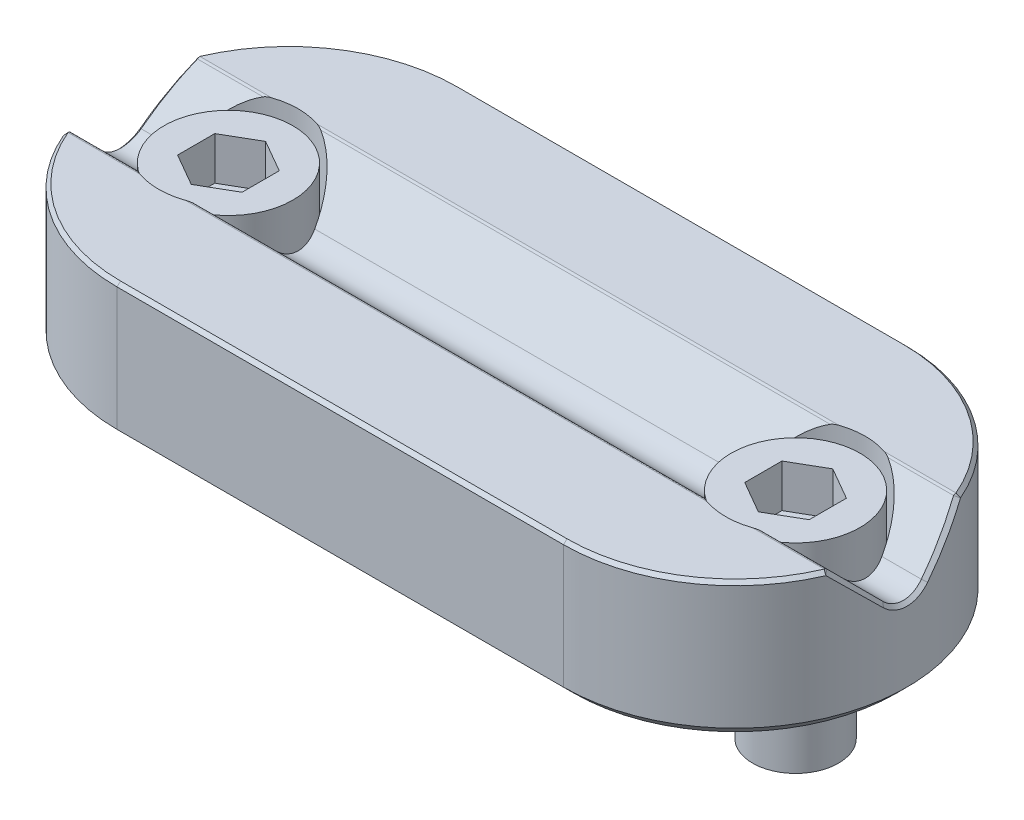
ISO-10303-21;
HEADER;
FILE_DESCRIPTION(('STEP AP214'),'2;1');
FILE_NAME('part.step','',(''),(''),'','','');
FILE_SCHEMA(('AUTOMOTIVE_DESIGN { 1 0 10303 214 1 1 1 1 }'));
ENDSEC;
DATA;
#1=APPLICATION_CONTEXT('core data for automotive mechanical design processes');
#2=APPLICATION_PROTOCOL_DEFINITION('international standard','automotive_design',2000,#1);
#3=PRODUCT_CONTEXT('',#1,'mechanical');
#4=PRODUCT('Part','Part','',(#3));
#5=PRODUCT_RELATED_PRODUCT_CATEGORY('part','',(#4));
#6=PRODUCT_DEFINITION_FORMATION('','',#4);
#7=PRODUCT_DEFINITION_CONTEXT('part definition',#1,'design');
#8=PRODUCT_DEFINITION('design','',#6,#7);
#9=PRODUCT_DEFINITION_SHAPE('','',#8);
#10=(LENGTH_UNIT() NAMED_UNIT(*) SI_UNIT(.MILLI.,.METRE.));
#11=(NAMED_UNIT(*) PLANE_ANGLE_UNIT() SI_UNIT($,.RADIAN.));
#12=(NAMED_UNIT(*) SI_UNIT($,.STERADIAN.) SOLID_ANGLE_UNIT());
#13=UNCERTAINTY_MEASURE_WITH_UNIT(LENGTH_MEASURE(1.E-05),#10,'distance_accuracy_value','');
#14=(GEOMETRIC_REPRESENTATION_CONTEXT(3) GLOBAL_UNCERTAINTY_ASSIGNED_CONTEXT((#13)) GLOBAL_UNIT_ASSIGNED_CONTEXT((#10,
#11,#12)) REPRESENTATION_CONTEXT('',''));
#15=CARTESIAN_POINT('',(0.,0.,0.));
#16=DIRECTION('',(0.,0.,1.));
#17=DIRECTION('',(1.,0.,0.));
#18=AXIS2_PLACEMENT_3D('',#15,#16,#17);
#19=CARTESIAN_POINT('',(20.955,-16.7894,0.));
#20=DIRECTION('',(0.,-1.,0.));
#21=DIRECTION('',(-1.,0.,0.));
#22=AXIS2_PLACEMENT_3D('',#19,#20,#21);
#23=PLANE('',#22);
#24=CARTESIAN_POINT('',(20.955,-16.7894,0.));
#25=DIRECTION('',(0.,1.,0.));
#26=DIRECTION('',(-1.,0.,0.));
#27=AXIS2_PLACEMENT_3D('',#24,#25,#26);
#28=CIRCLE('',#27,3.175);
#29=CARTESIAN_POINT('',(17.78,-16.7894,0.));
#30=VERTEX_POINT('',#29);
#31=EDGE_CURVE('E12',#30,#30,#28,.T.);
#32=ORIENTED_EDGE('',*,*,#31,.F.);
#33=EDGE_LOOP('',(#32));
#34=FACE_BOUND('',#33,.T.);
#35=ADVANCED_FACE('F47',(#34),#23,.T.);
#36=CARTESIAN_POINT('',(20.955,-16.7894,0.));
#37=DIRECTION('',(0.,-1.,0.));
#38=DIRECTION('',(-1.,0.,0.));
#39=AXIS2_PLACEMENT_3D('',#36,#37,#38);
#40=CYLINDRICAL_SURFACE('',#39,3.175);
#41=CARTESIAN_POINT('',(20.955,-7.2644,0.));
#42=DIRECTION('',(0.,1.,0.));
#43=DIRECTION('',(-1.,0.,0.));
#44=AXIS2_PLACEMENT_3D('',#41,#42,#43);
#45=CIRCLE('',#44,3.175);
#46=CARTESIAN_POINT('',(17.78,-7.2644,0.));
#47=VERTEX_POINT('',#46);
#48=EDGE_CURVE('E54',#47,#47,#45,.T.);
#49=ORIENTED_EDGE('',*,*,#48,.F.);
#50=EDGE_LOOP('',(#49));
#51=FACE_BOUND('',#50,.T.);
#52=ORIENTED_EDGE('',*,*,#31,.T.);
#53=EDGE_LOOP('',(#52));
#54=FACE_BOUND('',#53,.T.);
#55=ADVANCED_FACE('F146',(#51,#54),#40,.T.);
#56=CARTESIAN_POINT('',(20.955,-7.2644,-3.175));
#57=DIRECTION('',(0.,-1.,0.));
#58=DIRECTION('',(-1.,0.,0.));
#59=AXIS2_PLACEMENT_3D('',#56,#57,#58);
#60=PLANE('',#59);
#61=CARTESIAN_POINT('',(20.955,-7.2644,0.));
#62=DIRECTION('',(0.,1.,0.));
#63=DIRECTION('',(-1.,0.,0.));
#64=AXIS2_PLACEMENT_3D('',#61,#62,#63);
#65=CIRCLE('',#64,4.7625);
#66=CARTESIAN_POINT('',(16.1925,-7.2644,0.));
#67=VERTEX_POINT('',#66);
#68=EDGE_CURVE('E139',#67,#67,#65,.T.);
#69=ORIENTED_EDGE('',*,*,#68,.F.);
#70=EDGE_LOOP('',(#69));
#71=FACE_BOUND('',#70,.T.);
#72=ORIENTED_EDGE('',*,*,#48,.T.);
#73=EDGE_LOOP('',(#72));
#74=FACE_BOUND('',#73,.T.);
#75=ADVANCED_FACE('F144',(#71,#74),#60,.T.);
#76=CARTESIAN_POINT('',(20.955,-16.7894,0.));
#77=DIRECTION('',(0.,-1.,0.));
#78=DIRECTION('',(-1.,0.,0.));
#79=AXIS2_PLACEMENT_3D('',#76,#77,#78);
#80=CYLINDRICAL_SURFACE('',#79,4.7625);
#81=CARTESIAN_POINT('',(20.955,-0.914400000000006,0.));
#82=DIRECTION('',(0.,1.,0.));
#83=DIRECTION('',(-1.,0.,0.));
#84=AXIS2_PLACEMENT_3D('',#81,#82,#83);
#85=CIRCLE('',#84,4.7625);
#86=CARTESIAN_POINT('',(16.1925,-0.914400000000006,0.));
#87=VERTEX_POINT('',#86);
#88=EDGE_CURVE('E136',#87,#87,#85,.T.);
#89=ORIENTED_EDGE('',*,*,#88,.F.);
#90=EDGE_LOOP('',(#89));
#91=FACE_BOUND('',#90,.T.);
#92=ORIENTED_EDGE('',*,*,#68,.T.);
#93=EDGE_LOOP('',(#92));
#94=FACE_BOUND('',#93,.T.);
#95=ADVANCED_FACE('F164',(#91,#94),#80,.T.);
#96=CARTESIAN_POINT('',(20.955,-0.914400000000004,-4.7625));
#97=DIRECTION('',(0.,1.,0.));
#98=DIRECTION('',(1.,0.,0.));
#99=AXIS2_PLACEMENT_3D('',#96,#97,#98);
#100=PLANE('',#99);
#101=DIRECTION('',(-0.866025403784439,0.,-0.5));
#102=VECTOR('',#101,1.);
#103=CARTESIAN_POINT('',(20.955,-0.914400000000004,2.74963065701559));
#104=LINE('',#103,#102);
#105=CARTESIAN_POINT('',(20.955,-0.914400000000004,2.74963065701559));
#106=VERTEX_POINT('',#105);
#107=CARTESIAN_POINT('',(18.57375,-0.914400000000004,1.3748153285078));
#108=VERTEX_POINT('',#107);
#109=EDGE_CURVE('E262',#106,#108,#104,.T.);
#110=ORIENTED_EDGE('',*,*,#109,.T.);
#111=DIRECTION('',(0.,0.,-1.));
#112=VECTOR('',#111,1.);
#113=CARTESIAN_POINT('',(18.57375,-0.914400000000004,1.3748153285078));
#114=LINE('',#113,#112);
#115=CARTESIAN_POINT('',(18.57375,-0.914400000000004,-1.3748153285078));
#116=VERTEX_POINT('',#115);
#117=EDGE_CURVE('E256',#108,#116,#114,.T.);
#118=ORIENTED_EDGE('',*,*,#117,.T.);
#119=DIRECTION('',(0.866025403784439,0.,-0.5));
#120=VECTOR('',#119,1.);
#121=CARTESIAN_POINT('',(18.57375,-0.914400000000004,-1.3748153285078));
#122=LINE('',#121,#120);
#123=CARTESIAN_POINT('',(20.955,-0.914400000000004,-2.74963065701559));
#124=VERTEX_POINT('',#123);
#125=EDGE_CURVE('E261',#116,#124,#122,.T.);
#126=ORIENTED_EDGE('',*,*,#125,.T.);
#127=DIRECTION('',(0.866025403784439,0.,0.5));
#128=VECTOR('',#127,1.);
#129=CARTESIAN_POINT('',(20.955,-0.914400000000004,-2.74963065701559));
#130=LINE('',#129,#128);
#131=CARTESIAN_POINT('',(23.33625,-0.914400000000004,-1.3748153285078));
#132=VERTEX_POINT('',#131);
#133=EDGE_CURVE('E270',#124,#132,#130,.T.);
#134=ORIENTED_EDGE('',*,*,#133,.T.);
#135=DIRECTION('',(0.,0.,1.));
#136=VECTOR('',#135,1.);
#137=CARTESIAN_POINT('',(23.33625,-0.914400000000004,-1.3748153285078));
#138=LINE('',#137,#136);
#139=CARTESIAN_POINT('',(23.33625,-0.914400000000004,1.3748153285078));
#140=VERTEX_POINT('',#139);
#141=EDGE_CURVE('E125',#132,#140,#138,.T.);
#142=ORIENTED_EDGE('',*,*,#141,.T.);
#143=DIRECTION('',(-0.866025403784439,0.,0.5));
#144=VECTOR('',#143,1.);
#145=CARTESIAN_POINT('',(23.33625,-0.914400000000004,1.3748153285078));
#146=LINE('',#145,#144);
#147=EDGE_CURVE('E265',#140,#106,#146,.T.);
#148=ORIENTED_EDGE('',*,*,#147,.T.);
#149=EDGE_LOOP('',(#110,#118,#126,#134,#142,#148));
#150=FACE_BOUND('',#149,.T.);
#151=ORIENTED_EDGE('',*,*,#88,.T.);
#152=EDGE_LOOP('',(#151));
#153=FACE_BOUND('',#152,.T.);
#154=ADVANCED_FACE('F172',(#150,#153),#100,.T.);
#155=CARTESIAN_POINT('',(20.955,-4.0894,2.74963065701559));
#156=DIRECTION('',(-0.5,0.,0.866025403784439));
#157=DIRECTION('',(0.866025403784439,0.,0.5));
#158=AXIS2_PLACEMENT_3D('',#155,#156,#157);
#159=PLANE('',#158);
#160=ORIENTED_EDGE('',*,*,#109,.F.);
#161=DIRECTION('',(0.,1.,0.));
#162=VECTOR('',#161,1.);
#163=CARTESIAN_POINT('',(20.955,-4.0894,2.74963065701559));
#164=LINE('',#163,#162);
#165=CARTESIAN_POINT('',(20.955,-4.0894,2.74963065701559));
#166=VERTEX_POINT('',#165);
#167=EDGE_CURVE('E92',#166,#106,#164,.T.);
#168=ORIENTED_EDGE('',*,*,#167,.F.);
#169=DIRECTION('',(-0.866025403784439,0.,-0.5));
#170=VECTOR('',#169,1.);
#171=CARTESIAN_POINT('',(20.955,-4.0894,2.74963065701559));
#172=LINE('',#171,#170);
#173=CARTESIAN_POINT('',(18.57375,-4.0894,1.3748153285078));
#174=VERTEX_POINT('',#173);
#175=EDGE_CURVE('E273',#166,#174,#172,.T.);
#176=ORIENTED_EDGE('',*,*,#175,.T.);
#177=DIRECTION('',(0.,1.,0.));
#178=VECTOR('',#177,1.);
#179=CARTESIAN_POINT('',(18.57375,-4.0894,1.3748153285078));
#180=LINE('',#179,#178);
#181=EDGE_CURVE('E61',#174,#108,#180,.T.);
#182=ORIENTED_EDGE('',*,*,#181,.T.);
#183=EDGE_LOOP('',(#160,#168,#176,#182));
#184=FACE_BOUND('',#183,.T.);
#185=ADVANCED_FACE('F180',(#184),#159,.F.);
#186=CARTESIAN_POINT('',(23.33625,-4.0894,1.3748153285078));
#187=DIRECTION('',(0.5,0.,0.866025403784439));
#188=DIRECTION('',(0.866025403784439,0.,-0.5));
#189=AXIS2_PLACEMENT_3D('',#186,#187,#188);
#190=PLANE('',#189);
#191=ORIENTED_EDGE('',*,*,#147,.F.);
#192=DIRECTION('',(0.,1.,0.));
#193=VECTOR('',#192,1.);
#194=CARTESIAN_POINT('',(23.33625,-4.0894,1.3748153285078));
#195=LINE('',#194,#193);
#196=CARTESIAN_POINT('',(23.33625,-4.0894,1.3748153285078));
#197=VERTEX_POINT('',#196);
#198=EDGE_CURVE('E127',#197,#140,#195,.T.);
#199=ORIENTED_EDGE('',*,*,#198,.F.);
#200=DIRECTION('',(-0.866025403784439,0.,0.5));
#201=VECTOR('',#200,1.);
#202=CARTESIAN_POINT('',(23.33625,-4.0894,1.3748153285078));
#203=LINE('',#202,#201);
#204=EDGE_CURVE('E70',#197,#166,#203,.T.);
#205=ORIENTED_EDGE('',*,*,#204,.T.);
#206=ORIENTED_EDGE('',*,*,#167,.T.);
#207=EDGE_LOOP('',(#191,#199,#205,#206));
#208=FACE_BOUND('',#207,.T.);
#209=ADVANCED_FACE('F188',(#208),#190,.F.);
#210=CARTESIAN_POINT('',(23.33625,-4.0894,-1.3748153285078));
#211=DIRECTION('',(1.,0.,0.));
#212=DIRECTION('',(0.,0.,-1.));
#213=AXIS2_PLACEMENT_3D('',#210,#211,#212);
#214=PLANE('',#213);
#215=ORIENTED_EDGE('',*,*,#141,.F.);
#216=DIRECTION('',(0.,1.,0.));
#217=VECTOR('',#216,1.);
#218=CARTESIAN_POINT('',(23.33625,-4.0894,-1.3748153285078));
#219=LINE('',#218,#217);
#220=CARTESIAN_POINT('',(23.33625,-4.0894,-1.3748153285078));
#221=VERTEX_POINT('',#220);
#222=EDGE_CURVE('E114',#221,#132,#219,.T.);
#223=ORIENTED_EDGE('',*,*,#222,.F.);
#224=DIRECTION('',(0.,0.,1.));
#225=VECTOR('',#224,1.);
#226=CARTESIAN_POINT('',(23.33625,-4.0894,-1.3748153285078));
#227=LINE('',#226,#225);
#228=EDGE_CURVE('E117',#221,#197,#227,.T.);
#229=ORIENTED_EDGE('',*,*,#228,.T.);
#230=ORIENTED_EDGE('',*,*,#198,.T.);
#231=EDGE_LOOP('',(#215,#223,#229,#230));
#232=FACE_BOUND('',#231,.T.);
#233=ADVANCED_FACE('F123',(#232),#214,.F.);
#234=CARTESIAN_POINT('',(20.955,-4.0894,-2.74963065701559));
#235=DIRECTION('',(0.5,0.,-0.866025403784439));
#236=DIRECTION('',(-0.866025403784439,0.,-0.5));
#237=AXIS2_PLACEMENT_3D('',#234,#235,#236);
#238=PLANE('',#237);
#239=ORIENTED_EDGE('',*,*,#133,.F.);
#240=DIRECTION('',(0.,1.,0.));
#241=VECTOR('',#240,1.);
#242=CARTESIAN_POINT('',(20.955,-4.0894,-2.74963065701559));
#243=LINE('',#242,#241);
#244=CARTESIAN_POINT('',(20.955,-4.0894,-2.74963065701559));
#245=VERTEX_POINT('',#244);
#246=EDGE_CURVE('E116',#245,#124,#243,.T.);
#247=ORIENTED_EDGE('',*,*,#246,.F.);
#248=DIRECTION('',(0.866025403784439,0.,0.5));
#249=VECTOR('',#248,1.);
#250=CARTESIAN_POINT('',(20.955,-4.0894,-2.74963065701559));
#251=LINE('',#250,#249);
#252=EDGE_CURVE('E109',#245,#221,#251,.T.);
#253=ORIENTED_EDGE('',*,*,#252,.T.);
#254=ORIENTED_EDGE('',*,*,#222,.T.);
#255=EDGE_LOOP('',(#239,#247,#253,#254));
#256=FACE_BOUND('',#255,.T.);
#257=ADVANCED_FACE('F112',(#256),#238,.F.);
#258=CARTESIAN_POINT('',(18.57375,-4.0894,-1.3748153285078));
#259=DIRECTION('',(-0.5,0.,-0.866025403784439));
#260=DIRECTION('',(-0.866025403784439,0.,0.5));
#261=AXIS2_PLACEMENT_3D('',#258,#259,#260);
#262=PLANE('',#261);
#263=ORIENTED_EDGE('',*,*,#125,.F.);
#264=DIRECTION('',(0.,1.,0.));
#265=VECTOR('',#264,1.);
#266=CARTESIAN_POINT('',(18.57375,-4.0894,-1.3748153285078));
#267=LINE('',#266,#265);
#268=CARTESIAN_POINT('',(18.57375,-4.0894,-1.3748153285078));
#269=VERTEX_POINT('',#268);
#270=EDGE_CURVE('E130',#269,#116,#267,.T.);
#271=ORIENTED_EDGE('',*,*,#270,.F.);
#272=DIRECTION('',(0.866025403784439,0.,-0.5));
#273=VECTOR('',#272,1.);
#274=CARTESIAN_POINT('',(18.57375,-4.0894,-1.3748153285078));
#275=LINE('',#274,#273);
#276=EDGE_CURVE('E118',#269,#245,#275,.T.);
#277=ORIENTED_EDGE('',*,*,#276,.T.);
#278=ORIENTED_EDGE('',*,*,#246,.T.);
#279=EDGE_LOOP('',(#263,#271,#277,#278));
#280=FACE_BOUND('',#279,.T.);
#281=ADVANCED_FACE('F207',(#280),#262,.F.);
#282=CARTESIAN_POINT('',(18.57375,-4.0894,1.3748153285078));
#283=DIRECTION('',(-1.,0.,0.));
#284=DIRECTION('',(0.,1.,0.));
#285=AXIS2_PLACEMENT_3D('',#282,#283,#284);
#286=PLANE('',#285);
#287=ORIENTED_EDGE('',*,*,#117,.F.);
#288=ORIENTED_EDGE('',*,*,#181,.F.);
#289=DIRECTION('',(0.,0.,-1.));
#290=VECTOR('',#289,1.);
#291=CARTESIAN_POINT('',(18.57375,-4.0894,1.3748153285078));
#292=LINE('',#291,#290);
#293=EDGE_CURVE('E100',#174,#269,#292,.T.);
#294=ORIENTED_EDGE('',*,*,#293,.T.);
#295=ORIENTED_EDGE('',*,*,#270,.T.);
#296=EDGE_LOOP('',(#287,#288,#294,#295));
#297=FACE_BOUND('',#296,.T.);
#298=ADVANCED_FACE('F214',(#297),#286,.F.);
#299=CARTESIAN_POINT('',(18.57375,-4.0894,1.3748153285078));
#300=DIRECTION('',(0.,1.,0.));
#301=DIRECTION('',(1.,0.,0.));
#302=AXIS2_PLACEMENT_3D('',#299,#300,#301);
#303=PLANE('',#302);
#304=ORIENTED_EDGE('',*,*,#175,.F.);
#305=ORIENTED_EDGE('',*,*,#204,.F.);
#306=ORIENTED_EDGE('',*,*,#228,.F.);
#307=ORIENTED_EDGE('',*,*,#252,.F.);
#308=ORIENTED_EDGE('',*,*,#276,.F.);
#309=ORIENTED_EDGE('',*,*,#293,.F.);
#310=EDGE_LOOP('',(#304,#305,#306,#307,#308,#309));
#311=FACE_BOUND('',#310,.T.);
#312=ADVANCED_FACE('F120',(#311),#303,.T.);
#313=CLOSED_SHELL('',(#35,#55,#75,#95,#154,#185,#209,#233,#257,#281,#298,#312));
#314=MANIFOLD_SOLID_BREP('B2',#313);
#315=CARTESIAN_POINT('',(-20.955,-16.7894,0.));
#316=DIRECTION('',(0.,-1.,0.));
#317=DIRECTION('',(1.,0.,0.));
#318=AXIS2_PLACEMENT_3D('',#315,#316,#317);
#319=PLANE('',#318);
#320=CARTESIAN_POINT('',(-20.955,-16.7894,0.));
#321=DIRECTION('',(0.,-1.,0.));
#322=DIRECTION('',(1.,0.,0.));
#323=AXIS2_PLACEMENT_3D('',#320,#321,#322);
#324=CIRCLE('',#323,3.175);
#325=CARTESIAN_POINT('',(-17.78,-16.7894,0.));
#326=VERTEX_POINT('',#325);
#327=EDGE_CURVE('E45',#326,#326,#324,.T.);
#328=ORIENTED_EDGE('',*,*,#327,.T.);
#329=EDGE_LOOP('',(#328));
#330=FACE_BOUND('',#329,.T.);
#331=ADVANCED_FACE('F292',(#330),#319,.T.);
#332=CARTESIAN_POINT('',(-20.955,-16.7894,0.));
#333=DIRECTION('',(0.,-1.,0.));
#334=DIRECTION('',(1.,0.,0.));
#335=AXIS2_PLACEMENT_3D('',#332,#333,#334);
#336=CYLINDRICAL_SURFACE('',#335,3.175);
#337=CARTESIAN_POINT('',(-20.955,-7.2644,0.));
#338=DIRECTION('',(0.,-1.,0.));
#339=DIRECTION('',(1.,0.,0.));
#340=AXIS2_PLACEMENT_3D('',#337,#338,#339);
#341=CIRCLE('',#340,3.175);
#342=CARTESIAN_POINT('',(-17.78,-7.2644,0.));
#343=VERTEX_POINT('',#342);
#344=EDGE_CURVE('E299',#343,#343,#341,.T.);
#345=ORIENTED_EDGE('',*,*,#344,.T.);
#346=EDGE_LOOP('',(#345));
#347=FACE_BOUND('',#346,.T.);
#348=ORIENTED_EDGE('',*,*,#327,.F.);
#349=EDGE_LOOP('',(#348));
#350=FACE_BOUND('',#349,.T.);
#351=ADVANCED_FACE('F406',(#347,#350),#336,.T.);
#352=CARTESIAN_POINT('',(-20.955,-7.2644,-3.175));
#353=DIRECTION('',(0.,-1.,0.));
#354=DIRECTION('',(1.,0.,0.));
#355=AXIS2_PLACEMENT_3D('',#352,#353,#354);
#356=PLANE('',#355);
#357=CARTESIAN_POINT('',(-20.955,-7.2644,0.));
#358=DIRECTION('',(0.,-1.,0.));
#359=DIRECTION('',(1.,0.,0.));
#360=AXIS2_PLACEMENT_3D('',#357,#358,#359);
#361=CIRCLE('',#360,4.7625);
#362=CARTESIAN_POINT('',(-16.1925,-7.2644,0.));
#363=VERTEX_POINT('',#362);
#364=EDGE_CURVE('E401',#363,#363,#361,.T.);
#365=ORIENTED_EDGE('',*,*,#364,.T.);
#366=EDGE_LOOP('',(#365));
#367=FACE_BOUND('',#366,.T.);
#368=ORIENTED_EDGE('',*,*,#344,.F.);
#369=EDGE_LOOP('',(#368));
#370=FACE_BOUND('',#369,.T.);
#371=ADVANCED_FACE('F409',(#367,#370),#356,.T.);
#372=CARTESIAN_POINT('',(-20.955,-16.7894,0.));
#373=DIRECTION('',(0.,-1.,0.));
#374=DIRECTION('',(1.,0.,0.));
#375=AXIS2_PLACEMENT_3D('',#372,#373,#374);
#376=CYLINDRICAL_SURFACE('',#375,4.7625);
#377=CARTESIAN_POINT('',(-20.955,-0.914400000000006,0.));
#378=DIRECTION('',(0.,-1.,0.));
#379=DIRECTION('',(1.,0.,0.));
#380=AXIS2_PLACEMENT_3D('',#377,#378,#379);
#381=CIRCLE('',#380,4.7625);
#382=CARTESIAN_POINT('',(-16.1925,-0.914400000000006,0.));
#383=VERTEX_POINT('',#382);
#384=EDGE_CURVE('E393',#383,#383,#381,.T.);
#385=ORIENTED_EDGE('',*,*,#384,.T.);
#386=EDGE_LOOP('',(#385));
#387=FACE_BOUND('',#386,.T.);
#388=ORIENTED_EDGE('',*,*,#364,.F.);
#389=EDGE_LOOP('',(#388));
#390=FACE_BOUND('',#389,.T.);
#391=ADVANCED_FACE('F411',(#387,#390),#376,.T.);
#392=CARTESIAN_POINT('',(-20.955,-0.914400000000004,-4.7625));
#393=DIRECTION('',(0.,1.,0.));
#394=DIRECTION('',(-1.,0.,0.));
#395=AXIS2_PLACEMENT_3D('',#392,#393,#394);
#396=PLANE('',#395);
#397=DIRECTION('',(0.866025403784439,0.,-0.5));
#398=VECTOR('',#397,1.);
#399=CARTESIAN_POINT('',(-20.955,-0.914400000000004,2.74963065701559));
#400=LINE('',#399,#398);
#401=CARTESIAN_POINT('',(-20.955,-0.914400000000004,2.74963065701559));
#402=VERTEX_POINT('',#401);
#403=CARTESIAN_POINT('',(-18.57375,-0.914400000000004,1.3748153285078));
#404=VERTEX_POINT('',#403);
#405=EDGE_CURVE('E306',#402,#404,#400,.T.);
#406=ORIENTED_EDGE('',*,*,#405,.F.);
#407=DIRECTION('',(0.866025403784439,0.,0.5));
#408=VECTOR('',#407,1.);
#409=CARTESIAN_POINT('',(-23.33625,-0.914400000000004,1.3748153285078));
#410=LINE('',#409,#408);
#411=CARTESIAN_POINT('',(-23.33625,-0.914400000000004,1.3748153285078));
#412=VERTEX_POINT('',#411);
#413=EDGE_CURVE('E389',#412,#402,#410,.T.);
#414=ORIENTED_EDGE('',*,*,#413,.F.);
#415=DIRECTION('',(0.,0.,1.));
#416=VECTOR('',#415,1.);
#417=CARTESIAN_POINT('',(-23.33625,-0.914400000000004,-1.3748153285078));
#418=LINE('',#417,#416);
#419=CARTESIAN_POINT('',(-23.33625,-0.914400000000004,-1.3748153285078));
#420=VERTEX_POINT('',#419);
#421=EDGE_CURVE('E387',#420,#412,#418,.T.);
#422=ORIENTED_EDGE('',*,*,#421,.F.);
#423=DIRECTION('',(-0.866025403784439,0.,0.5));
#424=VECTOR('',#423,1.);
#425=CARTESIAN_POINT('',(-20.955,-0.914400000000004,-2.74963065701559));
#426=LINE('',#425,#424);
#427=CARTESIAN_POINT('',(-20.955,-0.914400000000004,-2.74963065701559));
#428=VERTEX_POINT('',#427);
#429=EDGE_CURVE('E354',#428,#420,#426,.T.);
#430=ORIENTED_EDGE('',*,*,#429,.F.);
#431=DIRECTION('',(-0.866025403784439,0.,-0.5));
#432=VECTOR('',#431,1.);
#433=CARTESIAN_POINT('',(-18.57375,-0.914400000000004,-1.3748153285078));
#434=LINE('',#433,#432);
#435=CARTESIAN_POINT('',(-18.57375,-0.914400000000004,-1.3748153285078));
#436=VERTEX_POINT('',#435);
#437=EDGE_CURVE('E383',#436,#428,#434,.T.);
#438=ORIENTED_EDGE('',*,*,#437,.F.);
#439=DIRECTION('',(0.,0.,-1.));
#440=VECTOR('',#439,1.);
#441=CARTESIAN_POINT('',(-18.57375,-0.914400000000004,1.3748153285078));
#442=LINE('',#441,#440);
#443=EDGE_CURVE('E380',#404,#436,#442,.T.);
#444=ORIENTED_EDGE('',*,*,#443,.F.);
#445=EDGE_LOOP('',(#406,#414,#422,#430,#438,#444));
#446=FACE_BOUND('',#445,.T.);
#447=ORIENTED_EDGE('',*,*,#384,.F.);
#448=EDGE_LOOP('',(#447));
#449=FACE_BOUND('',#448,.T.);
#450=ADVANCED_FACE('F418',(#446,#449),#396,.T.);
#451=CARTESIAN_POINT('',(-20.955,-4.0894,2.74963065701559));
#452=DIRECTION('',(0.5,0.,0.866025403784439));
#453=DIRECTION('',(-0.866025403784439,0.,0.5));
#454=AXIS2_PLACEMENT_3D('',#451,#452,#453);
#455=PLANE('',#454);
#456=ORIENTED_EDGE('',*,*,#405,.T.);
#457=DIRECTION('',(0.,1.,0.));
#458=VECTOR('',#457,1.);
#459=CARTESIAN_POINT('',(-18.57375,-4.0894,1.3748153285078));
#460=LINE('',#459,#458);
#461=CARTESIAN_POINT('',(-18.57375,-4.0894,1.3748153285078));
#462=VERTEX_POINT('',#461);
#463=EDGE_CURVE('E336',#462,#404,#460,.T.);
#464=ORIENTED_EDGE('',*,*,#463,.F.);
#465=DIRECTION('',(0.866025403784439,0.,-0.5));
#466=VECTOR('',#465,1.);
#467=CARTESIAN_POINT('',(-20.955,-4.0894,2.74963065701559));
#468=LINE('',#467,#466);
#469=CARTESIAN_POINT('',(-20.955,-4.0894,2.74963065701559));
#470=VERTEX_POINT('',#469);
#471=EDGE_CURVE('E391',#470,#462,#468,.T.);
#472=ORIENTED_EDGE('',*,*,#471,.F.);
#473=DIRECTION('',(0.,1.,0.));
#474=VECTOR('',#473,1.);
#475=CARTESIAN_POINT('',(-20.955,-4.0894,2.74963065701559));
#476=LINE('',#475,#474);
#477=EDGE_CURVE('E314',#470,#402,#476,.T.);
#478=ORIENTED_EDGE('',*,*,#477,.T.);
#479=EDGE_LOOP('',(#456,#464,#472,#478));
#480=FACE_BOUND('',#479,.T.);
#481=ADVANCED_FACE('F449',(#480),#455,.F.);
#482=CARTESIAN_POINT('',(-23.33625,-4.0894,1.3748153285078));
#483=DIRECTION('',(-0.5,0.,0.866025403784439));
#484=DIRECTION('',(-0.866025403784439,0.,-0.5));
#485=AXIS2_PLACEMENT_3D('',#482,#483,#484);
#486=PLANE('',#485);
#487=ORIENTED_EDGE('',*,*,#413,.T.);
#488=ORIENTED_EDGE('',*,*,#477,.F.);
#489=DIRECTION('',(0.866025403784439,0.,0.5));
#490=VECTOR('',#489,1.);
#491=CARTESIAN_POINT('',(-23.33625,-4.0894,1.3748153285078));
#492=LINE('',#491,#490);
#493=CARTESIAN_POINT('',(-23.33625,-4.0894,1.3748153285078));
#494=VERTEX_POINT('',#493);
#495=EDGE_CURVE('E366',#494,#470,#492,.T.);
#496=ORIENTED_EDGE('',*,*,#495,.F.);
#497=DIRECTION('',(0.,1.,0.));
#498=VECTOR('',#497,1.);
#499=CARTESIAN_POINT('',(-23.33625,-4.0894,1.3748153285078));
#500=LINE('',#499,#498);
#501=EDGE_CURVE('E358',#494,#412,#500,.T.);
#502=ORIENTED_EDGE('',*,*,#501,.T.);
#503=EDGE_LOOP('',(#487,#488,#496,#502));
#504=FACE_BOUND('',#503,.T.);
#505=ADVANCED_FACE('F459',(#504),#486,.F.);
#506=CARTESIAN_POINT('',(-23.33625,-4.0894,-1.3748153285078));
#507=DIRECTION('',(-1.,0.,0.));
#508=DIRECTION('',(0.,0.,-1.));
#509=AXIS2_PLACEMENT_3D('',#506,#507,#508);
#510=PLANE('',#509);
#511=ORIENTED_EDGE('',*,*,#421,.T.);
#512=ORIENTED_EDGE('',*,*,#501,.F.);
#513=DIRECTION('',(0.,0.,1.));
#514=VECTOR('',#513,1.);
#515=CARTESIAN_POINT('',(-23.33625,-4.0894,-1.3748153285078));
#516=LINE('',#515,#514);
#517=CARTESIAN_POINT('',(-23.33625,-4.0894,-1.3748153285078));
#518=VERTEX_POINT('',#517);
#519=EDGE_CURVE('E362',#518,#494,#516,.T.);
#520=ORIENTED_EDGE('',*,*,#519,.F.);
#521=DIRECTION('',(0.,1.,0.));
#522=VECTOR('',#521,1.);
#523=CARTESIAN_POINT('',(-23.33625,-4.0894,-1.3748153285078));
#524=LINE('',#523,#522);
#525=EDGE_CURVE('E347',#518,#420,#524,.T.);
#526=ORIENTED_EDGE('',*,*,#525,.T.);
#527=EDGE_LOOP('',(#511,#512,#520,#526));
#528=FACE_BOUND('',#527,.T.);
#529=ADVANCED_FACE('F363',(#528),#510,.F.);
#530=CARTESIAN_POINT('',(-20.955,-4.0894,-2.74963065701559));
#531=DIRECTION('',(-0.5,0.,-0.866025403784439));
#532=DIRECTION('',(0.866025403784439,0.,-0.5));
#533=AXIS2_PLACEMENT_3D('',#530,#531,#532);
#534=PLANE('',#533);
#535=ORIENTED_EDGE('',*,*,#429,.T.);
#536=ORIENTED_EDGE('',*,*,#525,.F.);
#537=DIRECTION('',(-0.866025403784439,0.,0.5));
#538=VECTOR('',#537,1.);
#539=CARTESIAN_POINT('',(-20.955,-4.0894,-2.74963065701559));
#540=LINE('',#539,#538);
#541=CARTESIAN_POINT('',(-20.955,-4.0894,-2.74963065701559));
#542=VERTEX_POINT('',#541);
#543=EDGE_CURVE('E351',#542,#518,#540,.T.);
#544=ORIENTED_EDGE('',*,*,#543,.F.);
#545=DIRECTION('',(0.,1.,0.));
#546=VECTOR('',#545,1.);
#547=CARTESIAN_POINT('',(-20.955,-4.0894,-2.74963065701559));
#548=LINE('',#547,#546);
#549=EDGE_CURVE('E359',#542,#428,#548,.T.);
#550=ORIENTED_EDGE('',*,*,#549,.T.);
#551=EDGE_LOOP('',(#535,#536,#544,#550));
#552=FACE_BOUND('',#551,.T.);
#553=ADVANCED_FACE('F349',(#552),#534,.F.);
#554=CARTESIAN_POINT('',(-18.57375,-4.0894,-1.3748153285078));
#555=DIRECTION('',(0.5,0.,-0.866025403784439));
#556=DIRECTION('',(0.866025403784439,0.,0.5));
#557=AXIS2_PLACEMENT_3D('',#554,#555,#556);
#558=PLANE('',#557);
#559=ORIENTED_EDGE('',*,*,#437,.T.);
#560=ORIENTED_EDGE('',*,*,#549,.F.);
#561=DIRECTION('',(-0.866025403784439,0.,-0.5));
#562=VECTOR('',#561,1.);
#563=CARTESIAN_POINT('',(-18.57375,-4.0894,-1.3748153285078));
#564=LINE('',#563,#562);
#565=CARTESIAN_POINT('',(-18.57375,-4.0894,-1.3748153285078));
#566=VERTEX_POINT('',#565);
#567=EDGE_CURVE('E372',#566,#542,#564,.T.);
#568=ORIENTED_EDGE('',*,*,#567,.F.);
#569=DIRECTION('',(0.,1.,0.));
#570=VECTOR('',#569,1.);
#571=CARTESIAN_POINT('',(-18.57375,-4.0894,-1.3748153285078));
#572=LINE('',#571,#570);
#573=EDGE_CURVE('E396',#566,#436,#572,.T.);
#574=ORIENTED_EDGE('',*,*,#573,.T.);
#575=EDGE_LOOP('',(#559,#560,#568,#574));
#576=FACE_BOUND('',#575,.T.);
#577=ADVANCED_FACE('F486',(#576),#558,.F.);
#578=CARTESIAN_POINT('',(-18.57375,-4.0894,1.3748153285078));
#579=DIRECTION('',(1.,0.,0.));
#580=DIRECTION('',(0.,1.,0.));
#581=AXIS2_PLACEMENT_3D('',#578,#579,#580);
#582=PLANE('',#581);
#583=ORIENTED_EDGE('',*,*,#443,.T.);
#584=ORIENTED_EDGE('',*,*,#573,.F.);
#585=DIRECTION('',(0.,0.,-1.));
#586=VECTOR('',#585,1.);
#587=CARTESIAN_POINT('',(-18.57375,-4.0894,1.3748153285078));
#588=LINE('',#587,#586);
#589=EDGE_CURVE('E374',#462,#566,#588,.T.);
#590=ORIENTED_EDGE('',*,*,#589,.F.);
#591=ORIENTED_EDGE('',*,*,#463,.T.);
#592=EDGE_LOOP('',(#583,#584,#590,#591));
#593=FACE_BOUND('',#592,.T.);
#594=ADVANCED_FACE('F495',(#593),#582,.F.);
#595=CARTESIAN_POINT('',(-18.57375,-4.0894,1.3748153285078));
#596=DIRECTION('',(0.,1.,0.));
#597=DIRECTION('',(-1.,0.,0.));
#598=AXIS2_PLACEMENT_3D('',#595,#596,#597);
#599=PLANE('',#598);
#600=ORIENTED_EDGE('',*,*,#471,.T.);
#601=ORIENTED_EDGE('',*,*,#589,.T.);
#602=ORIENTED_EDGE('',*,*,#567,.T.);
#603=ORIENTED_EDGE('',*,*,#543,.T.);
#604=ORIENTED_EDGE('',*,*,#519,.T.);
#605=ORIENTED_EDGE('',*,*,#495,.T.);
#606=EDGE_LOOP('',(#600,#601,#602,#603,#604,#605));
#607=FACE_BOUND('',#606,.T.);
#608=ADVANCED_FACE('F369',(#607),#599,.T.);
#609=CLOSED_SHELL('',(#331,#351,#371,#391,#450,#481,#505,#529,#553,#577,#594,#608));
#610=MANIFOLD_SOLID_BREP('B6',#609);
#611=CARTESIAN_POINT('',(16.4973,-0.0254000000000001,0.));
#612=DIRECTION('',(0.,1.,0.));
#613=DIRECTION('',(0.,0.,1.));
#614=AXIS2_PLACEMENT_3D('',#611,#612,#613);
#615=PLANE('',#614);
#616=DIRECTION('',(1.,0.,0.));
#617=VECTOR('',#616,1.);
#618=CARTESIAN_POINT('',(-28.2545200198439,-0.0254000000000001,4.87337117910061));
#619=LINE('',#618,#617);
#620=CARTESIAN_POINT('',(-22.6392362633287,-0.0254000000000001,4.87337117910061));
#621=VERTEX_POINT('',#620);
#622=CARTESIAN_POINT('',(-27.9357090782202,-0.0254000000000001,4.87337117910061));
#623=VERTEX_POINT('',#622);
#624=EDGE_CURVE('E1919',#621,#623,#619,.F.);
#625=ORIENTED_EDGE('',*,*,#624,.T.);
#626=CARTESIAN_POINT('',(-16.4973,-0.0254000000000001,0.));
#627=DIRECTION('',(0.,1.,0.));
#628=DIRECTION('',(0.,0.,1.));
#629=AXIS2_PLACEMENT_3D('',#626,#627,#628);
#630=CIRCLE('',#629,12.4333);
#631=CARTESIAN_POINT('',(-16.4973,-0.0254000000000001,12.4333));
#632=VERTEX_POINT('',#631);
#633=EDGE_CURVE('E1398',#623,#632,#630,.T.);
#634=ORIENTED_EDGE('',*,*,#633,.T.);
#635=DIRECTION('',(1.,0.,0.));
#636=VECTOR('',#635,1.);
#637=CARTESIAN_POINT('',(16.4973,-0.0254000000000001,12.4333));
#638=LINE('',#637,#636);
#639=CARTESIAN_POINT('',(16.4973,-0.0254000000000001,12.4333));
#640=VERTEX_POINT('',#639);
#641=EDGE_CURVE('E1400',#632,#640,#638,.T.);
#642=ORIENTED_EDGE('',*,*,#641,.T.);
#643=CARTESIAN_POINT('',(16.4973,-0.0254000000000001,0.));
#644=DIRECTION('',(0.,1.,0.));
#645=DIRECTION('',(0.,0.,1.));
#646=AXIS2_PLACEMENT_3D('',#643,#644,#645);
#647=CIRCLE('',#646,12.4333);
#648=CARTESIAN_POINT('',(27.9357090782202,-0.0254000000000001,4.87337117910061));
#649=VERTEX_POINT('',#648);
#650=EDGE_CURVE('E1391',#640,#649,#647,.T.);
#651=ORIENTED_EDGE('',*,*,#650,.T.);
#652=DIRECTION('',(1.,0.,0.));
#653=VECTOR('',#652,1.);
#654=CARTESIAN_POINT('',(22.9174066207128,-0.0254000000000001,4.87337117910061));
#655=LINE('',#654,#653);
#656=CARTESIAN_POINT('',(22.6392362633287,-0.0254000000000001,4.87337117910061));
#657=VERTEX_POINT('',#656);
#658=EDGE_CURVE('E1904',#649,#657,#655,.F.);
#659=ORIENTED_EDGE('',*,*,#658,.T.);
#660=CARTESIAN_POINT('',(20.955,-0.0254000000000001,0.));
#661=DIRECTION('',(0.,1.,0.));
#662=DIRECTION('',(0.,0.,1.));
#663=AXIS2_PLACEMENT_3D('',#660,#661,#662);
#664=CIRCLE('',#663,5.1562);
#665=CARTESIAN_POINT('',(19.2707637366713,-0.0254000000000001,4.87337117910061));
#666=VERTEX_POINT('',#665);
#667=EDGE_CURVE('E1535',#666,#657,#664,.T.);
#668=ORIENTED_EDGE('',*,*,#667,.F.);
#669=DIRECTION('',(1.,0.,0.));
#670=VECTOR('',#669,1.);
#671=CARTESIAN_POINT('',(-18.9925933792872,-0.0254000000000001,4.87337117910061));
#672=LINE('',#671,#670);
#673=CARTESIAN_POINT('',(-19.2707637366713,-0.0254000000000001,4.87337117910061));
#674=VERTEX_POINT('',#673);
#675=EDGE_CURVE('E1908',#666,#674,#672,.F.);
#676=ORIENTED_EDGE('',*,*,#675,.T.);
#677=CARTESIAN_POINT('',(-20.955,-0.0254000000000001,0.));
#678=DIRECTION('',(0.,1.,0.));
#679=DIRECTION('',(0.,0.,1.));
#680=AXIS2_PLACEMENT_3D('',#677,#678,#679);
#681=CIRCLE('',#680,5.1562);
#682=EDGE_CURVE('E1538',#621,#674,#681,.T.);
#683=ORIENTED_EDGE('',*,*,#682,.F.);
#684=EDGE_LOOP('',(#625,#634,#642,#651,#659,#668,#676,#683));
#685=FACE_BOUND('',#684,.T.);
#686=ADVANCED_FACE('F527',(#685),#615,.T.);
#687=CARTESIAN_POINT('',(-20.955,-0.0254000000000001,0.));
#688=DIRECTION('',(0.,-1.,0.));
#689=DIRECTION('',(0.,0.,-1.));
#690=AXIS2_PLACEMENT_3D('',#687,#688,#689);
#691=CYLINDRICAL_SURFACE('',#690,3.4036);
#692=CARTESIAN_POINT('',(-20.955,-10.16,0.));
#693=DIRECTION('',(0.,1.,0.));
#694=DIRECTION('',(0.,0.,1.));
#695=AXIS2_PLACEMENT_3D('',#692,#693,#694);
#696=CIRCLE('',#695,3.4036);
#697=CARTESIAN_POINT('',(-20.955,-10.16,3.4036));
#698=VERTEX_POINT('',#697);
#699=EDGE_CURVE('E1547',#698,#698,#696,.T.);
#700=ORIENTED_EDGE('',*,*,#699,.F.);
#701=EDGE_LOOP('',(#700));
#702=FACE_BOUND('',#701,.T.);
#703=CARTESIAN_POINT('',(-20.955,-7.2644,0.));
#704=DIRECTION('',(0.,1.,0.));
#705=DIRECTION('',(0.,0.,1.));
#706=AXIS2_PLACEMENT_3D('',#703,#704,#705);
#707=CIRCLE('',#706,3.4036);
#708=CARTESIAN_POINT('',(-20.955,-7.2644,3.4036));
#709=VERTEX_POINT('',#708);
#710=EDGE_CURVE('E1548',#709,#709,#707,.T.);
#711=ORIENTED_EDGE('',*,*,#710,.T.);
#712=EDGE_LOOP('',(#711));
#713=FACE_BOUND('',#712,.T.);
#714=ADVANCED_FACE('F1561',(#702,#713),#691,.F.);
#715=CARTESIAN_POINT('',(20.955,-0.0254000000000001,0.));
#716=DIRECTION('',(0.,-1.,0.));
#717=DIRECTION('',(0.,0.,-1.));
#718=AXIS2_PLACEMENT_3D('',#715,#716,#717);
#719=CYLINDRICAL_SURFACE('',#718,3.4036);
#720=CARTESIAN_POINT('',(20.955,-10.16,0.));
#721=DIRECTION('',(0.,1.,0.));
#722=DIRECTION('',(0.,0.,1.));
#723=AXIS2_PLACEMENT_3D('',#720,#721,#722);
#724=CIRCLE('',#723,3.4036);
#725=CARTESIAN_POINT('',(20.955,-10.16,3.40359999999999));
#726=VERTEX_POINT('',#725);
#727=EDGE_CURVE('E1544',#726,#726,#724,.T.);
#728=ORIENTED_EDGE('',*,*,#727,.F.);
#729=EDGE_LOOP('',(#728));
#730=FACE_BOUND('',#729,.T.);
#731=CARTESIAN_POINT('',(20.955,-7.2644,0.));
#732=DIRECTION('',(0.,1.,0.));
#733=DIRECTION('',(0.,0.,1.));
#734=AXIS2_PLACEMENT_3D('',#731,#732,#733);
#735=CIRCLE('',#734,3.4036);
#736=CARTESIAN_POINT('',(20.955,-7.2644,3.40359999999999));
#737=VERTEX_POINT('',#736);
#738=EDGE_CURVE('E1555',#737,#737,#735,.T.);
#739=ORIENTED_EDGE('',*,*,#738,.T.);
#740=EDGE_LOOP('',(#739));
#741=FACE_BOUND('',#740,.T.);
#742=ADVANCED_FACE('F1580',(#730,#741),#719,.F.);
#743=DIRECTION('',(-1.,0.,0.));
#744=VECTOR('',#743,1.);
#745=CARTESIAN_POINT('',(-16.4973,-0.0254000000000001,-12.4333));
#746=LINE('',#745,#744);
#747=CARTESIAN_POINT('',(16.4973,-0.0254000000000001,-12.4333));
#748=VERTEX_POINT('',#747);
#749=CARTESIAN_POINT('',(-16.4973,-0.0254000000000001,-12.4333));
#750=VERTEX_POINT('',#749);
#751=EDGE_CURVE('E547',#748,#750,#746,.T.);
#752=ORIENTED_EDGE('',*,*,#751,.T.);
#753=CARTESIAN_POINT('',(-16.4973,-0.0254000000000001,0.));
#754=DIRECTION('',(0.,1.,0.));
#755=DIRECTION('',(0.,0.,1.));
#756=AXIS2_PLACEMENT_3D('',#753,#754,#755);
#757=CIRCLE('',#756,12.4333);
#758=CARTESIAN_POINT('',(-27.9357090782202,-0.0254000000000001,-4.8733711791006));
#759=VERTEX_POINT('',#758);
#760=EDGE_CURVE('E960',#750,#759,#757,.T.);
#761=ORIENTED_EDGE('',*,*,#760,.T.);
#762=DIRECTION('',(1.,0.,0.));
#763=VECTOR('',#762,1.);
#764=CARTESIAN_POINT('',(-22.9174066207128,-0.0254000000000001,-4.8733711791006));
#765=LINE('',#764,#763);
#766=CARTESIAN_POINT('',(-22.6392362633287,-0.0254000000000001,-4.8733711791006));
#767=VERTEX_POINT('',#766);
#768=EDGE_CURVE('E1421',#759,#767,#765,.T.);
#769=ORIENTED_EDGE('',*,*,#768,.T.);
#770=CARTESIAN_POINT('',(-19.2707637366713,-0.0254000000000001,-4.8733711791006));
#771=VERTEX_POINT('',#770);
#772=EDGE_CURVE('E1526',#771,#767,#681,.T.);
#773=ORIENTED_EDGE('',*,*,#772,.F.);
#774=DIRECTION('',(1.,0.,0.));
#775=VECTOR('',#774,1.);
#776=CARTESIAN_POINT('',(18.9925933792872,-0.0254000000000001,-4.8733711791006));
#777=LINE('',#776,#775);
#778=CARTESIAN_POINT('',(19.2707637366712,-0.0254000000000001,-4.8733711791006));
#779=VERTEX_POINT('',#778);
#780=EDGE_CURVE('E1408',#771,#779,#777,.T.);
#781=ORIENTED_EDGE('',*,*,#780,.T.);
#782=CARTESIAN_POINT('',(22.6392362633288,-0.0254000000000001,-4.8733711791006));
#783=VERTEX_POINT('',#782);
#784=EDGE_CURVE('E1524',#783,#779,#664,.T.);
#785=ORIENTED_EDGE('',*,*,#784,.F.);
#786=DIRECTION('',(1.,0.,0.));
#787=VECTOR('',#786,1.);
#788=CARTESIAN_POINT('',(28.2545200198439,-0.0254000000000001,-4.8733711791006));
#789=LINE('',#788,#787);
#790=CARTESIAN_POINT('',(27.9357090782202,-0.0254000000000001,-4.8733711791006));
#791=VERTEX_POINT('',#790);
#792=EDGE_CURVE('E1427',#783,#791,#789,.T.);
#793=ORIENTED_EDGE('',*,*,#792,.T.);
#794=CARTESIAN_POINT('',(16.4973,-0.0254000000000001,0.));
#795=DIRECTION('',(0.,1.,0.));
#796=DIRECTION('',(0.,0.,1.));
#797=AXIS2_PLACEMENT_3D('',#794,#795,#796);
#798=CIRCLE('',#797,12.4333);
#799=EDGE_CURVE('E552',#791,#748,#798,.T.);
#800=ORIENTED_EDGE('',*,*,#799,.T.);
#801=EDGE_LOOP('',(#752,#761,#769,#773,#781,#785,#793,#800));
#802=FACE_BOUND('',#801,.T.);
#803=ADVANCED_FACE('F1523',(#802),#615,.T.);
#804=CARTESIAN_POINT('',(16.4973,-10.16,0.));
#805=DIRECTION('',(0.,1.,0.));
#806=DIRECTION('',(0.,0.,1.));
#807=AXIS2_PLACEMENT_3D('',#804,#805,#806);
#808=PLANE('',#807);
#809=CARTESIAN_POINT('',(-16.4973,-10.16,0.));
#810=DIRECTION('',(0.,1.,0.));
#811=DIRECTION('',(0.,0.,1.));
#812=AXIS2_PLACEMENT_3D('',#809,#810,#811);
#813=CIRCLE('',#812,11.9253);
#814=CARTESIAN_POINT('',(-16.4973,-10.16,11.9253));
#815=VERTEX_POINT('',#814);
#816=CARTESIAN_POINT('',(-16.4973,-10.16,-11.9253));
#817=VERTEX_POINT('',#816);
#818=EDGE_CURVE('E861',#815,#817,#813,.F.);
#819=ORIENTED_EDGE('',*,*,#818,.T.);
#820=DIRECTION('',(1.,0.,0.));
#821=VECTOR('',#820,1.);
#822=CARTESIAN_POINT('',(16.4973,-10.16,-11.9253));
#823=LINE('',#822,#821);
#824=CARTESIAN_POINT('',(16.4973,-10.16,-11.9253));
#825=VERTEX_POINT('',#824);
#826=EDGE_CURVE('E863',#817,#825,#823,.T.);
#827=ORIENTED_EDGE('',*,*,#826,.T.);
#828=CARTESIAN_POINT('',(16.4973,-10.16,0.));
#829=DIRECTION('',(0.,1.,0.));
#830=DIRECTION('',(0.,0.,1.));
#831=AXIS2_PLACEMENT_3D('',#828,#829,#830);
#832=CIRCLE('',#831,11.9253);
#833=CARTESIAN_POINT('',(16.4973,-10.16,11.9253));
#834=VERTEX_POINT('',#833);
#835=EDGE_CURVE('E859',#825,#834,#832,.F.);
#836=ORIENTED_EDGE('',*,*,#835,.T.);
#837=DIRECTION('',(-1.,0.,0.));
#838=VECTOR('',#837,1.);
#839=CARTESIAN_POINT('',(16.4973,-10.16,11.9253));
#840=LINE('',#839,#838);
#841=EDGE_CURVE('E857',#834,#815,#840,.T.);
#842=ORIENTED_EDGE('',*,*,#841,.T.);
#843=EDGE_LOOP('',(#819,#827,#836,#842));
#844=FACE_BOUND('',#843,.T.);
#845=ORIENTED_EDGE('',*,*,#699,.T.);
#846=EDGE_LOOP('',(#845));
#847=FACE_BOUND('',#846,.T.);
#848=ORIENTED_EDGE('',*,*,#727,.T.);
#849=EDGE_LOOP('',(#848));
#850=FACE_BOUND('',#849,.T.);
#851=ADVANCED_FACE('F1362',(#844,#847,#850),#808,.F.);
#852=CARTESIAN_POINT('',(16.4973,-0.0254000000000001,0.));
#853=DIRECTION('',(0.,-1.,0.));
#854=DIRECTION('',(0.,0.,-1.));
#855=AXIS2_PLACEMENT_3D('',#852,#853,#854);
#856=CYLINDRICAL_SURFACE('',#855,12.6873);
#857=CARTESIAN_POINT('',(28.1693844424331,-0.279400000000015,4.97292932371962));
#858=CARTESIAN_POINT('',(28.3963620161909,-0.801445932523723,4.44021851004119));
#859=CARTESIAN_POINT('',(28.5867864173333,-1.33874762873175,3.89194027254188));
#860=CARTESIAN_POINT('',(28.8910449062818,-2.43379590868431,2.77452124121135));
#861=CARTESIAN_POINT('',(29.004876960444,-2.99153517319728,2.20538791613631));
#862=CARTESIAN_POINT('',(29.0793093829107,-3.55428558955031,1.63114106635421));
#863=B_SPLINE_CURVE_WITH_KNOTS('',3,(#857,#858,#859,#860,#861,#862),.UNSPECIFIED.,.F.,.F.,(4,2,
4),(1.69971802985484,1.83663838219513,1.97355873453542),.UNSPECIFIED.);
#864=CARTESIAN_POINT('',(29.0793093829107,-3.55428558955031,1.63114106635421));
#865=VERTEX_POINT('',#864);
#866=CARTESIAN_POINT('',(28.1693844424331,-0.279400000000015,4.97292932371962));
#867=VERTEX_POINT('',#866);
#868=EDGE_CURVE('E1337',#865,#867,#863,.F.);
#869=ORIENTED_EDGE('',*,*,#868,.T.);
#870=CARTESIAN_POINT('',(16.4973,-0.27940000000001,0.));
#871=DIRECTION('',(0.,1.,0.));
#872=DIRECTION('',(0.,0.,1.));
#873=AXIS2_PLACEMENT_3D('',#870,#871,#872);
#874=CIRCLE('',#873,12.6873);
#875=CARTESIAN_POINT('',(16.4973,-0.27940000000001,12.6873));
#876=VERTEX_POINT('',#875);
#877=EDGE_CURVE('E1370',#867,#876,#874,.F.);
#878=ORIENTED_EDGE('',*,*,#877,.T.);
#879=DIRECTION('',(0.,-1.,0.));
#880=VECTOR('',#879,1.);
#881=CARTESIAN_POINT('',(16.4973,-0.0254000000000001,12.6873));
#882=LINE('',#881,#880);
#883=CARTESIAN_POINT('',(16.4973,-9.39800000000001,12.6873));
#884=VERTEX_POINT('',#883);
#885=EDGE_CURVE('E1551',#876,#884,#882,.T.);
#886=ORIENTED_EDGE('',*,*,#885,.T.);
#887=CARTESIAN_POINT('',(16.4973,-9.39800000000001,0.));
#888=DIRECTION('',(0.,1.,0.));
#889=DIRECTION('',(0.,0.,1.));
#890=AXIS2_PLACEMENT_3D('',#887,#888,#889);
#891=CIRCLE('',#890,12.6873);
#892=CARTESIAN_POINT('',(16.4973,-9.39800000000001,-12.6873));
#893=VERTEX_POINT('',#892);
#894=EDGE_CURVE('E869',#884,#893,#891,.T.);
#895=ORIENTED_EDGE('',*,*,#894,.T.);
#896=DIRECTION('',(0.,-1.,0.));
#897=VECTOR('',#896,1.);
#898=CARTESIAN_POINT('',(16.4973,-0.0254000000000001,-12.6873));
#899=LINE('',#898,#897);
#900=CARTESIAN_POINT('',(16.4973,-0.27940000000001,-12.6873));
#901=VERTEX_POINT('',#900);
#902=EDGE_CURVE('E755',#901,#893,#899,.T.);
#903=ORIENTED_EDGE('',*,*,#902,.F.);
#904=CARTESIAN_POINT('',(16.4973,-0.27940000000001,0.));
#905=DIRECTION('',(0.,1.,0.));
#906=DIRECTION('',(0.,0.,1.));
#907=AXIS2_PLACEMENT_3D('',#904,#905,#906);
#908=CIRCLE('',#907,12.6873);
#909=CARTESIAN_POINT('',(28.1693844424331,-0.27940000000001,-4.97292932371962));
#910=VERTEX_POINT('',#909);
#911=EDGE_CURVE('E1336',#901,#910,#908,.F.);
#912=ORIENTED_EDGE('',*,*,#911,.T.);
#913=CARTESIAN_POINT('',(29.0793093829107,-3.55428558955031,-1.63114106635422));
#914=CARTESIAN_POINT('',(29.004876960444,-2.99153517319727,-2.20538791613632));
#915=CARTESIAN_POINT('',(28.8910449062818,-2.4337959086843,-2.77452124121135));
#916=CARTESIAN_POINT('',(28.5867864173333,-1.33874762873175,-3.89194027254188));
#917=CARTESIAN_POINT('',(28.3963620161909,-0.801445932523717,-4.4402185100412));
#918=CARTESIAN_POINT('',(28.1693844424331,-0.279400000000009,-4.97292932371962));
#919=B_SPLINE_CURVE_WITH_KNOTS('',3,(#913,#914,#915,#916,#917,#918),.UNSPECIFIED.,.F.,.F.,(4,2,
4),(4.30962657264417,4.44654692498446,4.58346727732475),.UNSPECIFIED.);
#920=CARTESIAN_POINT('',(29.0793093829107,-3.55428558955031,-1.63114106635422));
#921=VERTEX_POINT('',#920);
#922=EDGE_CURVE('E1333',#910,#921,#919,.F.);
#923=ORIENTED_EDGE('',*,*,#922,.T.);
#924=CARTESIAN_POINT('',(29.0793093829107,-3.55428558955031,1.63114106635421));
#925=CARTESIAN_POINT('',(29.0862754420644,-3.60694128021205,1.57740678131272));
#926=CARTESIAN_POINT('',(29.0931957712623,-3.65670702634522,1.52133054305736));
#927=CARTESIAN_POINT('',(29.1067505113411,-3.7505689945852,1.40456144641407));
#928=CARTESIAN_POINT('',(29.1133851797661,-3.79466477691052,1.34386645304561));
#929=CARTESIAN_POINT('',(29.1213802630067,-3.84621477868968,1.26508210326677));
#930=CARTESIAN_POINT('',(29.12296420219,-3.85634431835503,1.24917756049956));
#931=CARTESIAN_POINT('',(29.1260994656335,-3.87624517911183,1.21707263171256));
#932=CARTESIAN_POINT('',(29.1276508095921,-3.88601618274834,1.20086961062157));
#933=CARTESIAN_POINT('',(29.1322301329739,-3.91465473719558,1.1520370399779));
#934=CARTESIAN_POINT('',(29.1351900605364,-3.93289187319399,1.11912088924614));
#935=CARTESIAN_POINT('',(29.1409068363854,-3.96768766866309,1.05256965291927));
#936=CARTESIAN_POINT('',(29.1436636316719,-3.98424604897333,1.01893593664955));
#937=CARTESIAN_POINT('',(29.148956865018,-4.01570138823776,0.950958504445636));
#938=CARTESIAN_POINT('',(29.1514933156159,-4.0305983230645,0.916614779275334));
#939=CARTESIAN_POINT('',(29.156328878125,-4.05873599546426,0.847218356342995));
#940=CARTESIAN_POINT('',(29.1586280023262,-4.07197673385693,0.812165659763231));
#941=CARTESIAN_POINT('',(29.1629718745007,-4.09679515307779,0.7413472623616));
#942=CARTESIAN_POINT('',(29.1650166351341,-4.10837285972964,0.705581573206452));
#943=CARTESIAN_POINT('',(29.1688344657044,-4.12984603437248,0.633327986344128));
#944=CARTESIAN_POINT('',(29.1706076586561,-4.13974212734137,0.596833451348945));
#945=CARTESIAN_POINT('',(29.1738640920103,-4.1578175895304,0.523134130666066));
#946=CARTESIAN_POINT('',(29.1753497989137,-4.16601026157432,0.485826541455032));
#947=CARTESIAN_POINT('',(29.1779837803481,-4.18047427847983,0.4113670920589));
#948=CARTESIAN_POINT('',(29.17913993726,-4.18678950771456,0.374050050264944));
#949=CARTESIAN_POINT('',(29.1811232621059,-4.19759133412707,0.299341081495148));
#950=CARTESIAN_POINT('',(29.181951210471,-4.20208215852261,0.261932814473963));
#951=CARTESIAN_POINT('',(29.1839398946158,-4.21285056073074,0.149548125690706));
#952=CARTESIAN_POINT('',(29.1846055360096,-4.21642994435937,0.0744121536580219));
#953=CARTESIAN_POINT('',(29.1845971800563,-4.21638474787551,-0.0386120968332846));
#954=CARTESIAN_POINT('',(29.1844265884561,-4.2154658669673,-0.0763403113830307));
#955=CARTESIAN_POINT('',(29.1837468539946,-4.2117978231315,-0.151904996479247));
#956=CARTESIAN_POINT('',(29.1832377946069,-4.20904920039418,-0.189732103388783));
#957=CARTESIAN_POINT('',(29.1822177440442,-4.20352517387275,-0.246583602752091));
#958=CARTESIAN_POINT('',(29.181834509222,-4.20144761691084,-0.265561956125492));
#959=CARTESIAN_POINT('',(29.1809873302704,-4.19684745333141,-0.303336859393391));
#960=CARTESIAN_POINT('',(29.1805228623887,-4.19432201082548,-0.322167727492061));
#961=CARTESIAN_POINT('',(29.1790105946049,-4.18608352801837,-0.378421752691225));
#962=CARTESIAN_POINT('',(29.1778426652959,-4.17970177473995,-0.415680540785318));
#963=CARTESIAN_POINT('',(29.173882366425,-4.15794689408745,-0.526603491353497));
#964=CARTESIAN_POINT('',(29.1706315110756,-4.13995904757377,-0.599524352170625));
#965=CARTESIAN_POINT('',(29.1649184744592,-4.1078178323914,-0.707332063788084));
#966=CARTESIAN_POINT('',(29.1628745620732,-4.09624240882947,-0.743008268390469));
#967=CARTESIAN_POINT('',(29.1585205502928,-4.07135941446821,-0.813839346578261));
#968=CARTESIAN_POINT('',(29.156210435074,-4.05805191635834,-0.848994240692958));
#969=CARTESIAN_POINT('',(29.1513370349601,-4.02968351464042,-0.918777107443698));
#970=CARTESIAN_POINT('',(29.1487753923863,-4.01463241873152,-0.953383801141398));
#971=CARTESIAN_POINT('',(29.1434056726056,-3.98270285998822,-1.02214585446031));
#972=CARTESIAN_POINT('',(29.1406157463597,-3.96593133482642,-1.05606690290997));
#973=CARTESIAN_POINT('',(29.132001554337,-3.91345132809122,-1.15600504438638));
#974=CARTESIAN_POINT('',(29.125915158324,-3.87548094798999,-1.22048539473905));
#975=CARTESIAN_POINT('',(29.1132460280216,-3.793740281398,-1.34514428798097));
#976=CARTESIAN_POINT('',(29.1066618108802,-3.74996456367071,-1.40534421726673));
#977=CARTESIAN_POINT('',(29.0931766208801,-3.65656455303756,-1.52147671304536));
#978=CARTESIAN_POINT('',(29.0862752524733,-3.6069393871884,-1.57740860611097));
#979=CARTESIAN_POINT('',(29.0793093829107,-3.55428558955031,-1.63114106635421));
#980=B_SPLINE_CURVE_WITH_KNOTS('',3,(#924,#925,#926,#927,#928,#929,#930,#931,#932,#933,#934,
#935,#936,#937,#938,#939,#940,#941,#942,#943,#944,#945,#946,#947,#948,#949,#950,#951,#952,#953,
#954,#955,#956,#957,#958,#959,#960,#961,#962,#963,#964,#965,#966,#967,#968,#969,#970,#971,#972,
#973,#974,#975,#976,#977,#978,#979),.UNSPECIFIED.,.F.,.F.,(4,2,2,2,2,2,2,2,2,2,2,2,2,2,2,2,2,2,
2,2,2,2,2,2,2,2,2,4),(0.,0.000221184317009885,0.000442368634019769,0.00049766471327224,
0.000552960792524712,0.000663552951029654,0.000774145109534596,0.000884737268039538,
0.00099532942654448,0.00110592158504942,0.00121651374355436,0.00132710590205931,
0.00143769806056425,0.00154829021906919,0.00176947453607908,0.00188006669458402,
0.00199065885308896,0.00204595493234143,0.0021012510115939,0.00221184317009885,
0.00243302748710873,0.00254361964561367,0.00265421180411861,0.00276480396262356,
0.0028753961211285,0.00309658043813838,0.00331776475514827,0.00353894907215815),.UNSPECIFIED.);
#981=EDGE_CURVE('E1264',#921,#865,#980,.F.);
#982=ORIENTED_EDGE('',*,*,#981,.T.);
#983=EDGE_LOOP('',(#869,#878,#886,#895,#903,#912,#923,#982));
#984=FACE_BOUND('',#983,.T.);
#985=ADVANCED_FACE('F1353',(#984),#856,.T.);
#986=CARTESIAN_POINT('',(-16.4973,-0.0254000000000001,-12.6873));
#987=DIRECTION('',(0.,0.,1.));
#988=DIRECTION('',(1.,0.,0.));
#989=AXIS2_PLACEMENT_3D('',#986,#987,#988);
#990=PLANE('',#989);
#991=DIRECTION('',(0.,-1.,0.));
#992=VECTOR('',#991,1.);
#993=CARTESIAN_POINT('',(-16.4973,-0.0254000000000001,-12.6873));
#994=LINE('',#993,#992);
#995=CARTESIAN_POINT('',(-16.4973,-0.27940000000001,-12.6873));
#996=VERTEX_POINT('',#995);
#997=CARTESIAN_POINT('',(-16.4973,-9.39800000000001,-12.6873));
#998=VERTEX_POINT('',#997);
#999=EDGE_CURVE('E940',#996,#998,#994,.T.);
#1000=ORIENTED_EDGE('',*,*,#999,.F.);
#1001=DIRECTION('',(1.,0.,0.));
#1002=VECTOR('',#1001,1.);
#1003=CARTESIAN_POINT('',(16.4973,-0.27940000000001,-12.6873));
#1004=LINE('',#1003,#1002);
#1005=EDGE_CURVE('E540',#996,#901,#1004,.T.);
#1006=ORIENTED_EDGE('',*,*,#1005,.T.);
#1007=ORIENTED_EDGE('',*,*,#902,.T.);
#1008=DIRECTION('',(-1.,0.,0.));
#1009=VECTOR('',#1008,1.);
#1010=CARTESIAN_POINT('',(-16.4973,-9.39800000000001,-12.6873));
#1011=LINE('',#1010,#1009);
#1012=EDGE_CURVE('E854',#893,#998,#1011,.T.);
#1013=ORIENTED_EDGE('',*,*,#1012,.T.);
#1014=EDGE_LOOP('',(#1000,#1006,#1007,#1013));
#1015=FACE_BOUND('',#1014,.T.);
#1016=ADVANCED_FACE('F908',(#1015),#990,.F.);
#1017=CARTESIAN_POINT('',(-16.4973,-0.0254000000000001,0.));
#1018=DIRECTION('',(0.,-1.,0.));
#1019=DIRECTION('',(0.,0.,-1.));
#1020=AXIS2_PLACEMENT_3D('',#1017,#1018,#1019);
#1021=CYLINDRICAL_SURFACE('',#1020,12.6873);
#1022=DIRECTION('',(0.,-1.,0.));
#1023=VECTOR('',#1022,1.);
#1024=CARTESIAN_POINT('',(-16.4973,-0.0254000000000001,12.6873));
#1025=LINE('',#1024,#1023);
#1026=CARTESIAN_POINT('',(-16.4973,-0.27940000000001,12.6873));
#1027=VERTEX_POINT('',#1026);
#1028=CARTESIAN_POINT('',(-16.4973,-9.39800000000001,12.6873));
#1029=VERTEX_POINT('',#1028);
#1030=EDGE_CURVE('E949',#1027,#1029,#1025,.T.);
#1031=ORIENTED_EDGE('',*,*,#1030,.F.);
#1032=CARTESIAN_POINT('',(-16.4973,-0.27940000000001,0.));
#1033=DIRECTION('',(0.,1.,0.));
#1034=DIRECTION('',(0.,0.,1.));
#1035=AXIS2_PLACEMENT_3D('',#1032,#1033,#1034);
#1036=CIRCLE('',#1035,12.6873);
#1037=CARTESIAN_POINT('',(-28.1693844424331,-0.279399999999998,4.97292932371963));
#1038=VERTEX_POINT('',#1037);
#1039=EDGE_CURVE('E934',#1027,#1038,#1036,.F.);
#1040=ORIENTED_EDGE('',*,*,#1039,.T.);
#1041=CARTESIAN_POINT('',(-29.0793093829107,-3.55428558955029,1.63114106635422));
#1042=CARTESIAN_POINT('',(-29.004876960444,-2.99153517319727,2.20538791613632));
#1043=CARTESIAN_POINT('',(-28.8910449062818,-2.43379590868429,2.77452124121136));
#1044=CARTESIAN_POINT('',(-28.5867864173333,-1.33874762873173,3.8919402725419));
#1045=CARTESIAN_POINT('',(-28.3963620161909,-0.801445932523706,4.4402185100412));
#1046=CARTESIAN_POINT('',(-28.1693844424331,-0.279399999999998,4.97292932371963));
#1047=B_SPLINE_CURVE_WITH_KNOTS('',3,(#1041,#1042,#1043,#1044,#1045,#1046),.UNSPECIFIED.,.F.,
.F.,(4,2,4),(4.30962657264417,4.44654692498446,4.58346727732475),.UNSPECIFIED.);
#1048=CARTESIAN_POINT('',(-29.0793093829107,-3.55428558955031,1.63114106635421));
#1049=VERTEX_POINT('',#1048);
#1050=EDGE_CURVE('E929',#1038,#1049,#1047,.F.);
#1051=ORIENTED_EDGE('',*,*,#1050,.T.);
#1052=CARTESIAN_POINT('',(-29.0793093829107,-3.55428558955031,-1.63114106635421));
#1053=CARTESIAN_POINT('',(-29.0862754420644,-3.60694128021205,-1.5774067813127));
#1054=CARTESIAN_POINT('',(-29.0931957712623,-3.65670702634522,-1.52133054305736));
#1055=CARTESIAN_POINT('',(-29.1067505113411,-3.7505689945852,-1.40456144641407));
#1056=CARTESIAN_POINT('',(-29.1133851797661,-3.79466477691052,-1.34386645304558));
#1057=CARTESIAN_POINT('',(-29.1213802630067,-3.84621477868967,-1.26508210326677));
#1058=CARTESIAN_POINT('',(-29.12296420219,-3.85634431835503,-1.24917756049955));
#1059=CARTESIAN_POINT('',(-29.1260994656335,-3.87624517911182,-1.21707263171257));
#1060=CARTESIAN_POINT('',(-29.1276508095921,-3.88601618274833,-1.20086961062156));
#1061=CARTESIAN_POINT('',(-29.132230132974,-3.91465473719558,-1.15203703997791));
#1062=CARTESIAN_POINT('',(-29.1351900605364,-3.93289187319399,-1.11912088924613));
#1063=CARTESIAN_POINT('',(-29.1409068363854,-3.96768766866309,-1.05256965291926));
#1064=CARTESIAN_POINT('',(-29.1436636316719,-3.98424604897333,-1.01893593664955));
#1065=CARTESIAN_POINT('',(-29.148956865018,-4.01570138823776,-0.950958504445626));
#1066=CARTESIAN_POINT('',(-29.1514933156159,-4.0305983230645,-0.916614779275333));
#1067=CARTESIAN_POINT('',(-29.156328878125,-4.05873599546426,-0.847218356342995));
#1068=CARTESIAN_POINT('',(-29.1586280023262,-4.07197673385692,-0.812165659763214));
#1069=CARTESIAN_POINT('',(-29.1629718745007,-4.09679515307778,-0.7413472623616));
#1070=CARTESIAN_POINT('',(-29.1650166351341,-4.10837285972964,-0.705581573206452));
#1071=CARTESIAN_POINT('',(-29.1688344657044,-4.12984603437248,-0.633327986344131));
#1072=CARTESIAN_POINT('',(-29.1706076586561,-4.13974212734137,-0.596833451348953));
#1073=CARTESIAN_POINT('',(-29.1738640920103,-4.1578175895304,-0.523134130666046));
#1074=CARTESIAN_POINT('',(-29.1753497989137,-4.16601026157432,-0.485826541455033));
#1075=CARTESIAN_POINT('',(-29.1779837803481,-4.18047427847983,-0.411367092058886));
#1076=CARTESIAN_POINT('',(-29.17913993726,-4.18678950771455,-0.374050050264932));
#1077=CARTESIAN_POINT('',(-29.181123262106,-4.19759133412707,-0.299341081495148));
#1078=CARTESIAN_POINT('',(-29.181951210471,-4.20208215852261,-0.261932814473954));
#1079=CARTESIAN_POINT('',(-29.1839398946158,-4.21285056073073,-0.149548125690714));
#1080=CARTESIAN_POINT('',(-29.1846055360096,-4.21642994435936,-0.07441215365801));
#1081=CARTESIAN_POINT('',(-29.1845971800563,-4.2163847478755,0.0386120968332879));
#1082=CARTESIAN_POINT('',(-29.1844265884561,-4.21546586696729,0.0763403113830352));
#1083=CARTESIAN_POINT('',(-29.1837468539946,-4.2117978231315,0.151904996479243));
#1084=CARTESIAN_POINT('',(-29.1832377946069,-4.20904920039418,0.18973210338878));
#1085=CARTESIAN_POINT('',(-29.1822177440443,-4.20352517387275,0.246583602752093));
#1086=CARTESIAN_POINT('',(-29.181834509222,-4.20144761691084,0.265561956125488));
#1087=CARTESIAN_POINT('',(-29.1809873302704,-4.19684745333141,0.303336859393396));
#1088=CARTESIAN_POINT('',(-29.1805228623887,-4.19432201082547,0.322167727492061));
#1089=CARTESIAN_POINT('',(-29.1790105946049,-4.18608352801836,0.378421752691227));
#1090=CARTESIAN_POINT('',(-29.1778426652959,-4.17970177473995,0.415680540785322));
#1091=CARTESIAN_POINT('',(-29.1738823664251,-4.15794689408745,0.526603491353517));
#1092=CARTESIAN_POINT('',(-29.1706315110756,-4.13995904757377,0.599524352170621));
#1093=CARTESIAN_POINT('',(-29.1649184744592,-4.1078178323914,0.707332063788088));
#1094=CARTESIAN_POINT('',(-29.1628745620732,-4.09624240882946,0.743008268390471));
#1095=CARTESIAN_POINT('',(-29.1585205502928,-4.0713594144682,0.813839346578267));
#1096=CARTESIAN_POINT('',(-29.156210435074,-4.05805191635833,0.848994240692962));
#1097=CARTESIAN_POINT('',(-29.1513370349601,-4.02968351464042,0.918777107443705));
#1098=CARTESIAN_POINT('',(-29.1487753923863,-4.01463241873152,0.9533838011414));
#1099=CARTESIAN_POINT('',(-29.1434056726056,-3.98270285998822,1.02214585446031));
#1100=CARTESIAN_POINT('',(-29.1406157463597,-3.96593133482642,1.05606690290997));
#1101=CARTESIAN_POINT('',(-29.132001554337,-3.91345132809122,1.15600504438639));
#1102=CARTESIAN_POINT('',(-29.125915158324,-3.87548094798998,1.22048539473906));
#1103=CARTESIAN_POINT('',(-29.1132460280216,-3.793740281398,1.34514428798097));
#1104=CARTESIAN_POINT('',(-29.1066618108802,-3.74996456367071,1.40534421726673));
#1105=CARTESIAN_POINT('',(-29.0931766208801,-3.65656455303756,1.52147671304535));
#1106=CARTESIAN_POINT('',(-29.0862752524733,-3.60693938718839,1.57740860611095));
#1107=CARTESIAN_POINT('',(-29.0793093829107,-3.55428558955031,1.63114106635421));
#1108=B_SPLINE_CURVE_WITH_KNOTS('',3,(#1052,#1053,#1054,#1055,#1056,#1057,#1058,#1059,#1060,
#1061,#1062,#1063,#1064,#1065,#1066,#1067,#1068,#1069,#1070,#1071,#1072,#1073,#1074,#1075,#1076,
#1077,#1078,#1079,#1080,#1081,#1082,#1083,#1084,#1085,#1086,#1087,#1088,#1089,#1090,#1091,#1092,
#1093,#1094,#1095,#1096,#1097,#1098,#1099,#1100,#1101,#1102,#1103,#1104,#1105,#1106,#1107),
.UNSPECIFIED.,.F.,.F.,(4,2,2,2,2,2,2,2,2,2,2,2,2,2,2,2,2,2,2,2,2,2,2,2,2,2,2,4),(0.,
0.000221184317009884,0.000442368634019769,0.00049766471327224,0.000552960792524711,
0.000663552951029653,0.000774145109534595,0.000884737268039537,0.00099532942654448,
0.00110592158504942,0.00121651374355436,0.00132710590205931,0.00143769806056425,
0.00154829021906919,0.00176947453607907,0.00188006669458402,0.00199065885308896,
0.00204595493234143,0.0021012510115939,0.00221184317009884,0.00243302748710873,
0.00254361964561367,0.00265421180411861,0.00276480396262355,0.0028753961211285,
0.00309658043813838,0.00331776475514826,0.00353894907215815),.UNSPECIFIED.);
#1109=CARTESIAN_POINT('',(-29.0793093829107,-3.55428558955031,-1.63114106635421));
#1110=VERTEX_POINT('',#1109);
#1111=EDGE_CURVE('E932',#1049,#1110,#1108,.F.);
#1112=ORIENTED_EDGE('',*,*,#1111,.T.);
#1113=CARTESIAN_POINT('',(-28.1693844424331,-0.279400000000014,-4.97292932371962));
#1114=CARTESIAN_POINT('',(-28.3963620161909,-0.80144593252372,-4.44021851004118));
#1115=CARTESIAN_POINT('',(-28.5867864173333,-1.33874762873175,-3.89194027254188));
#1116=CARTESIAN_POINT('',(-28.8910449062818,-2.4337959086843,-2.77452124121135));
#1117=CARTESIAN_POINT('',(-29.004876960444,-2.99153517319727,-2.2053879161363));
#1118=CARTESIAN_POINT('',(-29.0793093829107,-3.55428558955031,-1.63114106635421));
#1119=B_SPLINE_CURVE_WITH_KNOTS('',3,(#1113,#1114,#1115,#1116,#1117,#1118),.UNSPECIFIED.,.F.,
.F.,(4,2,4),(1.69971802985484,1.83663838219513,1.97355873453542),.UNSPECIFIED.);
#1120=CARTESIAN_POINT('',(-28.1693844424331,-0.27940000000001,-4.97292932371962));
#1121=VERTEX_POINT('',#1120);
#1122=EDGE_CURVE('E890',#1110,#1121,#1119,.F.);
#1123=ORIENTED_EDGE('',*,*,#1122,.T.);
#1124=CARTESIAN_POINT('',(-16.4973,-0.27940000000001,0.));
#1125=DIRECTION('',(0.,1.,0.));
#1126=DIRECTION('',(0.,0.,1.));
#1127=AXIS2_PLACEMENT_3D('',#1124,#1125,#1126);
#1128=CIRCLE('',#1127,12.6873);
#1129=EDGE_CURVE('E875',#1121,#996,#1128,.F.);
#1130=ORIENTED_EDGE('',*,*,#1129,.T.);
#1131=ORIENTED_EDGE('',*,*,#999,.T.);
#1132=CARTESIAN_POINT('',(-16.4973,-9.39800000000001,0.));
#1133=DIRECTION('',(0.,1.,0.));
#1134=DIRECTION('',(0.,0.,1.));
#1135=AXIS2_PLACEMENT_3D('',#1132,#1133,#1134);
#1136=CIRCLE('',#1135,12.6873);
#1137=EDGE_CURVE('E866',#998,#1029,#1136,.T.);
#1138=ORIENTED_EDGE('',*,*,#1137,.T.);
#1139=EDGE_LOOP('',(#1031,#1040,#1051,#1112,#1123,#1130,#1131,#1138));
#1140=FACE_BOUND('',#1139,.T.);
#1141=ADVANCED_FACE('F897',(#1140),#1021,.T.);
#1142=CARTESIAN_POINT('',(-16.4973,-0.0254000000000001,12.6873));
#1143=DIRECTION('',(0.,0.,-1.));
#1144=DIRECTION('',(-1.,0.,0.));
#1145=AXIS2_PLACEMENT_3D('',#1142,#1143,#1144);
#1146=PLANE('',#1145);
#1147=ORIENTED_EDGE('',*,*,#885,.F.);
#1148=DIRECTION('',(-1.,0.,0.));
#1149=VECTOR('',#1148,1.);
#1150=CARTESIAN_POINT('',(-16.4973,-0.27940000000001,12.6873));
#1151=LINE('',#1150,#1149);
#1152=EDGE_CURVE('E1341',#876,#1027,#1151,.T.);
#1153=ORIENTED_EDGE('',*,*,#1152,.T.);
#1154=ORIENTED_EDGE('',*,*,#1030,.T.);
#1155=DIRECTION('',(1.,0.,0.));
#1156=VECTOR('',#1155,1.);
#1157=CARTESIAN_POINT('',(-16.4973,-9.39800000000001,12.6873));
#1158=LINE('',#1157,#1156);
#1159=EDGE_CURVE('E872',#1029,#884,#1158,.T.);
#1160=ORIENTED_EDGE('',*,*,#1159,.T.);
#1161=EDGE_LOOP('',(#1147,#1153,#1154,#1160));
#1162=FACE_BOUND('',#1161,.T.);
#1163=ADVANCED_FACE('F907',(#1162),#1146,.F.);
#1164=CARTESIAN_POINT('',(20.955,-7.2644,0.));
#1165=DIRECTION('',(0.,1.,0.));
#1166=DIRECTION('',(0.,0.,1.));
#1167=AXIS2_PLACEMENT_3D('',#1164,#1165,#1166);
#1168=CYLINDRICAL_SURFACE('',#1167,5.1562);
#1169=CARTESIAN_POINT('',(20.955,-4.79356093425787,0.));
#1170=DIRECTION('',(0.,-0.707106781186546,0.707106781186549));
#1171=DIRECTION('',(0.,0.707106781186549,0.707106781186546));
#1172=AXIS2_PLACEMENT_3D('',#1169,#1170,#1171);
#1173=ELLIPSE('',#1172,7.29196797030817,5.1562);
#1174=CARTESIAN_POINT('',(15.9978660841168,-3.37468046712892,1.41888046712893));
#1175=VERTEX_POINT('',#1174);
#1176=CARTESIAN_POINT('',(18.8207650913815,-0.0997948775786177,4.69376605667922));
#1177=VERTEX_POINT('',#1176);
#1178=EDGE_CURVE('E759',#1175,#1177,#1173,.F.);
#1179=ORIENTED_EDGE('',*,*,#1178,.T.);
#1180=CARTESIAN_POINT('',(18.8207650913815,-0.0997948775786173,4.69376605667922));
#1181=CARTESIAN_POINT('',(18.8320654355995,-0.094663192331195,4.69890460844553));
#1182=CARTESIAN_POINT('',(18.8435274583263,-0.0899340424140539,4.70406674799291));
#1183=CARTESIAN_POINT('',(18.8667020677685,-0.0811813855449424,4.71440031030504));
#1184=CARTESIAN_POINT('',(18.8784144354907,-0.0771572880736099,4.71957172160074));
#1185=CARTESIAN_POINT('',(18.9137790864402,-0.0660033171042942,4.73502648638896));
#1186=CARTESIAN_POINT('',(18.9377246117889,-0.0597634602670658,4.74528029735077));
#1187=CARTESIAN_POINT('',(18.9858539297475,-0.04918823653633,4.76545246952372));
#1188=CARTESIAN_POINT('',(19.0100327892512,-0.0448340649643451,4.7753731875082));
#1189=CARTESIAN_POINT('',(19.0587413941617,-0.0375932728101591,4.79492346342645));
#1190=CARTESIAN_POINT('',(19.0832713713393,-0.0347076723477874,4.80455281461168));
#1191=CARTESIAN_POINT('',(19.1347484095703,-0.0299589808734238,4.8243038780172));
#1192=CARTESIAN_POINT('',(19.1617176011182,-0.0282087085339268,4.83439396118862));
#1193=CARTESIAN_POINT('',(19.2160213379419,-0.0259310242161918,4.85419342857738));
#1194=CARTESIAN_POINT('',(19.2433570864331,-0.0254105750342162,4.86390034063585));
#1195=CARTESIAN_POINT('',(19.2707637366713,-0.0254000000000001,4.87337117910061));
#1196=B_SPLINE_CURVE_WITH_KNOTS('',3,(#1180,#1181,#1182,#1183,#1184,#1185,#1186,#1187,#1188,
#1189,#1190,#1191,#1192,#1193,#1194,#1195),.UNSPECIFIED.,.F.,.F.,(4,2,2,2,2,2,2,4),(0.,
0.0402777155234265,0.0805215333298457,0.160777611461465,0.240213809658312,0.319705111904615,
0.406217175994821,0.493217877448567),.UNSPECIFIED.);
#1197=EDGE_CURVE('E1409',#1177,#666,#1196,.T.);
#1198=ORIENTED_EDGE('',*,*,#1197,.T.);
#1199=ORIENTED_EDGE('',*,*,#667,.T.);
#1200=CARTESIAN_POINT('',(22.6392362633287,-0.0254000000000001,4.87337117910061));
#1201=CARTESIAN_POINT('',(22.6719386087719,-0.0254234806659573,4.86207145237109));
#1202=CARTESIAN_POINT('',(22.7045489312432,-0.0261575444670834,4.85043074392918));
#1203=CARTESIAN_POINT('',(22.7696184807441,-0.0294670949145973,4.82646464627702));
#1204=CARTESIAN_POINT('',(22.802075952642,-0.0320524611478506,4.81413591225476));
#1205=CARTESIAN_POINT('',(22.8658270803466,-0.0394137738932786,4.78918429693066));
#1206=CARTESIAN_POINT('',(22.8971307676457,-0.0441415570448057,4.77657339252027));
#1207=CARTESIAN_POINT('',(22.9589731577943,-0.0563892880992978,4.75095816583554));
#1208=CARTESIAN_POINT('',(22.9895135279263,-0.0639024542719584,4.73795486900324));
#1209=CARTESIAN_POINT('',(23.031276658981,-0.0770542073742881,4.71970781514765));
#1210=CARTESIAN_POINT('',(23.0430299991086,-0.0810859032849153,4.71451913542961));
#1211=CARTESIAN_POINT('',(23.0663224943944,-0.0898717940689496,4.70413429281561));
#1212=CARTESIAN_POINT('',(23.0778605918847,-0.0946288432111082,4.69893818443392));
#1213=CARTESIAN_POINT('',(23.0892349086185,-0.0997948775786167,4.69376605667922));
#1214=B_SPLINE_CURVE_WITH_KNOTS('',3,(#1200,#1201,#1202,#1203,#1204,#1205,#1206,#1207,#1208,
#1209,#1210,#1211,#1212,#1213),.UNSPECIFIED.,.F.,.F.,(4,2,2,2,2,2,4),(0.,0.103828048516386,
0.208214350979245,0.310362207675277,0.412262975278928,0.452640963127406,0.493182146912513),.UNSPECIFIED.);
#1215=CARTESIAN_POINT('',(23.0892349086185,-0.0997948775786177,4.69376605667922));
#1216=VERTEX_POINT('',#1215);
#1217=EDGE_CURVE('E1598',#657,#1216,#1214,.T.);
#1218=ORIENTED_EDGE('',*,*,#1217,.T.);
#1219=CARTESIAN_POINT('',(25.9121339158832,-3.37468046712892,1.41888046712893));
#1220=VERTEX_POINT('',#1219);
#1221=EDGE_CURVE('E1541',#1216,#1220,#1173,.F.);
#1222=ORIENTED_EDGE('',*,*,#1221,.T.);
#1223=CARTESIAN_POINT('',(25.9121339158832,-3.37468046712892,1.41888046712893));
#1224=CARTESIAN_POINT('',(25.923390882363,-3.41400368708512,1.37955269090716));
#1225=CARTESIAN_POINT('',(25.934604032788,-3.45168385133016,1.33860534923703));
#1226=CARTESIAN_POINT('',(25.9566668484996,-3.52356575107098,1.25365724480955));
#1227=CARTESIAN_POINT('',(25.9675164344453,-3.55776673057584,1.2096558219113));
#1228=CARTESIAN_POINT('',(25.999123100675,-3.65491332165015,1.07326966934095));
#1229=CARTESIAN_POINT('',(26.0189104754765,-3.71230972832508,0.976595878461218));
#1230=CARTESIAN_POINT('',(26.0537911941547,-3.81047923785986,0.774143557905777));
#1231=CARTESIAN_POINT('',(26.0688752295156,-3.85121942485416,0.668347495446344));
#1232=CARTESIAN_POINT('',(26.0926139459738,-3.91436692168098,0.450832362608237));
#1233=CARTESIAN_POINT('',(26.101277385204,-3.93679920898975,0.339121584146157));
#1234=CARTESIAN_POINT('',(26.1109710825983,-3.96184286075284,0.118367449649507));
#1235=CARTESIAN_POINT('',(26.1123322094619,-3.96531351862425,0.00943563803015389));
#1236=CARTESIAN_POINT('',(26.1081667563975,-3.95459901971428,-0.207437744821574));
#1237=CARTESIAN_POINT('',(26.1026394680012,-3.940412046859,-0.315379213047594));
#1238=CARTESIAN_POINT('',(26.0855456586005,-3.89563323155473,-0.523973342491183));
#1239=CARTESIAN_POINT('',(26.0741586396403,-3.86552829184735,-0.624746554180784));
#1240=CARTESIAN_POINT('',(26.0465609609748,-3.79026390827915,-0.819829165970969));
#1241=CARTESIAN_POINT('',(26.0303485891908,-3.74509912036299,-0.914136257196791));
#1242=CARTESIAN_POINT('',(25.9973917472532,-3.6491588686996,-1.08013680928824));
#1243=CARTESIAN_POINT('',(25.9811198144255,-3.60034011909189,-1.15306898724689));
#1244=CARTESIAN_POINT('',(25.947314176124,-3.49390033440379,-1.29163426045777));
#1245=CARTESIAN_POINT('',(25.9297831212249,-3.43629751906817,-1.35728198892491));
#1246=CARTESIAN_POINT('',(25.9121339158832,-3.37468046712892,-1.41888046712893));
#1247=B_SPLINE_CURVE_WITH_KNOTS('',3,(#1223,#1224,#1225,#1226,#1227,#1228,#1229,#1230,#1231,
#1232,#1233,#1234,#1235,#1236,#1237,#1238,#1239,#1240,#1241,#1242,#1243,#1244,#1245,#1246),
.UNSPECIFIED.,.F.,.F.,(4,2,2,2,2,2,2,2,2,2,2,4),(0.,0.170129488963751,0.340295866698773,
0.681026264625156,1.02242679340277,1.36336076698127,1.68870778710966,2.01408827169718,
2.33004726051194,2.64611848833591,2.9131668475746,3.17966865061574),.UNSPECIFIED.);
#1248=CARTESIAN_POINT('',(25.9121339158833,-3.37468046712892,-1.41888046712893));
#1249=VERTEX_POINT('',#1248);
#1250=EDGE_CURVE('E772',#1220,#1249,#1247,.T.);
#1251=ORIENTED_EDGE('',*,*,#1250,.T.);
#1252=CARTESIAN_POINT('',(20.955,-4.79356093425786,0.));
#1253=DIRECTION('',(0.,-0.707106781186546,-0.707106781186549));
#1254=DIRECTION('',(0.,0.707106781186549,-0.707106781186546));
#1255=AXIS2_PLACEMENT_3D('',#1252,#1253,#1254);
#1256=ELLIPSE('',#1255,7.29196797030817,5.1562);
#1257=CARTESIAN_POINT('',(23.0892349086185,-0.0997948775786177,-4.69376605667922));
#1258=VERTEX_POINT('',#1257);
#1259=EDGE_CURVE('E1571',#1249,#1258,#1256,.F.);
#1260=ORIENTED_EDGE('',*,*,#1259,.T.);
#1261=CARTESIAN_POINT('',(23.0892349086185,-0.0997948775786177,-4.69376605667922));
#1262=CARTESIAN_POINT('',(23.0779345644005,-0.0946631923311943,-4.69890460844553));
#1263=CARTESIAN_POINT('',(23.0664725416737,-0.0899340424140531,-4.70406674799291));
#1264=CARTESIAN_POINT('',(23.0432979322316,-0.0811813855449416,-4.71440031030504));
#1265=CARTESIAN_POINT('',(23.0315855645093,-0.0771572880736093,-4.71957172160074));
#1266=CARTESIAN_POINT('',(22.9962209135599,-0.0660033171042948,-4.73502648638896));
#1267=CARTESIAN_POINT('',(22.9722753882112,-0.0597634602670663,-4.74528029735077));
#1268=CARTESIAN_POINT('',(22.9241460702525,-0.0491882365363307,-4.76545246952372));
#1269=CARTESIAN_POINT('',(22.8999672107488,-0.0448340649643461,-4.7753731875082));
#1270=CARTESIAN_POINT('',(22.8512586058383,-0.0375932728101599,-4.79492346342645));
#1271=CARTESIAN_POINT('',(22.8267286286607,-0.0347076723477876,-4.80455281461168));
#1272=CARTESIAN_POINT('',(22.7752515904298,-0.0299589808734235,-4.8243038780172));
#1273=CARTESIAN_POINT('',(22.7482823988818,-0.0282087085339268,-4.83439396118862));
#1274=CARTESIAN_POINT('',(22.6939786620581,-0.0259310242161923,-4.85419342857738));
#1275=CARTESIAN_POINT('',(22.666642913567,-0.0254105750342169,-4.86390034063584));
#1276=CARTESIAN_POINT('',(22.6392362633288,-0.0254000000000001,-4.8733711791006));
#1277=B_SPLINE_CURVE_WITH_KNOTS('',3,(#1261,#1262,#1263,#1264,#1265,#1266,#1267,#1268,#1269,
#1270,#1271,#1272,#1273,#1274,#1275,#1276),.UNSPECIFIED.,.F.,.F.,(4,2,2,2,2,2,2,4),(0.,
0.0402777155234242,0.0805215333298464,0.160777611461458,0.240213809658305,0.319705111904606,
0.406217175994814,0.493217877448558),.UNSPECIFIED.);
#1278=EDGE_CURVE('E1533',#1258,#783,#1277,.T.);
#1279=ORIENTED_EDGE('',*,*,#1278,.T.);
#1280=ORIENTED_EDGE('',*,*,#784,.T.);
#1281=CARTESIAN_POINT('',(19.2707637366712,-0.0254000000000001,-4.8733711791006));
#1282=CARTESIAN_POINT('',(19.2380613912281,-0.0254234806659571,-4.86207145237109));
#1283=CARTESIAN_POINT('',(19.2054510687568,-0.0261575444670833,-4.85043074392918));
#1284=CARTESIAN_POINT('',(19.1403815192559,-0.0294670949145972,-4.82646464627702));
#1285=CARTESIAN_POINT('',(19.1079240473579,-0.0320524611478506,-4.81413591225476));
#1286=CARTESIAN_POINT('',(19.0441729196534,-0.039413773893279,-4.78918429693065));
#1287=CARTESIAN_POINT('',(19.0128692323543,-0.0441415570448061,-4.77657339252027));
#1288=CARTESIAN_POINT('',(18.9510268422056,-0.0563892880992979,-4.75095816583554));
#1289=CARTESIAN_POINT('',(18.9204864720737,-0.0639024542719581,-4.73795486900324));
#1290=CARTESIAN_POINT('',(18.878723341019,-0.077054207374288,-4.71970781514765));
#1291=CARTESIAN_POINT('',(18.8669700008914,-0.081085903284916,-4.71451913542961));
#1292=CARTESIAN_POINT('',(18.8436775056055,-0.0898717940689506,-4.70413429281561));
#1293=CARTESIAN_POINT('',(18.8321394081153,-0.0946288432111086,-4.69893818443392));
#1294=CARTESIAN_POINT('',(18.8207650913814,-0.099794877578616,-4.69376605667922));
#1295=B_SPLINE_CURVE_WITH_KNOTS('',3,(#1281,#1282,#1283,#1284,#1285,#1286,#1287,#1288,#1289,
#1290,#1291,#1292,#1293,#1294),.UNSPECIFIED.,.F.,.F.,(4,2,2,2,2,2,4),(0.,0.103828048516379,
0.208214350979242,0.310362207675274,0.412262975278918,0.452640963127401,0.493182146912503),.UNSPECIFIED.);
#1296=CARTESIAN_POINT('',(18.8207650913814,-0.0997948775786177,-4.69376605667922));
#1297=VERTEX_POINT('',#1296);
#1298=EDGE_CURVE('E1520',#779,#1297,#1295,.T.);
#1299=ORIENTED_EDGE('',*,*,#1298,.T.);
#1300=CARTESIAN_POINT('',(15.9978660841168,-3.37468046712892,-1.41888046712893));
#1301=VERTEX_POINT('',#1300);
#1302=EDGE_CURVE('E1570',#1297,#1301,#1256,.F.);
#1303=ORIENTED_EDGE('',*,*,#1302,.T.);
#1304=CARTESIAN_POINT('',(15.9978660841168,-3.37468046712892,-1.41888046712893));
#1305=CARTESIAN_POINT('',(15.986609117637,-3.41400368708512,-1.37955269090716));
#1306=CARTESIAN_POINT('',(15.975395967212,-3.45168385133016,-1.33860534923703));
#1307=CARTESIAN_POINT('',(15.9533331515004,-3.52356575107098,-1.25365724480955));
#1308=CARTESIAN_POINT('',(15.9424835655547,-3.55776673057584,-1.2096558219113));
#1309=CARTESIAN_POINT('',(15.910876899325,-3.65491332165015,-1.07326966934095));
#1310=CARTESIAN_POINT('',(15.8910895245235,-3.71230972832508,-0.976595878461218));
#1311=CARTESIAN_POINT('',(15.8562088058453,-3.81047923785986,-0.774143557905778));
#1312=CARTESIAN_POINT('',(15.8411247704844,-3.85121942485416,-0.668347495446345));
#1313=CARTESIAN_POINT('',(15.8173860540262,-3.91436692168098,-0.450832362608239));
#1314=CARTESIAN_POINT('',(15.808722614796,-3.93679920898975,-0.339121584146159));
#1315=CARTESIAN_POINT('',(15.7990289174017,-3.96184286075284,-0.118367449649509));
#1316=CARTESIAN_POINT('',(15.7976677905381,-3.96531351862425,-0.00943563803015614));
#1317=CARTESIAN_POINT('',(15.8018332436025,-3.95459901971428,0.207437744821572));
#1318=CARTESIAN_POINT('',(15.8073605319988,-3.940412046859,0.315379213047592));
#1319=CARTESIAN_POINT('',(15.8244543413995,-3.89563323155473,0.523973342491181));
#1320=CARTESIAN_POINT('',(15.8358413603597,-3.86552829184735,0.624746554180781));
#1321=CARTESIAN_POINT('',(15.8634390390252,-3.79026390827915,0.819829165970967));
#1322=CARTESIAN_POINT('',(15.8796514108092,-3.74509912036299,0.914136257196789));
#1323=CARTESIAN_POINT('',(15.9126082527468,-3.6491588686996,1.08013680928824));
#1324=CARTESIAN_POINT('',(15.9288801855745,-3.60034011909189,1.15306898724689));
#1325=CARTESIAN_POINT('',(15.962685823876,-3.49390033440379,1.29163426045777));
#1326=CARTESIAN_POINT('',(15.9802168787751,-3.43629751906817,1.35728198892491));
#1327=CARTESIAN_POINT('',(15.9978660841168,-3.37468046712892,1.41888046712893));
#1328=B_SPLINE_CURVE_WITH_KNOTS('',3,(#1304,#1305,#1306,#1307,#1308,#1309,#1310,#1311,#1312,
#1313,#1314,#1315,#1316,#1317,#1318,#1319,#1320,#1321,#1322,#1323,#1324,#1325,#1326,#1327),
.UNSPECIFIED.,.F.,.F.,(4,2,2,2,2,2,2,2,2,2,2,4),(0.,0.17012948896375,0.340295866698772,
0.681026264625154,1.02242679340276,1.36336076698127,1.68870778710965,2.01408827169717,
2.33004726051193,2.64611848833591,2.9131668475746,3.17966865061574),.UNSPECIFIED.);
#1329=EDGE_CURVE('E1572',#1301,#1175,#1328,.T.);
#1330=ORIENTED_EDGE('',*,*,#1329,.T.);
#1331=EDGE_LOOP('',(#1179,#1198,#1199,#1218,#1222,#1251,#1260,#1279,#1280,#1299,#1303,#1330));
#1332=FACE_BOUND('',#1331,.T.);
#1333=CARTESIAN_POINT('',(20.955,-7.2644,0.));
#1334=DIRECTION('',(0.,1.,0.));
#1335=DIRECTION('',(0.,0.,1.));
#1336=AXIS2_PLACEMENT_3D('',#1333,#1334,#1335);
#1337=CIRCLE('',#1336,5.1562);
#1338=CARTESIAN_POINT('',(20.955,-7.2644,5.15619999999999));
#1339=VERTEX_POINT('',#1338);
#1340=EDGE_CURVE('E1534',#1339,#1339,#1337,.T.);
#1341=ORIENTED_EDGE('',*,*,#1340,.F.);
#1342=EDGE_LOOP('',(#1341));
#1343=FACE_BOUND('',#1342,.T.);
#1344=ADVANCED_FACE('F1528',(#1332,#1343),#1168,.F.);
#1345=CARTESIAN_POINT('',(20.955,-7.2644,0.));
#1346=DIRECTION('',(0.,1.,0.));
#1347=DIRECTION('',(0.,0.,1.));
#1348=AXIS2_PLACEMENT_3D('',#1345,#1346,#1347);
#1349=PLANE('',#1348);
#1350=ORIENTED_EDGE('',*,*,#738,.F.);
#1351=EDGE_LOOP('',(#1350));
#1352=FACE_BOUND('',#1351,.T.);
#1353=ORIENTED_EDGE('',*,*,#1340,.T.);
#1354=EDGE_LOOP('',(#1353));
#1355=FACE_BOUND('',#1354,.T.);
#1356=ADVANCED_FACE('F1483',(#1352,#1355),#1349,.T.);
#1357=CARTESIAN_POINT('',(-20.955,-7.2644,0.));
#1358=DIRECTION('',(0.,1.,0.));
#1359=DIRECTION('',(0.,0.,1.));
#1360=AXIS2_PLACEMENT_3D('',#1357,#1358,#1359);
#1361=CYLINDRICAL_SURFACE('',#1360,5.1562);
#1362=CARTESIAN_POINT('',(-20.955,-4.79356093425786,0.));
#1363=DIRECTION('',(0.,-0.707106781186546,0.707106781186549));
#1364=DIRECTION('',(0.,0.707106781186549,0.707106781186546));
#1365=AXIS2_PLACEMENT_3D('',#1362,#1363,#1364);
#1366=ELLIPSE('',#1365,7.29196797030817,5.1562);
#1367=CARTESIAN_POINT('',(-25.9121339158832,-3.37468046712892,1.41888046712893));
#1368=VERTEX_POINT('',#1367);
#1369=CARTESIAN_POINT('',(-23.0892349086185,-0.099794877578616,4.69376605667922));
#1370=VERTEX_POINT('',#1369);
#1371=EDGE_CURVE('E745',#1368,#1370,#1366,.F.);
#1372=ORIENTED_EDGE('',*,*,#1371,.T.);
#1373=CARTESIAN_POINT('',(-23.0892349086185,-0.0997948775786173,4.69376605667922));
#1374=CARTESIAN_POINT('',(-23.0779345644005,-0.0946631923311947,4.69890460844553));
#1375=CARTESIAN_POINT('',(-23.0664725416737,-0.0899340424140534,4.70406674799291));
#1376=CARTESIAN_POINT('',(-23.0432979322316,-0.0811813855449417,4.71440031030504));
#1377=CARTESIAN_POINT('',(-23.0315855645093,-0.0771572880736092,4.71957172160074));
#1378=CARTESIAN_POINT('',(-22.9962209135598,-0.0660033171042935,4.73502648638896));
#1379=CARTESIAN_POINT('',(-22.9722753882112,-0.0597634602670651,4.74528029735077));
#1380=CARTESIAN_POINT('',(-22.9241460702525,-0.0491882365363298,4.76545246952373));
#1381=CARTESIAN_POINT('',(-22.8999672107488,-0.0448340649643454,4.7753731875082));
#1382=CARTESIAN_POINT('',(-22.8512586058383,-0.0375932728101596,4.79492346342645));
#1383=CARTESIAN_POINT('',(-22.8267286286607,-0.0347076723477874,4.80455281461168));
#1384=CARTESIAN_POINT('',(-22.7752515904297,-0.0299589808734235,4.8243038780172));
#1385=CARTESIAN_POINT('',(-22.7482823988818,-0.0282087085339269,4.83439396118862));
#1386=CARTESIAN_POINT('',(-22.6939786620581,-0.0259310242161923,4.85419342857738));
#1387=CARTESIAN_POINT('',(-22.666642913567,-0.0254105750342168,4.86390034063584));
#1388=CARTESIAN_POINT('',(-22.6392362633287,-0.0254,4.87337117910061));
#1389=B_SPLINE_CURVE_WITH_KNOTS('',3,(#1373,#1374,#1375,#1376,#1377,#1378,#1379,#1380,#1381,
#1382,#1383,#1384,#1385,#1386,#1387,#1388),.UNSPECIFIED.,.F.,.F.,(4,2,2,2,2,2,2,4),(0.,
0.0402777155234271,0.0805215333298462,0.160777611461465,0.240213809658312,0.319705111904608,
0.406217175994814,0.493217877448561),.UNSPECIFIED.);
#1390=EDGE_CURVE('E1909',#1370,#621,#1389,.T.);
#1391=ORIENTED_EDGE('',*,*,#1390,.T.);
#1392=ORIENTED_EDGE('',*,*,#682,.T.);
#1393=CARTESIAN_POINT('',(-19.2707637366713,-0.0254000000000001,4.87337117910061));
#1394=CARTESIAN_POINT('',(-19.2380613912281,-0.0254234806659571,4.86207145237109));
#1395=CARTESIAN_POINT('',(-19.2054510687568,-0.0261575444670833,4.85043074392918));
#1396=CARTESIAN_POINT('',(-19.1403815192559,-0.0294670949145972,4.82646464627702));
#1397=CARTESIAN_POINT('',(-19.1079240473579,-0.0320524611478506,4.81413591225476));
#1398=CARTESIAN_POINT('',(-19.0441729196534,-0.0394137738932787,4.78918429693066));
#1399=CARTESIAN_POINT('',(-19.0128692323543,-0.0441415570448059,4.77657339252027));
#1400=CARTESIAN_POINT('',(-18.9510268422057,-0.0563892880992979,4.75095816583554));
#1401=CARTESIAN_POINT('',(-18.9204864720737,-0.0639024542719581,4.73795486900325));
#1402=CARTESIAN_POINT('',(-18.878723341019,-0.0770542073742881,4.71970781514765));
#1403=CARTESIAN_POINT('',(-18.8669700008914,-0.081085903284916,4.71451913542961));
#1404=CARTESIAN_POINT('',(-18.8436775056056,-0.0898717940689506,4.70413429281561));
#1405=CARTESIAN_POINT('',(-18.8321394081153,-0.0946288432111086,4.69893818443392));
#1406=CARTESIAN_POINT('',(-18.8207650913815,-0.0997948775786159,4.69376605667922));
#1407=B_SPLINE_CURVE_WITH_KNOTS('',3,(#1393,#1394,#1395,#1396,#1397,#1398,#1399,#1400,#1401,
#1402,#1403,#1404,#1405,#1406),.UNSPECIFIED.,.F.,.F.,(4,2,2,2,2,2,4),(0.,0.103828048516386,
0.208214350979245,0.31036220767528,0.412262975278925,0.452640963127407,0.493182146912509),.UNSPECIFIED.);
#1408=CARTESIAN_POINT('',(-18.8207650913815,-0.0997948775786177,4.69376605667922));
#1409=VERTEX_POINT('',#1408);
#1410=EDGE_CURVE('E737',#674,#1409,#1407,.T.);
#1411=ORIENTED_EDGE('',*,*,#1410,.T.);
#1412=CARTESIAN_POINT('',(-15.9978660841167,-3.37468046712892,1.41888046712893));
#1413=VERTEX_POINT('',#1412);
#1414=EDGE_CURVE('E728',#1409,#1413,#1366,.F.);
#1415=ORIENTED_EDGE('',*,*,#1414,.T.);
#1416=CARTESIAN_POINT('',(-15.9978660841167,-3.37468046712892,1.41888046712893));
#1417=CARTESIAN_POINT('',(-15.986609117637,-3.41400368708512,1.37955269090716));
#1418=CARTESIAN_POINT('',(-15.975395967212,-3.45168385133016,1.33860534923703));
#1419=CARTESIAN_POINT('',(-15.9533331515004,-3.52356575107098,1.25365724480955));
#1420=CARTESIAN_POINT('',(-15.9424835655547,-3.55776673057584,1.2096558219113));
#1421=CARTESIAN_POINT('',(-15.910876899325,-3.65491332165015,1.07326966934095));
#1422=CARTESIAN_POINT('',(-15.8910895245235,-3.71230972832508,0.976595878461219));
#1423=CARTESIAN_POINT('',(-15.8562088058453,-3.81047923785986,0.774143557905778));
#1424=CARTESIAN_POINT('',(-15.8411247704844,-3.85121942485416,0.668347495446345));
#1425=CARTESIAN_POINT('',(-15.8173860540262,-3.91436692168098,0.450832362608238));
#1426=CARTESIAN_POINT('',(-15.808722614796,-3.93679920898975,0.339121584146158));
#1427=CARTESIAN_POINT('',(-15.7990289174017,-3.96184286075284,0.118367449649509));
#1428=CARTESIAN_POINT('',(-15.7976677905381,-3.96531351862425,0.00943563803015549));
#1429=CARTESIAN_POINT('',(-15.8018332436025,-3.95459901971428,-0.207437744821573));
#1430=CARTESIAN_POINT('',(-15.8073605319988,-3.940412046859,-0.315379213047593));
#1431=CARTESIAN_POINT('',(-15.8244543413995,-3.89563323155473,-0.523973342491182));
#1432=CARTESIAN_POINT('',(-15.8358413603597,-3.86552829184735,-0.624746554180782));
#1433=CARTESIAN_POINT('',(-15.8634390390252,-3.79026390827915,-0.819829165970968));
#1434=CARTESIAN_POINT('',(-15.8796514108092,-3.74509912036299,-0.91413625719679));
#1435=CARTESIAN_POINT('',(-15.9126082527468,-3.6491588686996,-1.08013680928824));
#1436=CARTESIAN_POINT('',(-15.9288801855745,-3.60034011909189,-1.15306898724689));
#1437=CARTESIAN_POINT('',(-15.962685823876,-3.49390033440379,-1.29163426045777));
#1438=CARTESIAN_POINT('',(-15.9802168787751,-3.43629751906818,-1.35728198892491));
#1439=CARTESIAN_POINT('',(-15.9978660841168,-3.37468046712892,-1.41888046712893));
#1440=B_SPLINE_CURVE_WITH_KNOTS('',3,(#1416,#1417,#1418,#1419,#1420,#1421,#1422,#1423,#1424,
#1425,#1426,#1427,#1428,#1429,#1430,#1431,#1432,#1433,#1434,#1435,#1436,#1437,#1438,#1439),
.UNSPECIFIED.,.F.,.F.,(4,2,2,2,2,2,2,2,2,2,2,4),(0.,0.170129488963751,0.340295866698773,
0.681026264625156,1.02242679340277,1.36336076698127,1.68870778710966,2.01408827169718,
2.33004726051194,2.64611848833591,2.9131668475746,3.17966865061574),.UNSPECIFIED.);
#1441=CARTESIAN_POINT('',(-15.9978660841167,-3.37468046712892,-1.41888046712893));
#1442=VERTEX_POINT('',#1441);
#1443=EDGE_CURVE('E734',#1413,#1442,#1440,.T.);
#1444=ORIENTED_EDGE('',*,*,#1443,.T.);
#1445=CARTESIAN_POINT('',(-20.955,-4.79356093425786,0.));
#1446=DIRECTION('',(0.,-0.707106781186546,-0.707106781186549));
#1447=DIRECTION('',(0.,0.707106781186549,-0.707106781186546));
#1448=AXIS2_PLACEMENT_3D('',#1445,#1446,#1447);
#1449=ELLIPSE('',#1448,7.29196797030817,5.1562);
#1450=CARTESIAN_POINT('',(-18.8207650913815,-0.0997948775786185,-4.69376605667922));
#1451=VERTEX_POINT('',#1450);
#1452=EDGE_CURVE('E743',#1442,#1451,#1449,.F.);
#1453=ORIENTED_EDGE('',*,*,#1452,.T.);
#1454=CARTESIAN_POINT('',(-18.8207650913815,-0.0997948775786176,-4.69376605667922));
#1455=CARTESIAN_POINT('',(-18.8320654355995,-0.0946631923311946,-4.69890460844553));
#1456=CARTESIAN_POINT('',(-18.8435274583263,-0.0899340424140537,-4.70406674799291));
#1457=CARTESIAN_POINT('',(-18.8667020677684,-0.0811813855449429,-4.71440031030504));
#1458=CARTESIAN_POINT('',(-18.8784144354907,-0.0771572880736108,-4.71957172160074));
#1459=CARTESIAN_POINT('',(-18.9137790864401,-0.0660033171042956,-4.73502648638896));
#1460=CARTESIAN_POINT('',(-18.9377246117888,-0.0597634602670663,-4.74528029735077));
#1461=CARTESIAN_POINT('',(-18.9858539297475,-0.0491882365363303,-4.76545246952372));
#1462=CARTESIAN_POINT('',(-19.0100327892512,-0.044834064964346,-4.7753731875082));
#1463=CARTESIAN_POINT('',(-19.0587413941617,-0.03759327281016,-4.79492346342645));
#1464=CARTESIAN_POINT('',(-19.0832713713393,-0.0347076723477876,-4.80455281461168));
#1465=CARTESIAN_POINT('',(-19.1347484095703,-0.0299589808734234,-4.8243038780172));
#1466=CARTESIAN_POINT('',(-19.1617176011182,-0.0282087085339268,-4.83439396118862));
#1467=CARTESIAN_POINT('',(-19.2160213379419,-0.0259310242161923,-4.85419342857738));
#1468=CARTESIAN_POINT('',(-19.243357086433,-0.0254105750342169,-4.86390034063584));
#1469=CARTESIAN_POINT('',(-19.2707637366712,-0.0254000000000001,-4.8733711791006));
#1470=B_SPLINE_CURVE_WITH_KNOTS('',3,(#1454,#1455,#1456,#1457,#1458,#1459,#1460,#1461,#1462,
#1463,#1464,#1465,#1466,#1467,#1468,#1469),.UNSPECIFIED.,.F.,.F.,(4,2,2,2,2,2,2,4),(0.,
0.0402777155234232,0.0805215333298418,0.160777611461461,0.240213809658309,0.319705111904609,
0.406217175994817,0.493217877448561),.UNSPECIFIED.);
#1471=EDGE_CURVE('E1469',#1451,#771,#1470,.T.);
#1472=ORIENTED_EDGE('',*,*,#1471,.T.);
#1473=ORIENTED_EDGE('',*,*,#772,.T.);
#1474=CARTESIAN_POINT('',(-22.6392362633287,-0.0254000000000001,-4.8733711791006));
#1475=CARTESIAN_POINT('',(-22.6719386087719,-0.0254234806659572,-4.86207145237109));
#1476=CARTESIAN_POINT('',(-22.7045489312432,-0.0261575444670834,-4.85043074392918));
#1477=CARTESIAN_POINT('',(-22.7696184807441,-0.0294670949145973,-4.82646464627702));
#1478=CARTESIAN_POINT('',(-22.8020759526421,-0.0320524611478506,-4.81413591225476));
#1479=CARTESIAN_POINT('',(-22.8658270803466,-0.0394137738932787,-4.78918429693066));
#1480=CARTESIAN_POINT('',(-22.8971307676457,-0.0441415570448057,-4.77657339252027));
#1481=CARTESIAN_POINT('',(-22.9589731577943,-0.0563892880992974,-4.75095816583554));
#1482=CARTESIAN_POINT('',(-22.9895135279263,-0.0639024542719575,-4.73795486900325));
#1483=CARTESIAN_POINT('',(-23.031276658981,-0.0770542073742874,-4.71970781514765));
#1484=CARTESIAN_POINT('',(-23.0430299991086,-0.0810859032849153,-4.71451913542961));
#1485=CARTESIAN_POINT('',(-23.0663224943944,-0.0898717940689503,-4.70413429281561));
#1486=CARTESIAN_POINT('',(-23.0778605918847,-0.0946288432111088,-4.69893818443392));
#1487=CARTESIAN_POINT('',(-23.0892349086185,-0.0997948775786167,-4.69376605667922));
#1488=B_SPLINE_CURVE_WITH_KNOTS('',3,(#1474,#1475,#1476,#1477,#1478,#1479,#1480,#1481,#1482,
#1483,#1484,#1485,#1486,#1487),.UNSPECIFIED.,.F.,.F.,(4,2,2,2,2,2,4),(0.,0.103828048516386,
0.208214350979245,0.310362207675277,0.412262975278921,0.452640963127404,0.49318214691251),.UNSPECIFIED.);
#1489=CARTESIAN_POINT('',(-23.0892349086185,-0.0997948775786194,-4.69376605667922));
#1490=VERTEX_POINT('',#1489);
#1491=EDGE_CURVE('E1462',#767,#1490,#1488,.T.);
#1492=ORIENTED_EDGE('',*,*,#1491,.T.);
#1493=CARTESIAN_POINT('',(-25.9121339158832,-3.37468046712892,-1.41888046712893));
#1494=VERTEX_POINT('',#1493);
#1495=EDGE_CURVE('E1501',#1490,#1494,#1449,.F.);
#1496=ORIENTED_EDGE('',*,*,#1495,.T.);
#1497=CARTESIAN_POINT('',(-25.9121339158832,-3.37468046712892,-1.41888046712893));
#1498=CARTESIAN_POINT('',(-25.923390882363,-3.41400368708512,-1.37955269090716));
#1499=CARTESIAN_POINT('',(-25.934604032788,-3.45168385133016,-1.33860534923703));
#1500=CARTESIAN_POINT('',(-25.9566668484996,-3.52356575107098,-1.25365724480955));
#1501=CARTESIAN_POINT('',(-25.9675164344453,-3.55776673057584,-1.2096558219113));
#1502=CARTESIAN_POINT('',(-25.999123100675,-3.65491332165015,-1.07326966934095));
#1503=CARTESIAN_POINT('',(-26.0189104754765,-3.71230972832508,-0.976595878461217));
#1504=CARTESIAN_POINT('',(-26.0537911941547,-3.81047923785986,-0.774143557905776));
#1505=CARTESIAN_POINT('',(-26.0688752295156,-3.85121942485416,-0.668347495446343));
#1506=CARTESIAN_POINT('',(-26.0926139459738,-3.91436692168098,-0.450832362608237));
#1507=CARTESIAN_POINT('',(-26.101277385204,-3.93679920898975,-0.339121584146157));
#1508=CARTESIAN_POINT('',(-26.1109710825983,-3.96184286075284,-0.118367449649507));
#1509=CARTESIAN_POINT('',(-26.1123322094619,-3.96531351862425,-0.00943563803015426));
#1510=CARTESIAN_POINT('',(-26.1081667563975,-3.95459901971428,0.207437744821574));
#1511=CARTESIAN_POINT('',(-26.1026394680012,-3.940412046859,0.315379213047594));
#1512=CARTESIAN_POINT('',(-26.0855456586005,-3.89563323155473,0.523973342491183));
#1513=CARTESIAN_POINT('',(-26.0741586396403,-3.86552829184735,0.624746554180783));
#1514=CARTESIAN_POINT('',(-26.0465609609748,-3.79026390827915,0.819829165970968));
#1515=CARTESIAN_POINT('',(-26.0303485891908,-3.74509912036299,0.914136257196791));
#1516=CARTESIAN_POINT('',(-25.9973917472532,-3.6491588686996,1.08013680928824));
#1517=CARTESIAN_POINT('',(-25.9811198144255,-3.60034011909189,1.15306898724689));
#1518=CARTESIAN_POINT('',(-25.947314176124,-3.49390033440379,1.29163426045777));
#1519=CARTESIAN_POINT('',(-25.9297831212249,-3.43629751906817,1.35728198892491));
#1520=CARTESIAN_POINT('',(-25.9121339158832,-3.37468046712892,1.41888046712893));
#1521=B_SPLINE_CURVE_WITH_KNOTS('',3,(#1497,#1498,#1499,#1500,#1501,#1502,#1503,#1504,#1505,
#1506,#1507,#1508,#1509,#1510,#1511,#1512,#1513,#1514,#1515,#1516,#1517,#1518,#1519,#1520),
.UNSPECIFIED.,.F.,.F.,(4,2,2,2,2,2,2,2,2,2,2,4),(0.,0.170129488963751,0.340295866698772,
0.681026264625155,1.02242679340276,1.36336076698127,1.68870778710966,2.01408827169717,
2.33004726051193,2.64611848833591,2.9131668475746,3.17966865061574),.UNSPECIFIED.);
#1522=EDGE_CURVE('E742',#1494,#1368,#1521,.T.);
#1523=ORIENTED_EDGE('',*,*,#1522,.T.);
#1524=EDGE_LOOP('',(#1372,#1391,#1392,#1411,#1415,#1444,#1453,#1472,#1473,#1492,#1496,#1523));
#1525=FACE_BOUND('',#1524,.T.);
#1526=CARTESIAN_POINT('',(-20.955,-7.2644,0.));
#1527=DIRECTION('',(0.,1.,0.));
#1528=DIRECTION('',(0.,0.,1.));
#1529=AXIS2_PLACEMENT_3D('',#1526,#1527,#1528);
#1530=CIRCLE('',#1529,5.1562);
#1531=CARTESIAN_POINT('',(-20.955,-7.2644,5.1562));
#1532=VERTEX_POINT('',#1531);
#1533=EDGE_CURVE('E1557',#1532,#1532,#1530,.T.);
#1534=ORIENTED_EDGE('',*,*,#1533,.F.);
#1535=EDGE_LOOP('',(#1534));
#1536=FACE_BOUND('',#1535,.T.);
#1537=ADVANCED_FACE('F731',(#1525,#1536),#1361,.F.);
#1538=CARTESIAN_POINT('',(-20.955,-7.2644,0.));
#1539=DIRECTION('',(0.,1.,0.));
#1540=DIRECTION('',(0.,0.,1.));
#1541=AXIS2_PLACEMENT_3D('',#1538,#1539,#1540);
#1542=PLANE('',#1541);
#1543=ORIENTED_EDGE('',*,*,#710,.F.);
#1544=EDGE_LOOP('',(#1543));
#1545=FACE_BOUND('',#1544,.T.);
#1546=ORIENTED_EDGE('',*,*,#1533,.T.);
#1547=EDGE_LOOP('',(#1546));
#1548=FACE_BOUND('',#1547,.T.);
#1549=ADVANCED_FACE('F812',(#1545,#1548),#1542,.T.);
#1550=CARTESIAN_POINT('',(-31.75,-1.9558,0.));
#1551=DIRECTION('',(1.,0.,0.));
#1552=DIRECTION('',(0.,0.,-1.));
#1553=AXIS2_PLACEMENT_3D('',#1550,#1551,#1552);
#1554=CYLINDRICAL_SURFACE('',#1553,2.0066);
#1555=DIRECTION('',(1.,0.,0.));
#1556=VECTOR('',#1555,1.);
#1557=CARTESIAN_POINT('',(-31.75,-3.37468046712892,-1.41888046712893));
#1558=LINE('',#1557,#1556);
#1559=EDGE_CURVE('E753',#1442,#1301,#1558,.T.);
#1560=ORIENTED_EDGE('',*,*,#1559,.F.);
#1561=ORIENTED_EDGE('',*,*,#1443,.F.);
#1562=DIRECTION('',(1.,0.,0.));
#1563=VECTOR('',#1562,1.);
#1564=CARTESIAN_POINT('',(-31.75,-3.37468046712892,1.41888046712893));
#1565=LINE('',#1564,#1563);
#1566=EDGE_CURVE('E750',#1413,#1175,#1565,.T.);
#1567=ORIENTED_EDGE('',*,*,#1566,.T.);
#1568=ORIENTED_EDGE('',*,*,#1329,.F.);
#1569=EDGE_LOOP('',(#1560,#1561,#1567,#1568));
#1570=FACE_BOUND('',#1569,.T.);
#1571=ADVANCED_FACE('F748',(#1570),#1554,.F.);
#1572=CARTESIAN_POINT('',(-31.75,-3.37468046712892,-1.41888046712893));
#1573=DIRECTION('',(0.,-0.707106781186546,-0.707106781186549));
#1574=DIRECTION('',(0.,0.707106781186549,-0.707106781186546));
#1575=AXIS2_PLACEMENT_3D('',#1572,#1573,#1574);
#1576=PLANE('',#1575);
#1577=ORIENTED_EDGE('',*,*,#1302,.F.);
#1578=DIRECTION('',(1.,0.,0.));
#1579=VECTOR('',#1578,1.);
#1580=CARTESIAN_POINT('',(-18.9925933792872,-0.0997948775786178,-4.69376605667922));
#1581=LINE('',#1580,#1579);
#1582=EDGE_CURVE('E845',#1297,#1451,#1581,.F.);
#1583=ORIENTED_EDGE('',*,*,#1582,.T.);
#1584=ORIENTED_EDGE('',*,*,#1452,.F.);
#1585=ORIENTED_EDGE('',*,*,#1559,.T.);
#1586=EDGE_LOOP('',(#1577,#1583,#1584,#1585));
#1587=FACE_BOUND('',#1586,.T.);
#1588=ADVANCED_FACE('F1668',(#1587),#1576,.F.);
#1589=CARTESIAN_POINT('',(-31.75,-0.0254000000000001,4.76816093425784));
#1590=DIRECTION('',(0.,-0.707106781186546,0.707106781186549));
#1591=DIRECTION('',(0.,-0.707106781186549,-0.707106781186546));
#1592=AXIS2_PLACEMENT_3D('',#1589,#1590,#1591);
#1593=PLANE('',#1592);
#1594=ORIENTED_EDGE('',*,*,#1414,.F.);
#1595=DIRECTION('',(1.,0.,0.));
#1596=VECTOR('',#1595,1.);
#1597=CARTESIAN_POINT('',(18.9925933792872,-0.0997948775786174,4.69376605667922));
#1598=LINE('',#1597,#1596);
#1599=EDGE_CURVE('E1921',#1409,#1177,#1598,.T.);
#1600=ORIENTED_EDGE('',*,*,#1599,.T.);
#1601=ORIENTED_EDGE('',*,*,#1178,.F.);
#1602=ORIENTED_EDGE('',*,*,#1566,.F.);
#1603=EDGE_LOOP('',(#1594,#1600,#1601,#1602));
#1604=FACE_BOUND('',#1603,.T.);
#1605=ADVANCED_FACE('F757',(#1604),#1593,.F.);
#1606=CARTESIAN_POINT('',(-28.8274173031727,-3.37468046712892,-1.41888046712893));
#1607=VERTEX_POINT('',#1606);
#1608=EDGE_CURVE('E820',#1607,#1494,#1558,.T.);
#1609=ORIENTED_EDGE('',*,*,#1608,.F.);
#1610=CARTESIAN_POINT('',(-28.8274173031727,-3.37468046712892,1.41888046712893));
#1611=CARTESIAN_POINT('',(-28.8342437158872,-3.42141810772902,1.37214021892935));
#1612=CARTESIAN_POINT('',(-28.8410069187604,-3.46546741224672,1.32348675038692));
#1613=CARTESIAN_POINT('',(-28.8542221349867,-3.54837303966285,1.22246659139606));
#1614=CARTESIAN_POINT('',(-28.8606745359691,-3.58723013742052,1.17010048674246));
#1615=CARTESIAN_POINT('',(-28.8730900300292,-3.65978645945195,1.06166347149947));
#1616=CARTESIAN_POINT('',(-28.8790545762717,-3.69349050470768,1.00557395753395));
#1617=CARTESIAN_POINT('',(-28.8874963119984,-3.74007388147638,0.918640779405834));
#1618=CARTESIAN_POINT('',(-28.8902303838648,-3.75496096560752,0.889133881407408));
#1619=CARTESIAN_POINT('',(-28.8954926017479,-3.78330293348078,0.82931984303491));
#1620=CARTESIAN_POINT('',(-28.8980029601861,-3.79666289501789,0.799216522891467));
#1621=CARTESIAN_POINT('',(-28.9027787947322,-3.82184383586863,0.738514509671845));
#1622=CARTESIAN_POINT('',(-28.905042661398,-3.83365610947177,0.707934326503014));
#1623=CARTESIAN_POINT('',(-28.9093095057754,-3.85574326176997,0.646320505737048));
#1624=CARTESIAN_POINT('',(-28.9113124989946,-3.86601807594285,0.615286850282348));
#1625=CARTESIAN_POINT('',(-28.9169111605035,-3.89454791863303,0.521508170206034));
#1626=CARTESIAN_POINT('',(-28.9200969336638,-3.91051465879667,0.458076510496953));
#1627=CARTESIAN_POINT('',(-28.923977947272,-3.9298251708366,0.361587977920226));
#1628=CARTESIAN_POINT('',(-28.9251224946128,-3.93548987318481,0.329177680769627));
#1629=CARTESIAN_POINT('',(-28.9266044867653,-3.94280268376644,0.280243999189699));
#1630=CARTESIAN_POINT('',(-28.9270596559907,-3.94504436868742,0.263863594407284));
#1631=CARTESIAN_POINT('',(-28.9278898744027,-3.94912765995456,0.23100434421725));
#1632=CARTESIAN_POINT('',(-28.9282654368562,-3.95097178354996,0.214495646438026));
#1633=CARTESIAN_POINT('',(-28.9292650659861,-3.95587513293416,0.165042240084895));
#1634=CARTESIAN_POINT('',(-28.9297639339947,-3.95831492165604,0.132137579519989));
#1635=CARTESIAN_POINT('',(-28.9304300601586,-3.96157082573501,0.0664061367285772));
#1636=CARTESIAN_POINT('',(-28.9305972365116,-3.96238646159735,0.0335874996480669));
#1637=CARTESIAN_POINT('',(-28.9306054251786,-3.9624265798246,-0.0647288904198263));
#1638=CARTESIAN_POINT('',(-28.9299531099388,-3.95924937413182,-0.130087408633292));
#1639=CARTESIAN_POINT('',(-28.9280042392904,-3.94969090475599,-0.227847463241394));
#1640=CARTESIAN_POINT('',(-28.9271928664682,-3.94570466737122,-0.260387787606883));
#1641=CARTESIAN_POINT('',(-28.9252492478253,-3.93611652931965,-0.325374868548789));
#1642=CARTESIAN_POINT('',(-28.924116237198,-3.93051087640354,-0.357835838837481));
#1643=CARTESIAN_POINT('',(-28.9215349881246,-3.91767202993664,-0.422605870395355));
#1644=CARTESIAN_POINT('',(-28.9200790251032,-3.91039988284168,-0.455058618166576));
#1645=CARTESIAN_POINT('',(-28.9168877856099,-3.89435537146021,-0.519167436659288));
#1646=CARTESIAN_POINT('',(-28.9151500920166,-3.88557119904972,-0.550912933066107));
#1647=CARTESIAN_POINT('',(-28.9114086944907,-3.86651074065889,-0.613764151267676));
#1648=CARTESIAN_POINT('',(-28.9094048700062,-3.85623389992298,-0.644875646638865));
#1649=CARTESIAN_POINT('',(-28.9051479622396,-3.83420406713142,-0.706478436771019));
#1650=CARTESIAN_POINT('',(-28.9028948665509,-3.82245105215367,-0.736969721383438));
#1651=CARTESIAN_POINT('',(-28.8981561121,-3.79747491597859,-0.797335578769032));
#1652=CARTESIAN_POINT('',(-28.8956704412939,-3.78425179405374,-0.827210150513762));
#1653=CARTESIAN_POINT('',(-28.8904831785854,-3.75633076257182,-0.886341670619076));
#1654=CARTESIAN_POINT('',(-28.8877815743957,-3.74163287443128,-0.91559862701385));
#1655=CARTESIAN_POINT('',(-28.8821792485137,-3.71074671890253,-0.973489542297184));
#1656=CARTESIAN_POINT('',(-28.8792785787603,-3.69455869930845,-1.00212231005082));
#1657=CARTESIAN_POINT('',(-28.8747909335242,-3.66913795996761,-1.04460029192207));
#1658=CARTESIAN_POINT('',(-28.8732706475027,-3.66046482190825,-1.05869481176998));
#1659=CARTESIAN_POINT('',(-28.8701981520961,-3.64280001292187,-1.08662192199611));
#1660=CARTESIAN_POINT('',(-28.868645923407,-3.63380862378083,-1.10045680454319));
#1661=CARTESIAN_POINT('',(-28.8608109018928,-3.58805075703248,-1.16898893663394));
#1662=CARTESIAN_POINT('',(-28.8543090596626,-3.54890955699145,-1.22178568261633));
#1663=CARTESIAN_POINT('',(-28.8410256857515,-3.46559387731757,-1.32335960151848));
#1664=CARTESIAN_POINT('',(-28.8342439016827,-3.42141978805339,-1.37213863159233));
#1665=CARTESIAN_POINT('',(-28.8274173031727,-3.37468046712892,-1.41888046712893));
#1666=B_SPLINE_CURVE_WITH_KNOTS('',3,(#1610,#1611,#1612,#1613,#1614,#1615,#1616,#1617,#1618,
#1619,#1620,#1621,#1622,#1623,#1624,#1625,#1626,#1627,#1628,#1629,#1630,#1631,#1632,#1633,#1634,
#1635,#1636,#1637,#1638,#1639,#1640,#1641,#1642,#1643,#1644,#1645,#1646,#1647,#1648,#1649,#1650,
#1651,#1652,#1653,#1654,#1655,#1656,#1657,#1658,#1659,#1660,#1661,#1662,#1663,#1664,#1665),
.UNSPECIFIED.,.F.,.F.,(4,2,2,2,2,2,2,2,2,2,2,2,2,2,2,2,2,2,2,2,2,2,2,2,2,2,2,4),(0.,
0.000221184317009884,0.000442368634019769,0.000663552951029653,0.000774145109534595,
0.000884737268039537,0.000995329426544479,0.00110592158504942,0.00132710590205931,
0.00143769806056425,0.00149299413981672,0.00154829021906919,0.00165888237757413,
0.00176947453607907,0.00199065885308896,0.0021012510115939,0.00221184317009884,
0.00232243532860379,0.00243302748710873,0.00254361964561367,0.00265421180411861,
0.00276480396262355,0.0028753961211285,0.00298598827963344,0.00304128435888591,
0.00309658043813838,0.00331776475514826,0.00353894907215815),.UNSPECIFIED.);
#1667=CARTESIAN_POINT('',(-28.8274173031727,-3.37468046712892,1.41888046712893));
#1668=VERTEX_POINT('',#1667);
#1669=EDGE_CURVE('E831',#1607,#1668,#1666,.F.);
#1670=ORIENTED_EDGE('',*,*,#1669,.T.);
#1671=EDGE_CURVE('E760',#1668,#1368,#1565,.T.);
#1672=ORIENTED_EDGE('',*,*,#1671,.T.);
#1673=ORIENTED_EDGE('',*,*,#1522,.F.);
#1674=EDGE_LOOP('',(#1609,#1670,#1672,#1673));
#1675=FACE_BOUND('',#1674,.T.);
#1676=ADVANCED_FACE('F1669',(#1675),#1554,.F.);
#1677=DIRECTION('',(1.,0.,0.));
#1678=VECTOR('',#1677,1.);
#1679=CARTESIAN_POINT('',(-28.2545200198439,-0.0997948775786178,-4.69376605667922));
#1680=LINE('',#1679,#1678);
#1681=CARTESIAN_POINT('',(-27.93570907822,-0.0997948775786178,-4.69376605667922));
#1682=VERTEX_POINT('',#1681);
#1683=EDGE_CURVE('E836',#1490,#1682,#1680,.F.);
#1684=ORIENTED_EDGE('',*,*,#1683,.T.);
#1685=CARTESIAN_POINT('',(-28.8274173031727,-3.37468046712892,-1.41888046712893));
#1686=CARTESIAN_POINT('',(-28.754475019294,-2.81193005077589,-1.98163088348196));
#1687=CARTESIAN_POINT('',(-28.6429218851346,-2.25419078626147,-2.53937014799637));
#1688=CARTESIAN_POINT('',(-28.3447546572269,-1.15914250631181,-3.63441842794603));
#1689=CARTESIAN_POINT('',(-28.1581425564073,-0.621840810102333,-4.17172012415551));
#1690=CARTESIAN_POINT('',(-27.9357090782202,-0.099794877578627,-4.69376605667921));
#1691=B_SPLINE_CURVE_WITH_KNOTS('',3,(#1685,#1686,#1687,#1688,#1689,#1690),.UNSPECIFIED.,.F.,
.F.,(4,2,4),(1.69971802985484,1.83663838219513,1.97355873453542),.UNSPECIFIED.);
#1692=EDGE_CURVE('E1095',#1682,#1607,#1691,.F.);
#1693=ORIENTED_EDGE('',*,*,#1692,.T.);
#1694=ORIENTED_EDGE('',*,*,#1608,.T.);
#1695=ORIENTED_EDGE('',*,*,#1495,.F.);
#1696=EDGE_LOOP('',(#1684,#1693,#1694,#1695));
#1697=FACE_BOUND('',#1696,.T.);
#1698=ADVANCED_FACE('F1674',(#1697),#1576,.F.);
#1699=ORIENTED_EDGE('',*,*,#1671,.F.);
#1700=CARTESIAN_POINT('',(-27.9357090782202,-0.0997948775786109,4.69376605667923));
#1701=CARTESIAN_POINT('',(-28.1581425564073,-0.62184081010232,4.17172012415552));
#1702=CARTESIAN_POINT('',(-28.3447546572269,-1.15914250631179,3.63441842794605));
#1703=CARTESIAN_POINT('',(-28.6429218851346,-2.25419078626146,2.53937014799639));
#1704=CARTESIAN_POINT('',(-28.754475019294,-2.81193005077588,1.98163088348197));
#1705=CARTESIAN_POINT('',(-28.8274173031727,-3.37468046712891,1.41888046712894));
#1706=B_SPLINE_CURVE_WITH_KNOTS('',3,(#1700,#1701,#1702,#1703,#1704,#1705),.UNSPECIFIED.,.F.,
.F.,(4,2,4),(4.30962657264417,4.44654692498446,4.58346727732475),.UNSPECIFIED.);
#1707=CARTESIAN_POINT('',(-27.9357090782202,-0.0997948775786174,4.69376605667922));
#1708=VERTEX_POINT('',#1707);
#1709=EDGE_CURVE('E938',#1668,#1708,#1706,.F.);
#1710=ORIENTED_EDGE('',*,*,#1709,.T.);
#1711=DIRECTION('',(1.,0.,0.));
#1712=VECTOR('',#1711,1.);
#1713=CARTESIAN_POINT('',(-22.9174066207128,-0.0997948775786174,4.69376605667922));
#1714=LINE('',#1713,#1712);
#1715=EDGE_CURVE('E1503',#1708,#1370,#1714,.T.);
#1716=ORIENTED_EDGE('',*,*,#1715,.T.);
#1717=ORIENTED_EDGE('',*,*,#1371,.F.);
#1718=EDGE_LOOP('',(#1699,#1710,#1716,#1717));
#1719=FACE_BOUND('',#1718,.T.);
#1720=ADVANCED_FACE('F808',(#1719),#1593,.F.);
#1721=DIRECTION('',(1.,0.,0.));
#1722=VECTOR('',#1721,1.);
#1723=CARTESIAN_POINT('',(28.2545200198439,-0.0997948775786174,4.69376605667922));
#1724=LINE('',#1723,#1722);
#1725=CARTESIAN_POINT('',(27.9357090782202,-0.0997948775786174,4.69376605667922));
#1726=VERTEX_POINT('',#1725);
#1727=EDGE_CURVE('E1405',#1216,#1726,#1724,.T.);
#1728=ORIENTED_EDGE('',*,*,#1727,.T.);
#1729=CARTESIAN_POINT('',(28.8274173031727,-3.37468046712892,1.41888046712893));
#1730=CARTESIAN_POINT('',(28.754475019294,-2.81193005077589,1.98163088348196));
#1731=CARTESIAN_POINT('',(28.6429218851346,-2.25419078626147,2.53937014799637));
#1732=CARTESIAN_POINT('',(28.3447546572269,-1.15914250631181,3.63441842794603));
#1733=CARTESIAN_POINT('',(28.1581425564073,-0.621840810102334,4.17172012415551));
#1734=CARTESIAN_POINT('',(27.9357090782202,-0.0997948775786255,4.69376605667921));
#1735=B_SPLINE_CURVE_WITH_KNOTS('',3,(#1729,#1730,#1731,#1732,#1733,#1734),.UNSPECIFIED.,.F.,
.F.,(4,2,4),(1.69971802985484,1.83663838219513,1.97355873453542),.UNSPECIFIED.);
#1736=CARTESIAN_POINT('',(28.8274173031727,-3.37468046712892,1.41888046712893));
#1737=VERTEX_POINT('',#1736);
#1738=EDGE_CURVE('E792',#1726,#1737,#1735,.F.);
#1739=ORIENTED_EDGE('',*,*,#1738,.T.);
#1740=EDGE_CURVE('E761',#1220,#1737,#1565,.T.);
#1741=ORIENTED_EDGE('',*,*,#1740,.F.);
#1742=ORIENTED_EDGE('',*,*,#1221,.F.);
#1743=EDGE_LOOP('',(#1728,#1739,#1741,#1742));
#1744=FACE_BOUND('',#1743,.T.);
#1745=ADVANCED_FACE('F798',(#1744),#1593,.F.);
#1746=CARTESIAN_POINT('',(28.8274173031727,-3.37468046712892,-1.41888046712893));
#1747=VERTEX_POINT('',#1746);
#1748=EDGE_CURVE('E763',#1249,#1747,#1558,.T.);
#1749=ORIENTED_EDGE('',*,*,#1748,.T.);
#1750=CARTESIAN_POINT('',(27.9357090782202,-0.0997948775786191,-4.69376605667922));
#1751=CARTESIAN_POINT('',(28.1581425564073,-0.621840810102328,-4.17172012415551));
#1752=CARTESIAN_POINT('',(28.3447546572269,-1.1591425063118,-3.63441842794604));
#1753=CARTESIAN_POINT('',(28.6429218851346,-2.25419078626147,-2.53937014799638));
#1754=CARTESIAN_POINT('',(28.754475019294,-2.81193005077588,-1.98163088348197));
#1755=CARTESIAN_POINT('',(28.8274173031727,-3.37468046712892,-1.41888046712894));
#1756=B_SPLINE_CURVE_WITH_KNOTS('',3,(#1750,#1751,#1752,#1753,#1754,#1755),.UNSPECIFIED.,.F.,
.F.,(4,2,4),(4.30962657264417,4.44654692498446,4.58346727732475),.UNSPECIFIED.);
#1757=CARTESIAN_POINT('',(27.9357090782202,-0.0997948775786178,-4.69376605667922));
#1758=VERTEX_POINT('',#1757);
#1759=EDGE_CURVE('E1325',#1747,#1758,#1756,.F.);
#1760=ORIENTED_EDGE('',*,*,#1759,.T.);
#1761=DIRECTION('',(1.,0.,0.));
#1762=VECTOR('',#1761,1.);
#1763=CARTESIAN_POINT('',(22.9174066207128,-0.0997948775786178,-4.69376605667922));
#1764=LINE('',#1763,#1762);
#1765=EDGE_CURVE('E846',#1758,#1258,#1764,.F.);
#1766=ORIENTED_EDGE('',*,*,#1765,.T.);
#1767=ORIENTED_EDGE('',*,*,#1259,.F.);
#1768=EDGE_LOOP('',(#1749,#1760,#1766,#1767));
#1769=FACE_BOUND('',#1768,.T.);
#1770=ADVANCED_FACE('F807',(#1769),#1576,.F.);
#1771=ORIENTED_EDGE('',*,*,#1740,.T.);
#1772=CARTESIAN_POINT('',(28.8274173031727,-3.37468046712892,-1.41888046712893));
#1773=CARTESIAN_POINT('',(28.8342437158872,-3.42141810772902,-1.37214021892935));
#1774=CARTESIAN_POINT('',(28.8410069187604,-3.46546741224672,-1.32348675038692));
#1775=CARTESIAN_POINT('',(28.8542221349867,-3.54837303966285,-1.22246659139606));
#1776=CARTESIAN_POINT('',(28.8606745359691,-3.58723013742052,-1.17010048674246));
#1777=CARTESIAN_POINT('',(28.8730900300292,-3.65978645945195,-1.06166347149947));
#1778=CARTESIAN_POINT('',(28.8790545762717,-3.69349050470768,-1.00557395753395));
#1779=CARTESIAN_POINT('',(28.8874963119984,-3.74007388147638,-0.918640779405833));
#1780=CARTESIAN_POINT('',(28.8902303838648,-3.75496096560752,-0.889133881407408));
#1781=CARTESIAN_POINT('',(28.8954926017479,-3.78330293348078,-0.829319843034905));
#1782=CARTESIAN_POINT('',(28.8980029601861,-3.79666289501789,-0.799216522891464));
#1783=CARTESIAN_POINT('',(28.9027787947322,-3.82184383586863,-0.738514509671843));
#1784=CARTESIAN_POINT('',(28.905042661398,-3.83365610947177,-0.707934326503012));
#1785=CARTESIAN_POINT('',(28.9093095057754,-3.85574326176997,-0.646320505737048));
#1786=CARTESIAN_POINT('',(28.9113124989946,-3.86601807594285,-0.615286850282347));
#1787=CARTESIAN_POINT('',(28.9169111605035,-3.89454791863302,-0.521508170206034));
#1788=CARTESIAN_POINT('',(28.9200969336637,-3.91051465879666,-0.458076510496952));
#1789=CARTESIAN_POINT('',(28.923977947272,-3.9298251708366,-0.361587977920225));
#1790=CARTESIAN_POINT('',(28.9251224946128,-3.93548987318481,-0.329177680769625));
#1791=CARTESIAN_POINT('',(28.9266044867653,-3.94280268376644,-0.280243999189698));
#1792=CARTESIAN_POINT('',(28.9270596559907,-3.94504436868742,-0.263863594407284));
#1793=CARTESIAN_POINT('',(28.9278898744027,-3.94912765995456,-0.231004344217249));
#1794=CARTESIAN_POINT('',(28.9282654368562,-3.95097178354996,-0.214495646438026));
#1795=CARTESIAN_POINT('',(28.9292650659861,-3.95587513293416,-0.165042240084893));
#1796=CARTESIAN_POINT('',(28.9297639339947,-3.95831492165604,-0.132137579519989));
#1797=CARTESIAN_POINT('',(28.9304300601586,-3.96157082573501,-0.066406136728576));
#1798=CARTESIAN_POINT('',(28.9305972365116,-3.96238646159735,-0.0335874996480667));
#1799=CARTESIAN_POINT('',(28.9306054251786,-3.9624265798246,0.0647288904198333));
#1800=CARTESIAN_POINT('',(28.9299531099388,-3.95924937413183,0.130087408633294));
#1801=CARTESIAN_POINT('',(28.9280042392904,-3.94969090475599,0.227847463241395));
#1802=CARTESIAN_POINT('',(28.9271928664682,-3.94570466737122,0.260387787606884));
#1803=CARTESIAN_POINT('',(28.9252492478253,-3.93611652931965,0.325374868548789));
#1804=CARTESIAN_POINT('',(28.924116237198,-3.93051087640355,0.357835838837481));
#1805=CARTESIAN_POINT('',(28.9215349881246,-3.91767202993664,0.422605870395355));
#1806=CARTESIAN_POINT('',(28.9200790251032,-3.91039988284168,0.455058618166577));
#1807=CARTESIAN_POINT('',(28.9168877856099,-3.89435537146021,0.519167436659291));
#1808=CARTESIAN_POINT('',(28.9151500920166,-3.88557119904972,0.550912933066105));
#1809=CARTESIAN_POINT('',(28.9114086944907,-3.86651074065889,0.61376415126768));
#1810=CARTESIAN_POINT('',(28.9094048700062,-3.85623389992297,0.644875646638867));
#1811=CARTESIAN_POINT('',(28.9051479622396,-3.83420406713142,0.706478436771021));
#1812=CARTESIAN_POINT('',(28.9028948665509,-3.82245105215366,0.736969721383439));
#1813=CARTESIAN_POINT('',(28.8981561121,-3.79747491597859,0.797335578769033));
#1814=CARTESIAN_POINT('',(28.8956704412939,-3.78425179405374,0.827210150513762));
#1815=CARTESIAN_POINT('',(28.8904831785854,-3.75633076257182,0.886341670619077));
#1816=CARTESIAN_POINT('',(28.8877815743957,-3.74163287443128,0.915598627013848));
#1817=CARTESIAN_POINT('',(28.8821792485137,-3.71074671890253,0.973489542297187));
#1818=CARTESIAN_POINT('',(28.8792785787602,-3.69455869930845,1.00212231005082));
#1819=CARTESIAN_POINT('',(28.8747909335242,-3.66913795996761,1.04460029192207));
#1820=CARTESIAN_POINT('',(28.8732706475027,-3.66046482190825,1.05869481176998));
#1821=CARTESIAN_POINT('',(28.8701981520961,-3.64280001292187,1.08662192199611));
#1822=CARTESIAN_POINT('',(28.868645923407,-3.63380862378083,1.10045680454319));
#1823=CARTESIAN_POINT('',(28.8608109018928,-3.58805075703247,1.16898893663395));
#1824=CARTESIAN_POINT('',(28.8543090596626,-3.54890955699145,1.22178568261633));
#1825=CARTESIAN_POINT('',(28.8410256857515,-3.46559387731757,1.32335960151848));
#1826=CARTESIAN_POINT('',(28.8342439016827,-3.42141978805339,1.37213863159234));
#1827=CARTESIAN_POINT('',(28.8274173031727,-3.37468046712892,1.41888046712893));
#1828=B_SPLINE_CURVE_WITH_KNOTS('',3,(#1772,#1773,#1774,#1775,#1776,#1777,#1778,#1779,#1780,
#1781,#1782,#1783,#1784,#1785,#1786,#1787,#1788,#1789,#1790,#1791,#1792,#1793,#1794,#1795,#1796,
#1797,#1798,#1799,#1800,#1801,#1802,#1803,#1804,#1805,#1806,#1807,#1808,#1809,#1810,#1811,#1812,
#1813,#1814,#1815,#1816,#1817,#1818,#1819,#1820,#1821,#1822,#1823,#1824,#1825,#1826,#1827),
.UNSPECIFIED.,.F.,.F.,(4,2,2,2,2,2,2,2,2,2,2,2,2,2,2,2,2,2,2,2,2,2,2,2,2,2,2,4),(0.,
0.000221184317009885,0.000442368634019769,0.000663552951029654,0.000774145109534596,
0.000884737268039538,0.00099532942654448,0.00110592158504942,0.00132710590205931,
0.00143769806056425,0.00149299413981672,0.00154829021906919,0.00165888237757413,
0.00176947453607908,0.00199065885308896,0.0021012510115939,0.00221184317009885,
0.00232243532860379,0.00243302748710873,0.00254361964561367,0.00265421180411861,
0.00276480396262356,0.0028753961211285,0.00298598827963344,0.00304128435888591,
0.00309658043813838,0.00331776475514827,0.00353894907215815),.UNSPECIFIED.);
#1829=EDGE_CURVE('E1314',#1737,#1747,#1828,.F.);
#1830=ORIENTED_EDGE('',*,*,#1829,.T.);
#1831=ORIENTED_EDGE('',*,*,#1748,.F.);
#1832=ORIENTED_EDGE('',*,*,#1250,.F.);
#1833=EDGE_LOOP('',(#1771,#1830,#1831,#1832));
#1834=FACE_BOUND('',#1833,.T.);
#1835=ADVANCED_FACE('F809',(#1834),#1554,.F.);
#1836=CARTESIAN_POINT('',(-31.75,-0.2794,4.87337117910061));
#1837=DIRECTION('',(-1.,0.,0.));
#1838=DIRECTION('',(0.,0.,1.));
#1839=AXIS2_PLACEMENT_3D('',#1836,#1837,#1838);
#1840=CYLINDRICAL_SURFACE('',#1839,0.254);
#1841=ORIENTED_EDGE('',*,*,#1715,.F.);
#1842=CARTESIAN_POINT('',(-27.9357090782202,-0.0253999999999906,4.8733711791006));
#1843=CARTESIAN_POINT('',(-27.9357090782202,-0.0253999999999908,4.83653320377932));
#1844=CARTESIAN_POINT('',(-27.9357090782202,-0.0325655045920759,4.80581158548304));
#1845=CARTESIAN_POINT('',(-27.9357090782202,-0.0562871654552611,4.74802274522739));
#1846=CARTESIAN_POINT('',(-27.9357090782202,-0.0729305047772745,4.72063042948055));
#1847=CARTESIAN_POINT('',(-27.9357090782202,-0.0997948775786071,4.69376605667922));
#1848=B_SPLINE_CURVE_WITH_KNOTS('',3,(#1842,#1843,#1844,#1845,#1846,#1847),.UNSPECIFIED.,.F.,
.F.,(4,2,4),(-0.840995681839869,-0.274189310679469,0.292617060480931),.UNSPECIFIED.);
#1849=EDGE_CURVE('E1081',#1708,#623,#1848,.F.);
#1850=ORIENTED_EDGE('',*,*,#1849,.T.);
#1851=ORIENTED_EDGE('',*,*,#624,.F.);
#1852=ORIENTED_EDGE('',*,*,#1390,.F.);
#1853=EDGE_LOOP('',(#1841,#1850,#1851,#1852));
#1854=FACE_BOUND('',#1853,.T.);
#1855=ADVANCED_FACE('F1363',(#1854),#1840,.T.);
#1856=CARTESIAN_POINT('',(-31.75,-0.2794,4.87337117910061));
#1857=DIRECTION('',(-1.,0.,0.));
#1858=DIRECTION('',(0.,0.,1.));
#1859=AXIS2_PLACEMENT_3D('',#1856,#1857,#1858);
#1860=CYLINDRICAL_SURFACE('',#1859,0.254);
#1861=ORIENTED_EDGE('',*,*,#1410,.F.);
#1862=ORIENTED_EDGE('',*,*,#675,.F.);
#1863=ORIENTED_EDGE('',*,*,#1197,.F.);
#1864=ORIENTED_EDGE('',*,*,#1599,.F.);
#1865=EDGE_LOOP('',(#1861,#1862,#1863,#1864));
#1866=FACE_BOUND('',#1865,.T.);
#1867=ADVANCED_FACE('F1606',(#1866),#1860,.T.);
#1868=CARTESIAN_POINT('',(-31.75,-0.2794,4.87337117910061));
#1869=DIRECTION('',(-1.,0.,0.));
#1870=DIRECTION('',(0.,0.,1.));
#1871=AXIS2_PLACEMENT_3D('',#1868,#1869,#1870);
#1872=CYLINDRICAL_SURFACE('',#1871,0.254);
#1873=ORIENTED_EDGE('',*,*,#658,.F.);
#1874=CARTESIAN_POINT('',(27.9357090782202,-0.0997948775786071,4.69376605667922));
#1875=CARTESIAN_POINT('',(27.9357090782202,-0.0729305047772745,4.72063042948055));
#1876=CARTESIAN_POINT('',(27.9357090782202,-0.0562871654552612,4.74802274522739));
#1877=CARTESIAN_POINT('',(27.9357090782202,-0.0325655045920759,4.80581158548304));
#1878=CARTESIAN_POINT('',(27.9357090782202,-0.0253999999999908,4.83653320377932));
#1879=CARTESIAN_POINT('',(27.9357090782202,-0.0253999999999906,4.8733711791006));
#1880=B_SPLINE_CURVE_WITH_KNOTS('',3,(#1874,#1875,#1876,#1877,#1878,#1879),.UNSPECIFIED.,.F.,
.F.,(4,2,4),(2.84897559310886,3.41578196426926,3.98258833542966),.UNSPECIFIED.);
#1881=EDGE_CURVE('E1338',#649,#1726,#1880,.F.);
#1882=ORIENTED_EDGE('',*,*,#1881,.T.);
#1883=ORIENTED_EDGE('',*,*,#1727,.F.);
#1884=ORIENTED_EDGE('',*,*,#1217,.F.);
#1885=EDGE_LOOP('',(#1873,#1882,#1883,#1884));
#1886=FACE_BOUND('',#1885,.T.);
#1887=ADVANCED_FACE('F1603',(#1886),#1872,.T.);
#1888=CARTESIAN_POINT('',(16.4973,-0.2794,-4.8733711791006));
#1889=DIRECTION('',(-1.,0.,0.));
#1890=DIRECTION('',(0.,0.,1.));
#1891=AXIS2_PLACEMENT_3D('',#1888,#1889,#1890);
#1892=CYLINDRICAL_SURFACE('',#1891,0.254);
#1893=ORIENTED_EDGE('',*,*,#1765,.F.);
#1894=CARTESIAN_POINT('',(27.9357090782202,-0.0253999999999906,-4.8733711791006));
#1895=CARTESIAN_POINT('',(27.9357090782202,-0.0253999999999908,-4.83653320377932));
#1896=CARTESIAN_POINT('',(27.9357090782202,-0.0325655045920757,-4.80581158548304));
#1897=CARTESIAN_POINT('',(27.9357090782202,-0.0562871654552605,-4.74802274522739));
#1898=CARTESIAN_POINT('',(27.9357090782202,-0.0729305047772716,-4.72063042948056));
#1899=CARTESIAN_POINT('',(27.9357090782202,-0.0997948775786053,-4.69376605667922));
#1900=B_SPLINE_CURVE_WITH_KNOTS('',3,(#1894,#1895,#1896,#1897,#1898,#1899),.UNSPECIFIED.,.F.,
.F.,(4,2,4),(2.30059697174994,2.86740334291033,3.43420971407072),.UNSPECIFIED.);
#1901=EDGE_CURVE('E290',#1758,#791,#1900,.F.);
#1902=ORIENTED_EDGE('',*,*,#1901,.T.);
#1903=ORIENTED_EDGE('',*,*,#792,.F.);
#1904=ORIENTED_EDGE('',*,*,#1278,.F.);
#1905=EDGE_LOOP('',(#1893,#1902,#1903,#1904));
#1906=FACE_BOUND('',#1905,.T.);
#1907=ADVANCED_FACE('F1455',(#1906),#1892,.T.);
#1908=CARTESIAN_POINT('',(16.4973,-0.2794,-4.8733711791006));
#1909=DIRECTION('',(-1.,0.,0.));
#1910=DIRECTION('',(0.,0.,1.));
#1911=AXIS2_PLACEMENT_3D('',#1908,#1909,#1910);
#1912=CYLINDRICAL_SURFACE('',#1911,0.254);
#1913=ORIENTED_EDGE('',*,*,#768,.F.);
#1914=CARTESIAN_POINT('',(-27.9357090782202,-0.0997948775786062,-4.69376605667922));
#1915=CARTESIAN_POINT('',(-27.9357090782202,-0.0729325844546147,-4.72062834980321));
#1916=CARTESIAN_POINT('',(-27.9357090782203,-0.0562855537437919,-4.74802667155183));
#1917=CARTESIAN_POINT('',(-27.9357090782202,-0.0325671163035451,-4.80580765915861));
#1918=CARTESIAN_POINT('',(-27.9357090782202,-0.0253999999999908,-4.83653615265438));
#1919=CARTESIAN_POINT('',(-27.9357090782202,-0.0253999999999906,-4.8733711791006));
#1920=B_SPLINE_CURVE_WITH_KNOTS('',3,(#1914,#1915,#1916,#1917,#1918,#1919),.UNSPECIFIED.,.F.,
.F.,(4,2,4),(-0.29261706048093,0.274189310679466,0.840995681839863),.UNSPECIFIED.);
#1921=EDGE_CURVE('E957',#759,#1682,#1920,.F.);
#1922=ORIENTED_EDGE('',*,*,#1921,.T.);
#1923=ORIENTED_EDGE('',*,*,#1683,.F.);
#1924=ORIENTED_EDGE('',*,*,#1491,.F.);
#1925=EDGE_LOOP('',(#1913,#1922,#1923,#1924));
#1926=FACE_BOUND('',#1925,.T.);
#1927=ADVANCED_FACE('F1444',(#1926),#1912,.T.);
#1928=CARTESIAN_POINT('',(16.4973,-0.2794,-4.8733711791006));
#1929=DIRECTION('',(-1.,0.,0.));
#1930=DIRECTION('',(0.,0.,1.));
#1931=AXIS2_PLACEMENT_3D('',#1928,#1929,#1930);
#1932=CYLINDRICAL_SURFACE('',#1931,0.254);
#1933=ORIENTED_EDGE('',*,*,#1471,.F.);
#1934=ORIENTED_EDGE('',*,*,#1582,.F.);
#1935=ORIENTED_EDGE('',*,*,#1298,.F.);
#1936=ORIENTED_EDGE('',*,*,#780,.F.);
#1937=EDGE_LOOP('',(#1933,#1934,#1935,#1936));
#1938=FACE_BOUND('',#1937,.T.);
#1939=ADVANCED_FACE('F1454',(#1938),#1932,.T.);
#1940=CARTESIAN_POINT('',(-16.4973,-9.39800000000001,12.6873));
#1941=DIRECTION('',(0.,0.707106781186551,-0.707106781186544));
#1942=DIRECTION('',(1.,0.,0.));
#1943=AXIS2_PLACEMENT_3D('',#1940,#1941,#1942);
#1944=PLANE('',#1943);
#1945=DIRECTION('',(0.,0.707106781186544,0.707106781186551));
#1946=VECTOR('',#1945,1.);
#1947=CARTESIAN_POINT('',(-16.4973,-10.16,11.9253));
#1948=LINE('',#1947,#1946);
#1949=EDGE_CURVE('E882',#815,#1029,#1948,.T.);
#1950=ORIENTED_EDGE('',*,*,#1949,.F.);
#1951=ORIENTED_EDGE('',*,*,#841,.F.);
#1952=DIRECTION('',(0.,-0.707106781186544,-0.707106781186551));
#1953=VECTOR('',#1952,1.);
#1954=CARTESIAN_POINT('',(16.4973,-9.39800000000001,12.6873));
#1955=LINE('',#1954,#1953);
#1956=EDGE_CURVE('E766',#884,#834,#1955,.T.);
#1957=ORIENTED_EDGE('',*,*,#1956,.F.);
#1958=ORIENTED_EDGE('',*,*,#1159,.F.);
#1959=EDGE_LOOP('',(#1950,#1951,#1957,#1958));
#1960=FACE_BOUND('',#1959,.T.);
#1961=ADVANCED_FACE('F994',(#1960),#1944,.F.);
#1962=CARTESIAN_POINT('',(16.4973,-9.39800000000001,0.));
#1963=DIRECTION('',(0.,1.,0.));
#1964=DIRECTION('',(0.,0.,1.));
#1965=AXIS2_PLACEMENT_3D('',#1962,#1963,#1964);
#1966=CONICAL_SURFACE('',#1965,12.6873,0.785398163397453);
#1967=ORIENTED_EDGE('',*,*,#1956,.T.);
#1968=ORIENTED_EDGE('',*,*,#835,.F.);
#1969=DIRECTION('',(0.,-0.707106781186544,0.707106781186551));
#1970=VECTOR('',#1969,1.);
#1971=CARTESIAN_POINT('',(16.4973,-9.39800000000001,-12.6873));
#1972=LINE('',#1971,#1970);
#1973=EDGE_CURVE('E879',#893,#825,#1972,.T.);
#1974=ORIENTED_EDGE('',*,*,#1973,.F.);
#1975=ORIENTED_EDGE('',*,*,#894,.F.);
#1976=EDGE_LOOP('',(#1967,#1968,#1974,#1975));
#1977=FACE_BOUND('',#1976,.T.);
#1978=ADVANCED_FACE('F2025',(#1977),#1966,.T.);
#1979=CARTESIAN_POINT('',(-16.4973,-9.39800000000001,0.));
#1980=DIRECTION('',(0.,1.,0.));
#1981=DIRECTION('',(0.,0.,1.));
#1982=AXIS2_PLACEMENT_3D('',#1979,#1980,#1981);
#1983=CONICAL_SURFACE('',#1982,12.6873,0.785398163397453);
#1984=ORIENTED_EDGE('',*,*,#1949,.T.);
#1985=ORIENTED_EDGE('',*,*,#1137,.F.);
#1986=DIRECTION('',(0.,0.707106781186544,-0.707106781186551));
#1987=VECTOR('',#1986,1.);
#1988=CARTESIAN_POINT('',(-16.4973,-10.16,-11.9253));
#1989=LINE('',#1988,#1987);
#1990=EDGE_CURVE('E876',#817,#998,#1989,.T.);
#1991=ORIENTED_EDGE('',*,*,#1990,.F.);
#1992=ORIENTED_EDGE('',*,*,#818,.F.);
#1993=EDGE_LOOP('',(#1984,#1985,#1991,#1992));
#1994=FACE_BOUND('',#1993,.T.);
#1995=ADVANCED_FACE('F2019',(#1994),#1983,.T.);
#1996=CARTESIAN_POINT('',(-16.4973,-9.39800000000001,-12.6873));
#1997=DIRECTION('',(0.,0.707106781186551,0.707106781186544));
#1998=DIRECTION('',(-1.,0.,0.));
#1999=AXIS2_PLACEMENT_3D('',#1996,#1997,#1998);
#2000=PLANE('',#1999);
#2001=ORIENTED_EDGE('',*,*,#1973,.T.);
#2002=ORIENTED_EDGE('',*,*,#826,.F.);
#2003=ORIENTED_EDGE('',*,*,#1990,.T.);
#2004=ORIENTED_EDGE('',*,*,#1012,.F.);
#2005=EDGE_LOOP('',(#2001,#2002,#2003,#2004));
#2006=FACE_BOUND('',#2005,.T.);
#2007=ADVANCED_FACE('F1748',(#2006),#2000,.F.);
#2008=CARTESIAN_POINT('',(28.1693844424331,-0.279400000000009,-4.97292932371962));
#2009=CARTESIAN_POINT('',(28.3963620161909,-0.801445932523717,-4.4402185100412));
#2010=CARTESIAN_POINT('',(28.5867864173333,-1.33874762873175,-3.89194027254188));
#2011=CARTESIAN_POINT('',(28.8910449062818,-2.4337959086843,-2.77452124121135));
#2012=CARTESIAN_POINT('',(29.004876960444,-2.99153517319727,-2.20538791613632));
#2013=CARTESIAN_POINT('',(29.0793093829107,-3.55428558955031,-1.63114106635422));
#2014=CARTESIAN_POINT('',(27.9357090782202,-0.0997948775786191,-4.69376605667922));
#2015=CARTESIAN_POINT('',(28.1581425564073,-0.621840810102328,-4.17172012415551));
#2016=CARTESIAN_POINT('',(28.3447546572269,-1.1591425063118,-3.63441842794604));
#2017=CARTESIAN_POINT('',(28.6429218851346,-2.25419078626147,-2.53937014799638));
#2018=CARTESIAN_POINT('',(28.754475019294,-2.81193005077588,-1.98163088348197));
#2019=CARTESIAN_POINT('',(28.8274173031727,-3.37468046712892,-1.41888046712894));
#2020=B_SPLINE_SURFACE_WITH_KNOTS('',1,3,((#2008,#2009,#2010,#2011,#2012,#2013),(#2014,#2015,
#2016,#2017,#2018,#2019)),.UNSPECIFIED.,.F.,.F.,.F.,(2,2),(4,2,4),(0.,1.),(4.30962657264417,
4.44654692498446,4.58346727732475),.UNSPECIFIED.);
#2021=CARTESIAN_POINT('',(27.9357090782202,-0.0997948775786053,-4.69376605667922));
#2022=CARTESIAN_POINT('',(28.1693844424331,-0.2794,-4.97292932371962));
#2023=B_SPLINE_CURVE_WITH_KNOTS('',1,(#2021,#2022),.UNSPECIFIED.,.F.,.F.,(2,2),(0.,1.),.UNSPECIFIED.);
#2024=EDGE_CURVE('E1237',#1758,#910,#2023,.T.);
#2025=CARTESIAN_POINT('',(29.0793093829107,-3.55428558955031,-1.63114106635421));
#2026=CARTESIAN_POINT('',(28.8274173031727,-3.37468046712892,-1.41888046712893));
#2027=B_SPLINE_CURVE_WITH_KNOTS('',1,(#2025,#2026),.UNSPECIFIED.,.F.,.F.,(2,2),(0.,1.),.UNSPECIFIED.);
#2028=EDGE_CURVE('E880',#921,#1747,#2027,.T.);
#2029=ORIENTED_EDGE('',*,*,#2024,.F.);
#2030=ORIENTED_EDGE('',*,*,#1759,.F.);
#2031=ORIENTED_EDGE('',*,*,#2028,.F.);
#2032=ORIENTED_EDGE('',*,*,#922,.F.);
#2033=EDGE_LOOP('',(#2029,#2030,#2031,#2032));
#2034=FACE_BOUND('',#2033,.T.);
#2035=ADVANCED_FACE('F529',(#2034),#2020,.T.);
#2036=CARTESIAN_POINT('',(29.0793093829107,-3.55428558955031,-1.63114106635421));
#2037=CARTESIAN_POINT('',(29.0862752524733,-3.6069393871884,-1.57740860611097));
#2038=CARTESIAN_POINT('',(29.0931766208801,-3.65656455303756,-1.52147671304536));
#2039=CARTESIAN_POINT('',(29.1066618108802,-3.74996456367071,-1.40534421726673));
#2040=CARTESIAN_POINT('',(29.1132460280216,-3.793740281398,-1.34514428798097));
#2041=CARTESIAN_POINT('',(29.125915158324,-3.87548094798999,-1.22048539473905));
#2042=CARTESIAN_POINT('',(29.132001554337,-3.91345132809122,-1.15600504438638));
#2043=CARTESIAN_POINT('',(29.1406157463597,-3.96593133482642,-1.05606690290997));
#2044=CARTESIAN_POINT('',(29.1434056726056,-3.98270285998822,-1.02214585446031));
#2045=CARTESIAN_POINT('',(29.1487753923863,-4.01463241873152,-0.953383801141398));
#2046=CARTESIAN_POINT('',(29.1513370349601,-4.02968351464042,-0.918777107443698));
#2047=CARTESIAN_POINT('',(29.156210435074,-4.05805191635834,-0.848994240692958));
#2048=CARTESIAN_POINT('',(29.1585205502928,-4.07135941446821,-0.813839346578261));
#2049=CARTESIAN_POINT('',(29.1628745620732,-4.09624240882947,-0.743008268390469));
#2050=CARTESIAN_POINT('',(29.1649184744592,-4.1078178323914,-0.707332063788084));
#2051=CARTESIAN_POINT('',(29.1706315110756,-4.13995904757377,-0.599524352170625));
#2052=CARTESIAN_POINT('',(29.173882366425,-4.15794689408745,-0.526603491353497));
#2053=CARTESIAN_POINT('',(29.1778426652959,-4.17970177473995,-0.415680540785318));
#2054=CARTESIAN_POINT('',(29.1790105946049,-4.18608352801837,-0.378421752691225));
#2055=CARTESIAN_POINT('',(29.1805228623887,-4.19432201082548,-0.322167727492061));
#2056=CARTESIAN_POINT('',(29.1809873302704,-4.19684745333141,-0.303336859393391));
#2057=CARTESIAN_POINT('',(29.181834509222,-4.20144761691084,-0.265561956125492));
#2058=CARTESIAN_POINT('',(29.1822177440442,-4.20352517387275,-0.246583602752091));
#2059=CARTESIAN_POINT('',(29.1832377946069,-4.20904920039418,-0.189732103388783));
#2060=CARTESIAN_POINT('',(29.1837468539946,-4.2117978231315,-0.151904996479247));
#2061=CARTESIAN_POINT('',(29.1844265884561,-4.2154658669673,-0.0763403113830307));
#2062=CARTESIAN_POINT('',(29.1845971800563,-4.21638474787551,-0.0386120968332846));
#2063=CARTESIAN_POINT('',(29.1846055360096,-4.21642994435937,0.0744121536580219));
#2064=CARTESIAN_POINT('',(29.1839398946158,-4.21285056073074,0.149548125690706));
#2065=CARTESIAN_POINT('',(29.181951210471,-4.20208215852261,0.261932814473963));
#2066=CARTESIAN_POINT('',(29.1811232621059,-4.19759133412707,0.299341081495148));
#2067=CARTESIAN_POINT('',(29.17913993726,-4.18678950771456,0.374050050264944));
#2068=CARTESIAN_POINT('',(29.1779837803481,-4.18047427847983,0.4113670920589));
#2069=CARTESIAN_POINT('',(29.1753497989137,-4.16601026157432,0.485826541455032));
#2070=CARTESIAN_POINT('',(29.1738640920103,-4.1578175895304,0.523134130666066));
#2071=CARTESIAN_POINT('',(29.1706076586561,-4.13974212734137,0.596833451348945));
#2072=CARTESIAN_POINT('',(29.1688344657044,-4.12984603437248,0.633327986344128));
#2073=CARTESIAN_POINT('',(29.1650166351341,-4.10837285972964,0.705581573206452));
#2074=CARTESIAN_POINT('',(29.1629718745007,-4.09679515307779,0.7413472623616));
#2075=CARTESIAN_POINT('',(29.1586280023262,-4.07197673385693,0.812165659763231));
#2076=CARTESIAN_POINT('',(29.156328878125,-4.05873599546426,0.847218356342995));
#2077=CARTESIAN_POINT('',(29.1514933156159,-4.0305983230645,0.916614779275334));
#2078=CARTESIAN_POINT('',(29.148956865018,-4.01570138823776,0.950958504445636));
#2079=CARTESIAN_POINT('',(29.1436636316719,-3.98424604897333,1.01893593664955));
#2080=CARTESIAN_POINT('',(29.1409068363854,-3.96768766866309,1.05256965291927));
#2081=CARTESIAN_POINT('',(29.1351900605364,-3.93289187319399,1.11912088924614));
#2082=CARTESIAN_POINT('',(29.1322301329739,-3.91465473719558,1.1520370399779));
#2083=CARTESIAN_POINT('',(29.1276508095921,-3.88601618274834,1.20086961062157));
#2084=CARTESIAN_POINT('',(29.1260994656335,-3.87624517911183,1.21707263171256));
#2085=CARTESIAN_POINT('',(29.12296420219,-3.85634431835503,1.24917756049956));
#2086=CARTESIAN_POINT('',(29.1213802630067,-3.84621477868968,1.26508210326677));
#2087=CARTESIAN_POINT('',(29.1133851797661,-3.79466477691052,1.34386645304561));
#2088=CARTESIAN_POINT('',(29.1067505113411,-3.7505689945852,1.40456144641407));
#2089=CARTESIAN_POINT('',(29.0931957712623,-3.65670702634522,1.52133054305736));
#2090=CARTESIAN_POINT('',(29.0862754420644,-3.60694128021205,1.57740678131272));
#2091=CARTESIAN_POINT('',(29.0793093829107,-3.55428558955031,1.63114106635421));
#2092=CARTESIAN_POINT('',(28.8274173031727,-3.37468046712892,-1.41888046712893));
#2093=CARTESIAN_POINT('',(28.8342437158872,-3.42141810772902,-1.37214021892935));
#2094=CARTESIAN_POINT('',(28.8410069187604,-3.46546741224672,-1.32348675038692));
#2095=CARTESIAN_POINT('',(28.8542221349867,-3.54837303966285,-1.22246659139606));
#2096=CARTESIAN_POINT('',(28.8606745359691,-3.58723013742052,-1.17010048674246));
#2097=CARTESIAN_POINT('',(28.8730900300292,-3.65978645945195,-1.06166347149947));
#2098=CARTESIAN_POINT('',(28.8790545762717,-3.69349050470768,-1.00557395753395));
#2099=CARTESIAN_POINT('',(28.8874963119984,-3.74007388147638,-0.918640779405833));
#2100=CARTESIAN_POINT('',(28.8902303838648,-3.75496096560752,-0.889133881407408));
#2101=CARTESIAN_POINT('',(28.8954926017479,-3.78330293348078,-0.829319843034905));
#2102=CARTESIAN_POINT('',(28.8980029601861,-3.79666289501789,-0.799216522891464));
#2103=CARTESIAN_POINT('',(28.9027787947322,-3.82184383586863,-0.738514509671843));
#2104=CARTESIAN_POINT('',(28.905042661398,-3.83365610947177,-0.707934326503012));
#2105=CARTESIAN_POINT('',(28.9093095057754,-3.85574326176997,-0.646320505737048));
#2106=CARTESIAN_POINT('',(28.9113124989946,-3.86601807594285,-0.615286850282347));
#2107=CARTESIAN_POINT('',(28.9169111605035,-3.89454791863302,-0.521508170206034));
#2108=CARTESIAN_POINT('',(28.9200969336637,-3.91051465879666,-0.458076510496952));
#2109=CARTESIAN_POINT('',(28.923977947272,-3.9298251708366,-0.361587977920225));
#2110=CARTESIAN_POINT('',(28.9251224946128,-3.93548987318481,-0.329177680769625));
#2111=CARTESIAN_POINT('',(28.9266044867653,-3.94280268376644,-0.280243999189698));
#2112=CARTESIAN_POINT('',(28.9270596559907,-3.94504436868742,-0.263863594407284));
#2113=CARTESIAN_POINT('',(28.9278898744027,-3.94912765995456,-0.231004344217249));
#2114=CARTESIAN_POINT('',(28.9282654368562,-3.95097178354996,-0.214495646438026));
#2115=CARTESIAN_POINT('',(28.9292650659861,-3.95587513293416,-0.165042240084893));
#2116=CARTESIAN_POINT('',(28.9297639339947,-3.95831492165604,-0.132137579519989));
#2117=CARTESIAN_POINT('',(28.9304300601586,-3.96157082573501,-0.066406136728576));
#2118=CARTESIAN_POINT('',(28.9305972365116,-3.96238646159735,-0.0335874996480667));
#2119=CARTESIAN_POINT('',(28.9306054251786,-3.9624265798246,0.0647288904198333));
#2120=CARTESIAN_POINT('',(28.9299531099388,-3.95924937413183,0.130087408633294));
#2121=CARTESIAN_POINT('',(28.9280042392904,-3.94969090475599,0.227847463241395));
#2122=CARTESIAN_POINT('',(28.9271928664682,-3.94570466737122,0.260387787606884));
#2123=CARTESIAN_POINT('',(28.9252492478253,-3.93611652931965,0.325374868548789));
#2124=CARTESIAN_POINT('',(28.924116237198,-3.93051087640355,0.357835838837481));
#2125=CARTESIAN_POINT('',(28.9215349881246,-3.91767202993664,0.422605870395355));
#2126=CARTESIAN_POINT('',(28.9200790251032,-3.91039988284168,0.455058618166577));
#2127=CARTESIAN_POINT('',(28.9168877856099,-3.89435537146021,0.519167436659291));
#2128=CARTESIAN_POINT('',(28.9151500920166,-3.88557119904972,0.550912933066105));
#2129=CARTESIAN_POINT('',(28.9114086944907,-3.86651074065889,0.61376415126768));
#2130=CARTESIAN_POINT('',(28.9094048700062,-3.85623389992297,0.644875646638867));
#2131=CARTESIAN_POINT('',(28.9051479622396,-3.83420406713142,0.706478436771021));
#2132=CARTESIAN_POINT('',(28.9028948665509,-3.82245105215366,0.736969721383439));
#2133=CARTESIAN_POINT('',(28.8981561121,-3.79747491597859,0.797335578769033));
#2134=CARTESIAN_POINT('',(28.8956704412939,-3.78425179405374,0.827210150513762));
#2135=CARTESIAN_POINT('',(28.8904831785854,-3.75633076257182,0.886341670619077));
#2136=CARTESIAN_POINT('',(28.8877815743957,-3.74163287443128,0.915598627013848));
#2137=CARTESIAN_POINT('',(28.8821792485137,-3.71074671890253,0.973489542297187));
#2138=CARTESIAN_POINT('',(28.8792785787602,-3.69455869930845,1.00212231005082));
#2139=CARTESIAN_POINT('',(28.8747909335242,-3.66913795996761,1.04460029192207));
#2140=CARTESIAN_POINT('',(28.8732706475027,-3.66046482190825,1.05869481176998));
#2141=CARTESIAN_POINT('',(28.8701981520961,-3.64280001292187,1.08662192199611));
#2142=CARTESIAN_POINT('',(28.868645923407,-3.63380862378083,1.10045680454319));
#2143=CARTESIAN_POINT('',(28.8608109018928,-3.58805075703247,1.16898893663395));
#2144=CARTESIAN_POINT('',(28.8543090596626,-3.54890955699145,1.22178568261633));
#2145=CARTESIAN_POINT('',(28.8410256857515,-3.46559387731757,1.32335960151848));
#2146=CARTESIAN_POINT('',(28.8342439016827,-3.42141978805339,1.37213863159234));
#2147=CARTESIAN_POINT('',(28.8274173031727,-3.37468046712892,1.41888046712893));
#2148=B_SPLINE_SURFACE_WITH_KNOTS('',1,3,((#2036,#2037,#2038,#2039,#2040,#2041,#2042,#2043,
#2044,#2045,#2046,#2047,#2048,#2049,#2050,#2051,#2052,#2053,#2054,#2055,#2056,#2057,#2058,#2059,
#2060,#2061,#2062,#2063,#2064,#2065,#2066,#2067,#2068,#2069,#2070,#2071,#2072,#2073,#2074,#2075,
#2076,#2077,#2078,#2079,#2080,#2081,#2082,#2083,#2084,#2085,#2086,#2087,#2088,#2089,#2090,
#2091),(#2092,#2093,#2094,#2095,#2096,#2097,#2098,#2099,#2100,#2101,#2102,#2103,#2104,#2105,
#2106,#2107,#2108,#2109,#2110,#2111,#2112,#2113,#2114,#2115,#2116,#2117,#2118,#2119,#2120,#2121,
#2122,#2123,#2124,#2125,#2126,#2127,#2128,#2129,#2130,#2131,#2132,#2133,#2134,#2135,#2136,#2137,
#2138,#2139,#2140,#2141,#2142,#2143,#2144,#2145,#2146,#2147)),.UNSPECIFIED.,.F.,.F.,.F.,(2,2),
(4,2,2,2,2,2,2,2,2,2,2,2,2,2,2,2,2,2,2,2,2,2,2,2,2,2,2,4),(0.,1.),(0.,0.000221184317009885,
0.000442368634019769,0.000663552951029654,0.000774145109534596,0.000884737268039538,
0.00099532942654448,0.00110592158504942,0.00132710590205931,0.00143769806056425,
0.00149299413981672,0.00154829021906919,0.00165888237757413,0.00176947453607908,
0.00199065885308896,0.0021012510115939,0.00221184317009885,0.00232243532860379,
0.00243302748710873,0.00254361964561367,0.00265421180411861,0.00276480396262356,
0.0028753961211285,0.00298598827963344,0.00304128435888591,0.00309658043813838,
0.00331776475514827,0.00353894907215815),.UNSPECIFIED.);
#2149=CARTESIAN_POINT('',(29.0793093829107,-3.55428558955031,1.63114106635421));
#2150=CARTESIAN_POINT('',(28.8274173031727,-3.37468046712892,1.41888046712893));
#2151=B_SPLINE_CURVE_WITH_KNOTS('',1,(#2149,#2150),.UNSPECIFIED.,.F.,.F.,(2,2),(0.,1.),.UNSPECIFIED.);
#2152=EDGE_CURVE('E1967',#865,#1737,#2151,.T.);
#2153=ORIENTED_EDGE('',*,*,#2028,.T.);
#2154=ORIENTED_EDGE('',*,*,#1829,.F.);
#2155=ORIENTED_EDGE('',*,*,#2152,.F.);
#2156=ORIENTED_EDGE('',*,*,#981,.F.);
#2157=EDGE_LOOP('',(#2153,#2154,#2155,#2156));
#2158=FACE_BOUND('',#2157,.T.);
#2159=ADVANCED_FACE('F1204',(#2158),#2148,.T.);
#2160=CARTESIAN_POINT('',(27.9357090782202,-0.0997948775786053,-4.69376605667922));
#2161=CARTESIAN_POINT('',(27.9357090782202,-0.0729305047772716,-4.72063042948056));
#2162=CARTESIAN_POINT('',(27.9357090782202,-0.0562871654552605,-4.74802274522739));
#2163=CARTESIAN_POINT('',(27.9357090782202,-0.0325655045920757,-4.80581158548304));
#2164=CARTESIAN_POINT('',(27.9357090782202,-0.0253999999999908,-4.83653320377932));
#2165=CARTESIAN_POINT('',(27.9357090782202,-0.0253999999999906,-4.8733711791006));
#2166=CARTESIAN_POINT('',(28.1693844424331,-0.2794,-4.97292932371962));
#2167=CARTESIAN_POINT('',(28.1693844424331,-0.2794,-4.97292932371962));
#2168=CARTESIAN_POINT('',(28.1693844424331,-0.2794,-4.97292932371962));
#2169=CARTESIAN_POINT('',(28.1693844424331,-0.2794,-4.97292932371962));
#2170=CARTESIAN_POINT('',(28.1693844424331,-0.2794,-4.97292932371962));
#2171=CARTESIAN_POINT('',(28.1693844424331,-0.2794,-4.97292932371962));
#2172=B_SPLINE_SURFACE_WITH_KNOTS('',1,3,((#2160,#2161,#2162,#2163,#2164,#2165),(#2166,#2167,
#2168,#2169,#2170,#2171)),.UNSPECIFIED.,.F.,.F.,.F.,(2,2),(4,2,4),(0.,1.),(2.30059697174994,
2.86740334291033,3.43420971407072),.UNSPECIFIED.);
#2173=CARTESIAN_POINT('',(28.1693844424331,-0.2794,-4.97292932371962));
#2174=CARTESIAN_POINT('',(27.9357090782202,-0.0253999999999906,-4.8733711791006));
#2175=B_SPLINE_CURVE_WITH_KNOTS('',1,(#2173,#2174),.UNSPECIFIED.,.F.,.F.,(2,2),(0.,1.),.UNSPECIFIED.);
#2176=EDGE_CURVE('E1385',#791,#910,#2175,.F.);
#2177=ORIENTED_EDGE('',*,*,#1901,.F.);
#2178=ORIENTED_EDGE('',*,*,#2024,.T.);
#2179=ORIENTED_EDGE('',*,*,#2176,.F.);
#2180=EDGE_LOOP('',(#2177,#2178,#2179));
#2181=FACE_BOUND('',#2180,.T.);
#2182=ADVANCED_FACE('F1197',(#2181),#2172,.T.);
#2183=CARTESIAN_POINT('',(29.0793093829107,-3.55428558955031,1.63114106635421));
#2184=CARTESIAN_POINT('',(29.004876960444,-2.99153517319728,2.20538791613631));
#2185=CARTESIAN_POINT('',(28.8910449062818,-2.43379590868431,2.77452124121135));
#2186=CARTESIAN_POINT('',(28.5867864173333,-1.33874762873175,3.89194027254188));
#2187=CARTESIAN_POINT('',(28.3963620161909,-0.801445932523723,4.44021851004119));
#2188=CARTESIAN_POINT('',(28.1693844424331,-0.279400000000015,4.97292932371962));
#2189=CARTESIAN_POINT('',(28.8274173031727,-3.37468046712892,1.41888046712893));
#2190=CARTESIAN_POINT('',(28.754475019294,-2.81193005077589,1.98163088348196));
#2191=CARTESIAN_POINT('',(28.6429218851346,-2.25419078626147,2.53937014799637));
#2192=CARTESIAN_POINT('',(28.3447546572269,-1.15914250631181,3.63441842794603));
#2193=CARTESIAN_POINT('',(28.1581425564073,-0.621840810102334,4.17172012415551));
#2194=CARTESIAN_POINT('',(27.9357090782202,-0.0997948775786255,4.69376605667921));
#2195=B_SPLINE_SURFACE_WITH_KNOTS('',1,3,((#2183,#2184,#2185,#2186,#2187,#2188),(#2189,#2190,
#2191,#2192,#2193,#2194)),.UNSPECIFIED.,.F.,.F.,.F.,(2,2),(4,2,4),(0.,1.),(1.69971802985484,
1.83663838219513,1.97355873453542),.UNSPECIFIED.);
#2196=CARTESIAN_POINT('',(28.1693844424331,-0.2794,4.97292932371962));
#2197=CARTESIAN_POINT('',(27.9357090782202,-0.0997948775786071,4.69376605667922));
#2198=B_SPLINE_CURVE_WITH_KNOTS('',1,(#2196,#2197),.UNSPECIFIED.,.F.,.F.,(2,2),(0.,1.),.UNSPECIFIED.);
#2199=EDGE_CURVE('E971',#867,#1726,#2198,.T.);
#2200=ORIENTED_EDGE('',*,*,#2152,.T.);
#2201=ORIENTED_EDGE('',*,*,#1738,.F.);
#2202=ORIENTED_EDGE('',*,*,#2199,.F.);
#2203=ORIENTED_EDGE('',*,*,#868,.F.);
#2204=EDGE_LOOP('',(#2200,#2201,#2202,#2203));
#2205=FACE_BOUND('',#2204,.T.);
#2206=ADVANCED_FACE('F1203',(#2205),#2195,.T.);
#2207=CARTESIAN_POINT('',(16.4973,-0.0254000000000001,0.));
#2208=DIRECTION('',(0.,-1.,0.));
#2209=DIRECTION('',(0.,0.,-1.));
#2210=AXIS2_PLACEMENT_3D('',#2207,#2208,#2209);
#2211=CONICAL_SURFACE('',#2210,12.4333,0.785398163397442);
#2212=ORIENTED_EDGE('',*,*,#2176,.T.);
#2213=ORIENTED_EDGE('',*,*,#911,.F.);
#2214=DIRECTION('',(0.,-0.707106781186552,-0.707106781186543));
#2215=VECTOR('',#2214,1.);
#2216=CARTESIAN_POINT('',(16.4973,-0.0254000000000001,-12.4333));
#2217=LINE('',#2216,#2215);
#2218=EDGE_CURVE('E956',#748,#901,#2217,.T.);
#2219=ORIENTED_EDGE('',*,*,#2218,.F.);
#2220=ORIENTED_EDGE('',*,*,#799,.F.);
#2221=EDGE_LOOP('',(#2212,#2213,#2219,#2220));
#2222=FACE_BOUND('',#2221,.T.);
#2223=ADVANCED_FACE('F1206',(#2222),#2211,.T.);
#2224=CARTESIAN_POINT('',(27.9357090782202,-0.0253999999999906,4.8733711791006));
#2225=CARTESIAN_POINT('',(27.9357090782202,-0.0253999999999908,4.83653320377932));
#2226=CARTESIAN_POINT('',(27.9357090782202,-0.0325655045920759,4.80581158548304));
#2227=CARTESIAN_POINT('',(27.9357090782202,-0.0562871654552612,4.74802274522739));
#2228=CARTESIAN_POINT('',(27.9357090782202,-0.0729305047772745,4.72063042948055));
#2229=CARTESIAN_POINT('',(27.9357090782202,-0.0997948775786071,4.69376605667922));
#2230=CARTESIAN_POINT('',(28.1693844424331,-0.2794,4.97292932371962));
#2231=CARTESIAN_POINT('',(28.1693844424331,-0.2794,4.97292932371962));
#2232=CARTESIAN_POINT('',(28.1693844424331,-0.2794,4.97292932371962));
#2233=CARTESIAN_POINT('',(28.1693844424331,-0.2794,4.97292932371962));
#2234=CARTESIAN_POINT('',(28.1693844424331,-0.2794,4.97292932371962));
#2235=CARTESIAN_POINT('',(28.1693844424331,-0.2794,4.97292932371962));
#2236=B_SPLINE_SURFACE_WITH_KNOTS('',1,3,((#2224,#2225,#2226,#2227,#2228,#2229),(#2230,#2231,
#2232,#2233,#2234,#2235)),.UNSPECIFIED.,.F.,.F.,.F.,(2,2),(4,2,4),(0.,1.),(2.84897559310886,
3.41578196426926,3.98258833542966),.UNSPECIFIED.);
#2237=CARTESIAN_POINT('',(27.9357090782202,-0.0253999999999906,4.8733711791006));
#2238=CARTESIAN_POINT('',(28.1693844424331,-0.2794,4.97292932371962));
#2239=B_SPLINE_CURVE_WITH_KNOTS('',1,(#2237,#2238),.UNSPECIFIED.,.F.,.F.,(2,2),(0.,1.),.UNSPECIFIED.);
#2240=EDGE_CURVE('E961',#867,#649,#2239,.F.);
#2241=ORIENTED_EDGE('',*,*,#2199,.T.);
#2242=ORIENTED_EDGE('',*,*,#1881,.F.);
#2243=ORIENTED_EDGE('',*,*,#2240,.F.);
#2244=EDGE_LOOP('',(#2241,#2242,#2243));
#2245=FACE_BOUND('',#2244,.T.);
#2246=ADVANCED_FACE('F1191',(#2245),#2236,.T.);
#2247=CARTESIAN_POINT('',(16.4973,-0.0254000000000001,-12.4333));
#2248=DIRECTION('',(0.,0.707106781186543,-0.707106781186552));
#2249=DIRECTION('',(1.,0.,0.));
#2250=AXIS2_PLACEMENT_3D('',#2247,#2248,#2249);
#2251=PLANE('',#2250);
#2252=ORIENTED_EDGE('',*,*,#2218,.T.);
#2253=ORIENTED_EDGE('',*,*,#1005,.F.);
#2254=DIRECTION('',(0.,-0.707106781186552,-0.707106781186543));
#2255=VECTOR('',#2254,1.);
#2256=CARTESIAN_POINT('',(-16.4973,-0.0254000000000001,-12.4333));
#2257=LINE('',#2256,#2255);
#2258=EDGE_CURVE('E954',#750,#996,#2257,.T.);
#2259=ORIENTED_EDGE('',*,*,#2258,.F.);
#2260=ORIENTED_EDGE('',*,*,#751,.F.);
#2261=EDGE_LOOP('',(#2252,#2253,#2259,#2260));
#2262=FACE_BOUND('',#2261,.T.);
#2263=ADVANCED_FACE('F953',(#2262),#2251,.T.);
#2264=CARTESIAN_POINT('',(16.4973,-0.0254000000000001,0.));
#2265=DIRECTION('',(0.,-1.,0.));
#2266=DIRECTION('',(0.,0.,-1.));
#2267=AXIS2_PLACEMENT_3D('',#2264,#2265,#2266);
#2268=CONICAL_SURFACE('',#2267,12.4333,0.785398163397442);
#2269=ORIENTED_EDGE('',*,*,#2240,.T.);
#2270=ORIENTED_EDGE('',*,*,#650,.F.);
#2271=DIRECTION('',(0.,0.707106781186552,-0.707106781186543));
#2272=VECTOR('',#2271,1.);
#2273=CARTESIAN_POINT('',(16.4973,-0.27940000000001,12.6873));
#2274=LINE('',#2273,#2272);
#2275=EDGE_CURVE('E962',#876,#640,#2274,.T.);
#2276=ORIENTED_EDGE('',*,*,#2275,.F.);
#2277=ORIENTED_EDGE('',*,*,#877,.F.);
#2278=EDGE_LOOP('',(#2269,#2270,#2276,#2277));
#2279=FACE_BOUND('',#2278,.T.);
#2280=ADVANCED_FACE('F1182',(#2279),#2268,.T.);
#2281=CARTESIAN_POINT('',(-16.4973,-0.0254000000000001,0.));
#2282=DIRECTION('',(0.,-1.,0.));
#2283=DIRECTION('',(0.,0.,-1.));
#2284=AXIS2_PLACEMENT_3D('',#2281,#2282,#2283);
#2285=CONICAL_SURFACE('',#2284,12.4333,0.785398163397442);
#2286=ORIENTED_EDGE('',*,*,#2258,.T.);
#2287=ORIENTED_EDGE('',*,*,#1129,.F.);
#2288=CARTESIAN_POINT('',(-27.9357090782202,-0.0253999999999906,-4.8733711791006));
#2289=CARTESIAN_POINT('',(-28.1693844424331,-0.2794,-4.97292932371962));
#2290=B_SPLINE_CURVE_WITH_KNOTS('',1,(#2288,#2289),.UNSPECIFIED.,.F.,.F.,(2,2),(0.,1.),.UNSPECIFIED.);
#2291=EDGE_CURVE('E966',#759,#1121,#2290,.T.);
#2292=ORIENTED_EDGE('',*,*,#2291,.F.);
#2293=ORIENTED_EDGE('',*,*,#760,.F.);
#2294=EDGE_LOOP('',(#2286,#2287,#2292,#2293));
#2295=FACE_BOUND('',#2294,.T.);
#2296=ADVANCED_FACE('F959',(#2295),#2285,.T.);
#2297=CARTESIAN_POINT('',(16.4973,-0.0254000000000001,12.4333));
#2298=DIRECTION('',(0.,0.707106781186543,0.707106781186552));
#2299=DIRECTION('',(-1.,0.,0.));
#2300=AXIS2_PLACEMENT_3D('',#2297,#2298,#2299);
#2301=PLANE('',#2300);
#2302=ORIENTED_EDGE('',*,*,#2275,.T.);
#2303=ORIENTED_EDGE('',*,*,#641,.F.);
#2304=DIRECTION('',(0.,0.707106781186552,-0.707106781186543));
#2305=VECTOR('',#2304,1.);
#2306=CARTESIAN_POINT('',(-16.4973,-0.27940000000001,12.6873));
#2307=LINE('',#2306,#2305);
#2308=EDGE_CURVE('E1396',#1027,#632,#2307,.T.);
#2309=ORIENTED_EDGE('',*,*,#2308,.F.);
#2310=ORIENTED_EDGE('',*,*,#1152,.F.);
#2311=EDGE_LOOP('',(#2302,#2303,#2309,#2310));
#2312=FACE_BOUND('',#2311,.T.);
#2313=ADVANCED_FACE('F1134',(#2312),#2301,.T.);
#2314=CARTESIAN_POINT('',(-27.9357090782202,-0.0253999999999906,-4.8733711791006));
#2315=CARTESIAN_POINT('',(-27.9357090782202,-0.0253999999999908,-4.83653615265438));
#2316=CARTESIAN_POINT('',(-27.9357090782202,-0.0325671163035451,-4.80580765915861));
#2317=CARTESIAN_POINT('',(-27.9357090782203,-0.0562855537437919,-4.74802667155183));
#2318=CARTESIAN_POINT('',(-27.9357090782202,-0.0729325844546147,-4.72062834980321));
#2319=CARTESIAN_POINT('',(-27.9357090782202,-0.0997948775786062,-4.69376605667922));
#2320=CARTESIAN_POINT('',(-28.1693844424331,-0.2794,-4.97292932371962));
#2321=CARTESIAN_POINT('',(-28.1693844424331,-0.2794,-4.97292932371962));
#2322=CARTESIAN_POINT('',(-28.1693844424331,-0.2794,-4.97292932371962));
#2323=CARTESIAN_POINT('',(-28.1693844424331,-0.2794,-4.97292932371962));
#2324=CARTESIAN_POINT('',(-28.1693844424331,-0.2794,-4.97292932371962));
#2325=CARTESIAN_POINT('',(-28.1693844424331,-0.2794,-4.97292932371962));
#2326=B_SPLINE_SURFACE_WITH_KNOTS('',1,3,((#2314,#2315,#2316,#2317,#2318,#2319),(#2320,#2321,
#2322,#2323,#2324,#2325)),.UNSPECIFIED.,.F.,.F.,.F.,(2,2),(4,2,4),(0.,1.),(-0.29261706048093,
0.274189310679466,0.840995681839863),.UNSPECIFIED.);
#2327=CARTESIAN_POINT('',(-27.9357090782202,-0.099794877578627,-4.69376605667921));
#2328=CARTESIAN_POINT('',(-28.1693844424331,-0.279400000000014,-4.97292932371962));
#2329=B_SPLINE_CURVE_WITH_KNOTS('',1,(#2327,#2328),.UNSPECIFIED.,.F.,.F.,(2,2),(0.,1.),.UNSPECIFIED.);
#2330=EDGE_CURVE('E1106',#1682,#1121,#2329,.T.);
#2331=ORIENTED_EDGE('',*,*,#1921,.F.);
#2332=ORIENTED_EDGE('',*,*,#2291,.T.);
#2333=ORIENTED_EDGE('',*,*,#2330,.F.);
#2334=EDGE_LOOP('',(#2331,#2332,#2333));
#2335=FACE_BOUND('',#2334,.T.);
#2336=ADVANCED_FACE('F1123',(#2335),#2326,.T.);
#2337=CARTESIAN_POINT('',(-16.4973,-0.0254000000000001,0.));
#2338=DIRECTION('',(0.,-1.,0.));
#2339=DIRECTION('',(0.,0.,-1.));
#2340=AXIS2_PLACEMENT_3D('',#2337,#2338,#2339);
#2341=CONICAL_SURFACE('',#2340,12.4333,0.785398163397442);
#2342=ORIENTED_EDGE('',*,*,#2308,.T.);
#2343=ORIENTED_EDGE('',*,*,#633,.F.);
#2344=CARTESIAN_POINT('',(-28.1693844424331,-0.2794,4.97292932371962));
#2345=CARTESIAN_POINT('',(-27.9357090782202,-0.0253999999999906,4.8733711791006));
#2346=B_SPLINE_CURVE_WITH_KNOTS('',1,(#2344,#2345),.UNSPECIFIED.,.F.,.F.,(2,2),(0.,1.),.UNSPECIFIED.);
#2347=EDGE_CURVE('E1072',#1038,#623,#2346,.T.);
#2348=ORIENTED_EDGE('',*,*,#2347,.F.);
#2349=ORIENTED_EDGE('',*,*,#1039,.F.);
#2350=EDGE_LOOP('',(#2342,#2343,#2348,#2349));
#2351=FACE_BOUND('',#2350,.T.);
#2352=ADVANCED_FACE('F1044',(#2351),#2341,.T.);
#2353=CARTESIAN_POINT('',(-29.0793093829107,-3.55428558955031,-1.63114106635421));
#2354=CARTESIAN_POINT('',(-29.004876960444,-2.99153517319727,-2.2053879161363));
#2355=CARTESIAN_POINT('',(-28.8910449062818,-2.4337959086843,-2.77452124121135));
#2356=CARTESIAN_POINT('',(-28.5867864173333,-1.33874762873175,-3.89194027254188));
#2357=CARTESIAN_POINT('',(-28.3963620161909,-0.80144593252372,-4.44021851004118));
#2358=CARTESIAN_POINT('',(-28.1693844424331,-0.279400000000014,-4.97292932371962));
#2359=CARTESIAN_POINT('',(-28.8274173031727,-3.37468046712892,-1.41888046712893));
#2360=CARTESIAN_POINT('',(-28.754475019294,-2.81193005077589,-1.98163088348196));
#2361=CARTESIAN_POINT('',(-28.6429218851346,-2.25419078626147,-2.53937014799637));
#2362=CARTESIAN_POINT('',(-28.3447546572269,-1.15914250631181,-3.63441842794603));
#2363=CARTESIAN_POINT('',(-28.1581425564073,-0.621840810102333,-4.17172012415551));
#2364=CARTESIAN_POINT('',(-27.9357090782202,-0.099794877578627,-4.69376605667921));
#2365=B_SPLINE_SURFACE_WITH_KNOTS('',1,3,((#2353,#2354,#2355,#2356,#2357,#2358),(#2359,#2360,
#2361,#2362,#2363,#2364)),.UNSPECIFIED.,.F.,.F.,.F.,(2,2),(4,2,4),(0.,1.),(1.69971802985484,
1.83663838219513,1.97355873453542),.UNSPECIFIED.);
#2366=CARTESIAN_POINT('',(-28.8274173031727,-3.37468046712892,-1.41888046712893));
#2367=CARTESIAN_POINT('',(-29.0793093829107,-3.55428558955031,-1.63114106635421));
#2368=B_SPLINE_CURVE_WITH_KNOTS('',1,(#2366,#2367),.UNSPECIFIED.,.F.,.F.,(2,2),(0.,1.),.UNSPECIFIED.);
#2369=EDGE_CURVE('E1854',#1607,#1110,#2368,.T.);
#2370=ORIENTED_EDGE('',*,*,#2330,.T.);
#2371=ORIENTED_EDGE('',*,*,#1122,.F.);
#2372=ORIENTED_EDGE('',*,*,#2369,.F.);
#2373=ORIENTED_EDGE('',*,*,#1692,.F.);
#2374=EDGE_LOOP('',(#2370,#2371,#2372,#2373));
#2375=FACE_BOUND('',#2374,.T.);
#2376=ADVANCED_FACE('F1043',(#2375),#2365,.T.);
#2377=CARTESIAN_POINT('',(-27.9357090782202,-0.0997948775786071,4.69376605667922));
#2378=CARTESIAN_POINT('',(-27.9357090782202,-0.0729305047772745,4.72063042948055));
#2379=CARTESIAN_POINT('',(-27.9357090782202,-0.0562871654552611,4.74802274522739));
#2380=CARTESIAN_POINT('',(-27.9357090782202,-0.0325655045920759,4.80581158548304));
#2381=CARTESIAN_POINT('',(-27.9357090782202,-0.0253999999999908,4.83653320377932));
#2382=CARTESIAN_POINT('',(-27.9357090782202,-0.0253999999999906,4.8733711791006));
#2383=CARTESIAN_POINT('',(-28.1693844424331,-0.2794,4.97292932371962));
#2384=CARTESIAN_POINT('',(-28.1693844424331,-0.2794,4.97292932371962));
#2385=CARTESIAN_POINT('',(-28.1693844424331,-0.2794,4.97292932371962));
#2386=CARTESIAN_POINT('',(-28.1693844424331,-0.2794,4.97292932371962));
#2387=CARTESIAN_POINT('',(-28.1693844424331,-0.2794,4.97292932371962));
#2388=CARTESIAN_POINT('',(-28.1693844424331,-0.2794,4.97292932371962));
#2389=B_SPLINE_SURFACE_WITH_KNOTS('',1,3,((#2377,#2378,#2379,#2380,#2381,#2382),(#2383,#2384,
#2385,#2386,#2387,#2388)),.UNSPECIFIED.,.F.,.F.,.F.,(2,2),(4,2,4),(0.,1.),(-0.840995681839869,
-0.274189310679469,0.292617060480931),.UNSPECIFIED.);
#2390=CARTESIAN_POINT('',(-28.1693844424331,-0.279399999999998,4.97292932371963));
#2391=CARTESIAN_POINT('',(-27.9357090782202,-0.0997948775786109,4.69376605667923));
#2392=B_SPLINE_CURVE_WITH_KNOTS('',1,(#2390,#2391),.UNSPECIFIED.,.F.,.F.,(2,2),(0.,1.),.UNSPECIFIED.);
#2393=EDGE_CURVE('E1027',#1038,#1708,#2392,.T.);
#2394=ORIENTED_EDGE('',*,*,#2347,.T.);
#2395=ORIENTED_EDGE('',*,*,#1849,.F.);
#2396=ORIENTED_EDGE('',*,*,#2393,.F.);
#2397=EDGE_LOOP('',(#2394,#2395,#2396));
#2398=FACE_BOUND('',#2397,.T.);
#2399=ADVANCED_FACE('F1032',(#2398),#2389,.T.);
#2400=CARTESIAN_POINT('',(-29.0793093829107,-3.55428558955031,1.63114106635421));
#2401=CARTESIAN_POINT('',(-29.0862752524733,-3.60693938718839,1.57740860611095));
#2402=CARTESIAN_POINT('',(-29.0931766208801,-3.65656455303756,1.52147671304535));
#2403=CARTESIAN_POINT('',(-29.1066618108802,-3.74996456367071,1.40534421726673));
#2404=CARTESIAN_POINT('',(-29.1132460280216,-3.793740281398,1.34514428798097));
#2405=CARTESIAN_POINT('',(-29.125915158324,-3.87548094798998,1.22048539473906));
#2406=CARTESIAN_POINT('',(-29.132001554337,-3.91345132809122,1.15600504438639));
#2407=CARTESIAN_POINT('',(-29.1406157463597,-3.96593133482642,1.05606690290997));
#2408=CARTESIAN_POINT('',(-29.1434056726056,-3.98270285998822,1.02214585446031));
#2409=CARTESIAN_POINT('',(-29.1487753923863,-4.01463241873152,0.9533838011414));
#2410=CARTESIAN_POINT('',(-29.1513370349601,-4.02968351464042,0.918777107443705));
#2411=CARTESIAN_POINT('',(-29.156210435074,-4.05805191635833,0.848994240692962));
#2412=CARTESIAN_POINT('',(-29.1585205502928,-4.0713594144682,0.813839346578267));
#2413=CARTESIAN_POINT('',(-29.1628745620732,-4.09624240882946,0.743008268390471));
#2414=CARTESIAN_POINT('',(-29.1649184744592,-4.1078178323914,0.707332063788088));
#2415=CARTESIAN_POINT('',(-29.1706315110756,-4.13995904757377,0.599524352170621));
#2416=CARTESIAN_POINT('',(-29.1738823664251,-4.15794689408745,0.526603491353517));
#2417=CARTESIAN_POINT('',(-29.1778426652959,-4.17970177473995,0.415680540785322));
#2418=CARTESIAN_POINT('',(-29.1790105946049,-4.18608352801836,0.378421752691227));
#2419=CARTESIAN_POINT('',(-29.1805228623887,-4.19432201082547,0.322167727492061));
#2420=CARTESIAN_POINT('',(-29.1809873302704,-4.19684745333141,0.303336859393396));
#2421=CARTESIAN_POINT('',(-29.181834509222,-4.20144761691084,0.265561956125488));
#2422=CARTESIAN_POINT('',(-29.1822177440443,-4.20352517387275,0.246583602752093));
#2423=CARTESIAN_POINT('',(-29.1832377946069,-4.20904920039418,0.18973210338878));
#2424=CARTESIAN_POINT('',(-29.1837468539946,-4.2117978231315,0.151904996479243));
#2425=CARTESIAN_POINT('',(-29.1844265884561,-4.21546586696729,0.0763403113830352));
#2426=CARTESIAN_POINT('',(-29.1845971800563,-4.2163847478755,0.0386120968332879));
#2427=CARTESIAN_POINT('',(-29.1846055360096,-4.21642994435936,-0.07441215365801));
#2428=CARTESIAN_POINT('',(-29.1839398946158,-4.21285056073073,-0.149548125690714));
#2429=CARTESIAN_POINT('',(-29.181951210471,-4.20208215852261,-0.261932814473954));
#2430=CARTESIAN_POINT('',(-29.181123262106,-4.19759133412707,-0.299341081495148));
#2431=CARTESIAN_POINT('',(-29.17913993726,-4.18678950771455,-0.374050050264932));
#2432=CARTESIAN_POINT('',(-29.1779837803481,-4.18047427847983,-0.411367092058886));
#2433=CARTESIAN_POINT('',(-29.1753497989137,-4.16601026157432,-0.485826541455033));
#2434=CARTESIAN_POINT('',(-29.1738640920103,-4.1578175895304,-0.523134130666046));
#2435=CARTESIAN_POINT('',(-29.1706076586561,-4.13974212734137,-0.596833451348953));
#2436=CARTESIAN_POINT('',(-29.1688344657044,-4.12984603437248,-0.633327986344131));
#2437=CARTESIAN_POINT('',(-29.1650166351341,-4.10837285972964,-0.705581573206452));
#2438=CARTESIAN_POINT('',(-29.1629718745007,-4.09679515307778,-0.7413472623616));
#2439=CARTESIAN_POINT('',(-29.1586280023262,-4.07197673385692,-0.812165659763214));
#2440=CARTESIAN_POINT('',(-29.156328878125,-4.05873599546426,-0.847218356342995));
#2441=CARTESIAN_POINT('',(-29.1514933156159,-4.0305983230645,-0.916614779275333));
#2442=CARTESIAN_POINT('',(-29.148956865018,-4.01570138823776,-0.950958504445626));
#2443=CARTESIAN_POINT('',(-29.1436636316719,-3.98424604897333,-1.01893593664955));
#2444=CARTESIAN_POINT('',(-29.1409068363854,-3.96768766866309,-1.05256965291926));
#2445=CARTESIAN_POINT('',(-29.1351900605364,-3.93289187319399,-1.11912088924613));
#2446=CARTESIAN_POINT('',(-29.132230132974,-3.91465473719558,-1.15203703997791));
#2447=CARTESIAN_POINT('',(-29.1276508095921,-3.88601618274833,-1.20086961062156));
#2448=CARTESIAN_POINT('',(-29.1260994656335,-3.87624517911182,-1.21707263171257));
#2449=CARTESIAN_POINT('',(-29.12296420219,-3.85634431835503,-1.24917756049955));
#2450=CARTESIAN_POINT('',(-29.1213802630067,-3.84621477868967,-1.26508210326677));
#2451=CARTESIAN_POINT('',(-29.1133851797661,-3.79466477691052,-1.34386645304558));
#2452=CARTESIAN_POINT('',(-29.1067505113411,-3.7505689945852,-1.40456144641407));
#2453=CARTESIAN_POINT('',(-29.0931957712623,-3.65670702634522,-1.52133054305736));
#2454=CARTESIAN_POINT('',(-29.0862754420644,-3.60694128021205,-1.5774067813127));
#2455=CARTESIAN_POINT('',(-29.0793093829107,-3.55428558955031,-1.63114106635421));
#2456=CARTESIAN_POINT('',(-28.8274173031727,-3.37468046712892,1.41888046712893));
#2457=CARTESIAN_POINT('',(-28.8342437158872,-3.42141810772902,1.37214021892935));
#2458=CARTESIAN_POINT('',(-28.8410069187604,-3.46546741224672,1.32348675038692));
#2459=CARTESIAN_POINT('',(-28.8542221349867,-3.54837303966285,1.22246659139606));
#2460=CARTESIAN_POINT('',(-28.8606745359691,-3.58723013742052,1.17010048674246));
#2461=CARTESIAN_POINT('',(-28.8730900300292,-3.65978645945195,1.06166347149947));
#2462=CARTESIAN_POINT('',(-28.8790545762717,-3.69349050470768,1.00557395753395));
#2463=CARTESIAN_POINT('',(-28.8874963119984,-3.74007388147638,0.918640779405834));
#2464=CARTESIAN_POINT('',(-28.8902303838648,-3.75496096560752,0.889133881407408));
#2465=CARTESIAN_POINT('',(-28.8954926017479,-3.78330293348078,0.82931984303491));
#2466=CARTESIAN_POINT('',(-28.8980029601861,-3.79666289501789,0.799216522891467));
#2467=CARTESIAN_POINT('',(-28.9027787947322,-3.82184383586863,0.738514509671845));
#2468=CARTESIAN_POINT('',(-28.905042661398,-3.83365610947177,0.707934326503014));
#2469=CARTESIAN_POINT('',(-28.9093095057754,-3.85574326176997,0.646320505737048));
#2470=CARTESIAN_POINT('',(-28.9113124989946,-3.86601807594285,0.615286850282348));
#2471=CARTESIAN_POINT('',(-28.9169111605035,-3.89454791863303,0.521508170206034));
#2472=CARTESIAN_POINT('',(-28.9200969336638,-3.91051465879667,0.458076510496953));
#2473=CARTESIAN_POINT('',(-28.923977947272,-3.9298251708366,0.361587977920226));
#2474=CARTESIAN_POINT('',(-28.9251224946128,-3.93548987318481,0.329177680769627));
#2475=CARTESIAN_POINT('',(-28.9266044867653,-3.94280268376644,0.280243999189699));
#2476=CARTESIAN_POINT('',(-28.9270596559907,-3.94504436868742,0.263863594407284));
#2477=CARTESIAN_POINT('',(-28.9278898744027,-3.94912765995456,0.23100434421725));
#2478=CARTESIAN_POINT('',(-28.9282654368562,-3.95097178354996,0.214495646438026));
#2479=CARTESIAN_POINT('',(-28.9292650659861,-3.95587513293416,0.165042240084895));
#2480=CARTESIAN_POINT('',(-28.9297639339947,-3.95831492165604,0.132137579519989));
#2481=CARTESIAN_POINT('',(-28.9304300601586,-3.96157082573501,0.0664061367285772));
#2482=CARTESIAN_POINT('',(-28.9305972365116,-3.96238646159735,0.0335874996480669));
#2483=CARTESIAN_POINT('',(-28.9306054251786,-3.9624265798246,-0.0647288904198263));
#2484=CARTESIAN_POINT('',(-28.9299531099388,-3.95924937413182,-0.130087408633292));
#2485=CARTESIAN_POINT('',(-28.9280042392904,-3.94969090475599,-0.227847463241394));
#2486=CARTESIAN_POINT('',(-28.9271928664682,-3.94570466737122,-0.260387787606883));
#2487=CARTESIAN_POINT('',(-28.9252492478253,-3.93611652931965,-0.325374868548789));
#2488=CARTESIAN_POINT('',(-28.924116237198,-3.93051087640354,-0.357835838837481));
#2489=CARTESIAN_POINT('',(-28.9215349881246,-3.91767202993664,-0.422605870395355));
#2490=CARTESIAN_POINT('',(-28.9200790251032,-3.91039988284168,-0.455058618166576));
#2491=CARTESIAN_POINT('',(-28.9168877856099,-3.89435537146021,-0.519167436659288));
#2492=CARTESIAN_POINT('',(-28.9151500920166,-3.88557119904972,-0.550912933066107));
#2493=CARTESIAN_POINT('',(-28.9114086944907,-3.86651074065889,-0.613764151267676));
#2494=CARTESIAN_POINT('',(-28.9094048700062,-3.85623389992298,-0.644875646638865));
#2495=CARTESIAN_POINT('',(-28.9051479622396,-3.83420406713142,-0.706478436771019));
#2496=CARTESIAN_POINT('',(-28.9028948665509,-3.82245105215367,-0.736969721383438));
#2497=CARTESIAN_POINT('',(-28.8981561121,-3.79747491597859,-0.797335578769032));
#2498=CARTESIAN_POINT('',(-28.8956704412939,-3.78425179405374,-0.827210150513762));
#2499=CARTESIAN_POINT('',(-28.8904831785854,-3.75633076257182,-0.886341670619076));
#2500=CARTESIAN_POINT('',(-28.8877815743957,-3.74163287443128,-0.91559862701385));
#2501=CARTESIAN_POINT('',(-28.8821792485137,-3.71074671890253,-0.973489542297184));
#2502=CARTESIAN_POINT('',(-28.8792785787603,-3.69455869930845,-1.00212231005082));
#2503=CARTESIAN_POINT('',(-28.8747909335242,-3.66913795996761,-1.04460029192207));
#2504=CARTESIAN_POINT('',(-28.8732706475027,-3.66046482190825,-1.05869481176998));
#2505=CARTESIAN_POINT('',(-28.8701981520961,-3.64280001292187,-1.08662192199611));
#2506=CARTESIAN_POINT('',(-28.868645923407,-3.63380862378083,-1.10045680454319));
#2507=CARTESIAN_POINT('',(-28.8608109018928,-3.58805075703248,-1.16898893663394));
#2508=CARTESIAN_POINT('',(-28.8543090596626,-3.54890955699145,-1.22178568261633));
#2509=CARTESIAN_POINT('',(-28.8410256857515,-3.46559387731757,-1.32335960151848));
#2510=CARTESIAN_POINT('',(-28.8342439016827,-3.42141978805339,-1.37213863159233));
#2511=CARTESIAN_POINT('',(-28.8274173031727,-3.37468046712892,-1.41888046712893));
#2512=B_SPLINE_SURFACE_WITH_KNOTS('',1,3,((#2400,#2401,#2402,#2403,#2404,#2405,#2406,#2407,
#2408,#2409,#2410,#2411,#2412,#2413,#2414,#2415,#2416,#2417,#2418,#2419,#2420,#2421,#2422,#2423,
#2424,#2425,#2426,#2427,#2428,#2429,#2430,#2431,#2432,#2433,#2434,#2435,#2436,#2437,#2438,#2439,
#2440,#2441,#2442,#2443,#2444,#2445,#2446,#2447,#2448,#2449,#2450,#2451,#2452,#2453,#2454,
#2455),(#2456,#2457,#2458,#2459,#2460,#2461,#2462,#2463,#2464,#2465,#2466,#2467,#2468,#2469,
#2470,#2471,#2472,#2473,#2474,#2475,#2476,#2477,#2478,#2479,#2480,#2481,#2482,#2483,#2484,#2485,
#2486,#2487,#2488,#2489,#2490,#2491,#2492,#2493,#2494,#2495,#2496,#2497,#2498,#2499,#2500,#2501,
#2502,#2503,#2504,#2505,#2506,#2507,#2508,#2509,#2510,#2511)),.UNSPECIFIED.,.F.,.F.,.F.,(2,2),
(4,2,2,2,2,2,2,2,2,2,2,2,2,2,2,2,2,2,2,2,2,2,2,2,2,2,2,4),(0.,1.),(0.,0.000221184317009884,
0.000442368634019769,0.000663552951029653,0.000774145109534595,0.000884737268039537,
0.000995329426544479,0.00110592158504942,0.00132710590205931,0.00143769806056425,
0.00149299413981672,0.00154829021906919,0.00165888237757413,0.00176947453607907,
0.00199065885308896,0.0021012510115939,0.00221184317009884,0.00232243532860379,
0.00243302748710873,0.00254361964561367,0.00265421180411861,0.00276480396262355,
0.0028753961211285,0.00298598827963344,0.00304128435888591,0.00309658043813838,
0.00331776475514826,0.00353894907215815),.UNSPECIFIED.);
#2513=CARTESIAN_POINT('',(-28.8274173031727,-3.37468046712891,1.41888046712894));
#2514=CARTESIAN_POINT('',(-29.0793093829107,-3.55428558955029,1.63114106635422));
#2515=B_SPLINE_CURVE_WITH_KNOTS('',1,(#2513,#2514),.UNSPECIFIED.,.F.,.F.,(2,2),(0.,1.),.UNSPECIFIED.);
#2516=EDGE_CURVE('E975',#1668,#1049,#2515,.T.);
#2517=ORIENTED_EDGE('',*,*,#2369,.T.);
#2518=ORIENTED_EDGE('',*,*,#1111,.F.);
#2519=ORIENTED_EDGE('',*,*,#2516,.F.);
#2520=ORIENTED_EDGE('',*,*,#1669,.F.);
#2521=EDGE_LOOP('',(#2517,#2518,#2519,#2520));
#2522=FACE_BOUND('',#2521,.T.);
#2523=ADVANCED_FACE('F993',(#2522),#2512,.T.);
#2524=CARTESIAN_POINT('',(-28.1693844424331,-0.279399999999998,4.97292932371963));
#2525=CARTESIAN_POINT('',(-28.3963620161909,-0.801445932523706,4.4402185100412));
#2526=CARTESIAN_POINT('',(-28.5867864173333,-1.33874762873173,3.8919402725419));
#2527=CARTESIAN_POINT('',(-28.8910449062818,-2.43379590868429,2.77452124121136));
#2528=CARTESIAN_POINT('',(-29.004876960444,-2.99153517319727,2.20538791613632));
#2529=CARTESIAN_POINT('',(-29.0793093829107,-3.55428558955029,1.63114106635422));
#2530=CARTESIAN_POINT('',(-27.9357090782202,-0.0997948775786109,4.69376605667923));
#2531=CARTESIAN_POINT('',(-28.1581425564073,-0.62184081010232,4.17172012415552));
#2532=CARTESIAN_POINT('',(-28.3447546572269,-1.15914250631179,3.63441842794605));
#2533=CARTESIAN_POINT('',(-28.6429218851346,-2.25419078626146,2.53937014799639));
#2534=CARTESIAN_POINT('',(-28.754475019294,-2.81193005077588,1.98163088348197));
#2535=CARTESIAN_POINT('',(-28.8274173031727,-3.37468046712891,1.41888046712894));
#2536=B_SPLINE_SURFACE_WITH_KNOTS('',1,3,((#2524,#2525,#2526,#2527,#2528,#2529),(#2530,#2531,
#2532,#2533,#2534,#2535)),.UNSPECIFIED.,.F.,.F.,.F.,(2,2),(4,2,4),(0.,1.),(4.30962657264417,
4.44654692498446,4.58346727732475),.UNSPECIFIED.);
#2537=ORIENTED_EDGE('',*,*,#2393,.T.);
#2538=ORIENTED_EDGE('',*,*,#1709,.F.);
#2539=ORIENTED_EDGE('',*,*,#2516,.T.);
#2540=ORIENTED_EDGE('',*,*,#1050,.F.);
#2541=EDGE_LOOP('',(#2537,#2538,#2539,#2540));
#2542=FACE_BOUND('',#2541,.T.);
#2543=ADVANCED_FACE('F981',(#2542),#2536,.T.);
#2544=CLOSED_SHELL('',(#686,#714,#742,#803,#851,#985,#1016,#1141,#1163,#1344,#1356,#1537,#1549,
#1571,#1588,#1605,#1676,#1698,#1720,#1745,#1770,#1835,#1855,#1867,#1887,#1907,#1927,#1939,#1961,
#1978,#1995,#2007,#2035,#2159,#2182,#2206,#2223,#2246,#2263,#2280,#2296,#2313,#2336,#2352,#2376,
#2399,#2523,#2543));
#2545=MANIFOLD_SOLID_BREP('B39',#2544);
#2546=ADVANCED_BREP_SHAPE_REPRESENTATION('',(#18,#314,#610,#2545),#14);
#2547=SHAPE_DEFINITION_REPRESENTATION(#9,#2546);
ENDSEC;
END-ISO-10303-21;
